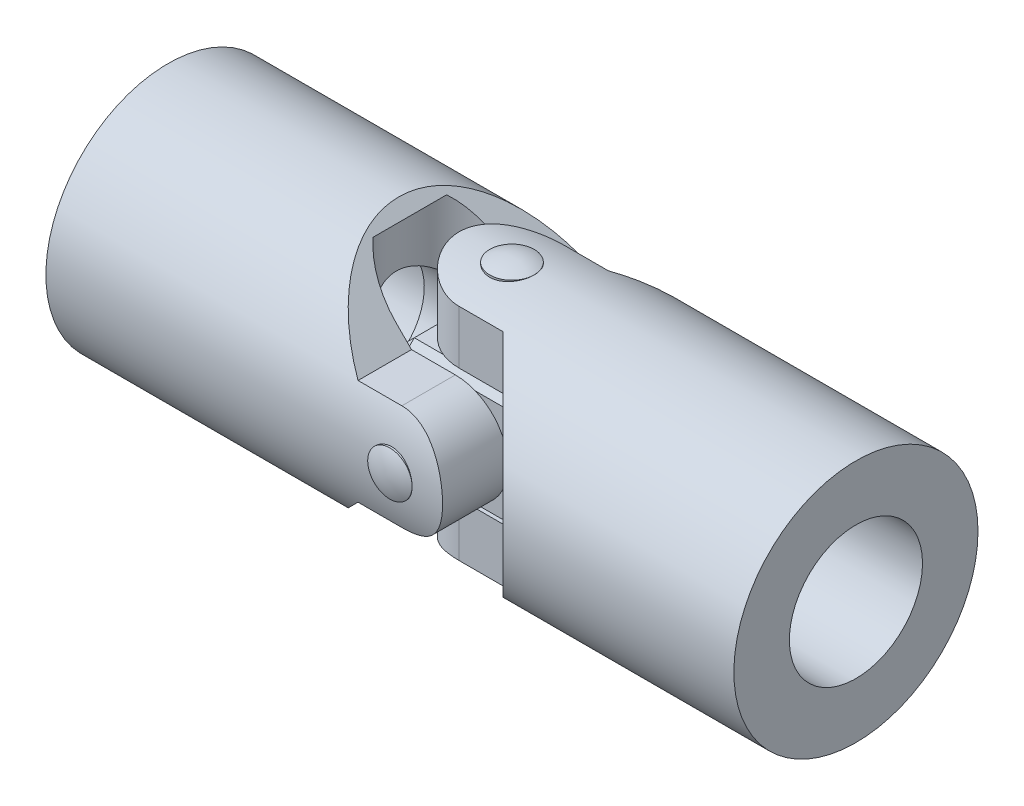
ISO-10303-21;
HEADER;
FILE_DESCRIPTION(('STEP AP214'),'2;1');
FILE_NAME('part.step','',(''),(''),'','','');
FILE_SCHEMA(('AUTOMOTIVE_DESIGN { 1 0 10303 214 1 1 1 1 }'));
ENDSEC;
DATA;
#1=APPLICATION_CONTEXT('core data for automotive mechanical design processes');
#2=APPLICATION_PROTOCOL_DEFINITION('international standard','automotive_design',2000,#1);
#3=PRODUCT_CONTEXT('',#1,'mechanical');
#4=PRODUCT('Part','Part','',(#3));
#5=PRODUCT_RELATED_PRODUCT_CATEGORY('part','',(#4));
#6=PRODUCT_DEFINITION_FORMATION('','',#4);
#7=PRODUCT_DEFINITION_CONTEXT('part definition',#1,'design');
#8=PRODUCT_DEFINITION('design','',#6,#7);
#9=PRODUCT_DEFINITION_SHAPE('','',#8);
#10=(LENGTH_UNIT() NAMED_UNIT(*) SI_UNIT(.MILLI.,.METRE.));
#11=(NAMED_UNIT(*) PLANE_ANGLE_UNIT() SI_UNIT($,.RADIAN.));
#12=(NAMED_UNIT(*) SI_UNIT($,.STERADIAN.) SOLID_ANGLE_UNIT());
#13=UNCERTAINTY_MEASURE_WITH_UNIT(LENGTH_MEASURE(1.E-05),#10,'distance_accuracy_value','');
#14=(GEOMETRIC_REPRESENTATION_CONTEXT(3) GLOBAL_UNCERTAINTY_ASSIGNED_CONTEXT((#13)) GLOBAL_UNIT_ASSIGNED_CONTEXT((#10,
#11,#12)) REPRESENTATION_CONTEXT('',''));
#15=CARTESIAN_POINT('',(0.,0.,0.));
#16=DIRECTION('',(0.,0.,1.));
#17=DIRECTION('',(1.,0.,0.));
#18=AXIS2_PLACEMENT_3D('',#15,#16,#17);
#19=CARTESIAN_POINT('',(0.,11.,0.));
#20=DIRECTION('',(0.,-1.,0.));
#21=DIRECTION('',(-1.,0.,0.));
#22=AXIS2_PLACEMENT_3D('',#19,#20,#21);
#23=CYLINDRICAL_SURFACE('',#22,2.);
#24=CARTESIAN_POINT('',(0.,11.,0.));
#25=DIRECTION('',(0.,1.,0.));
#26=DIRECTION('',(1.,0.,0.));
#27=AXIS2_PLACEMENT_3D('',#24,#25,#26);
#28=CIRCLE('',#27,2.);
#29=CARTESIAN_POINT('',(2.,11.,0.));
#30=VERTEX_POINT('',#29);
#31=EDGE_CURVE('P0_E10',#30,#30,#28,.T.);
#32=ORIENTED_EDGE('',*,*,#31,.F.);
#33=EDGE_LOOP('',(#32));
#34=FACE_BOUND('',#33,.T.);
#35=CARTESIAN_POINT('',(0.,-11.,0.));
#36=DIRECTION('',(0.,1.,0.));
#37=DIRECTION('',(0.,0.,1.));
#38=AXIS2_PLACEMENT_3D('',#35,#36,#37);
#39=CIRCLE('',#38,2.);
#40=CARTESIAN_POINT('',(0.,-11.,2.));
#41=VERTEX_POINT('',#40);
#42=EDGE_CURVE('P0_E20',#41,#41,#39,.T.);
#43=ORIENTED_EDGE('',*,*,#42,.T.);
#44=EDGE_LOOP('',(#43));
#45=FACE_BOUND('',#44,.T.);
#46=ADVANCED_FACE('P0_F14',(#34,#45),#23,.T.);
#47=CARTESIAN_POINT('',(0.,6.69157801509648,0.));
#48=DIRECTION('',(0.,1.,0.));
#49=DIRECTION('',(0.,0.,-1.));
#50=AXIS2_PLACEMENT_3D('',#47,#48,#49);
#51=SPHERICAL_SURFACE('',#50,4.75);
#52=ORIENTED_EDGE('',*,*,#31,.T.);
#53=EDGE_LOOP('',(#52));
#54=FACE_BOUND('',#53,.T.);
#55=ADVANCED_FACE('P0_F29',(#54),#51,.T.);
#56=CARTESIAN_POINT('',(0.,-6.69157801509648,0.));
#57=DIRECTION('',(0.,-1.,0.));
#58=DIRECTION('',(0.,0.,-1.));
#59=AXIS2_PLACEMENT_3D('',#56,#57,#58);
#60=SPHERICAL_SURFACE('',#59,4.75);
#61=ORIENTED_EDGE('',*,*,#42,.F.);
#62=EDGE_LOOP('',(#61));
#63=FACE_BOUND('',#62,.T.);
#64=ADVANCED_FACE('P0_F27',(#63),#60,.T.);
#65=CLOSED_SHELL('',(#46,#55,#64));
#66=MANIFOLD_SOLID_BREP('P0_B1',#65);
#67=CARTESIAN_POINT('',(0.,0.,11.));
#68=DIRECTION('',(0.,0.,-1.));
#69=DIRECTION('',(-1.,0.,0.));
#70=AXIS2_PLACEMENT_3D('',#67,#68,#69);
#71=CYLINDRICAL_SURFACE('',#70,2.);
#72=CARTESIAN_POINT('',(0.,0.,11.));
#73=DIRECTION('',(0.,0.,1.));
#74=DIRECTION('',(1.,0.,0.));
#75=AXIS2_PLACEMENT_3D('',#72,#73,#74);
#76=CIRCLE('',#75,2.);
#77=CARTESIAN_POINT('',(2.,0.,11.));
#78=VERTEX_POINT('',#77);
#79=EDGE_CURVE('P1_E10',#78,#78,#76,.T.);
#80=ORIENTED_EDGE('',*,*,#79,.F.);
#81=EDGE_LOOP('',(#80));
#82=FACE_BOUND('',#81,.T.);
#83=CARTESIAN_POINT('',(0.,0.,-11.));
#84=DIRECTION('',(0.,0.,1.));
#85=DIRECTION('',(0.,-1.,0.));
#86=AXIS2_PLACEMENT_3D('',#83,#84,#85);
#87=CIRCLE('',#86,2.);
#88=CARTESIAN_POINT('',(0.,-2.,-11.));
#89=VERTEX_POINT('',#88);
#90=EDGE_CURVE('P1_E20',#89,#89,#87,.T.);
#91=ORIENTED_EDGE('',*,*,#90,.T.);
#92=EDGE_LOOP('',(#91));
#93=FACE_BOUND('',#92,.T.);
#94=ADVANCED_FACE('P1_F14',(#82,#93),#71,.T.);
#95=CARTESIAN_POINT('',(0.,0.,6.69157801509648));
#96=DIRECTION('',(0.,0.,1.));
#97=DIRECTION('',(0.,1.,0.));
#98=AXIS2_PLACEMENT_3D('',#95,#96,#97);
#99=SPHERICAL_SURFACE('',#98,4.75);
#100=ORIENTED_EDGE('',*,*,#79,.T.);
#101=EDGE_LOOP('',(#100));
#102=FACE_BOUND('',#101,.T.);
#103=ADVANCED_FACE('P1_F29',(#102),#99,.T.);
#104=CARTESIAN_POINT('',(0.,0.,-6.69157801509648));
#105=DIRECTION('',(0.,0.,-1.));
#106=DIRECTION('',(0.,1.,0.));
#107=AXIS2_PLACEMENT_3D('',#104,#105,#106);
#108=SPHERICAL_SURFACE('',#107,4.75);
#109=ORIENTED_EDGE('',*,*,#90,.F.);
#110=EDGE_LOOP('',(#109));
#111=FACE_BOUND('',#110,.T.);
#112=ADVANCED_FACE('P1_F27',(#111),#108,.T.);
#113=CLOSED_SHELL('',(#94,#103,#112));
#114=MANIFOLD_SOLID_BREP('P1_B1',#113);
#115=CARTESIAN_POINT('',(0.,0.,5.1));
#116=DIRECTION('',(0.,0.,-1.));
#117=DIRECTION('',(-1.,0.,0.));
#118=AXIS2_PLACEMENT_3D('',#115,#116,#117);
#119=CYLINDRICAL_SURFACE('',#118,2.);
#120=CARTESIAN_POINT('',(0.,0.,0.));
#121=DIRECTION('',(0.,0.707106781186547,-0.707106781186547));
#122=DIRECTION('',(0.,-0.707106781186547,-0.707106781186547));
#123=AXIS2_PLACEMENT_3D('',#120,#121,#122);
#124=ELLIPSE('',#123,2.82842712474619,2.);
#125=CARTESIAN_POINT('',(2.,0.,0.));
#126=VERTEX_POINT('',#125);
#127=CARTESIAN_POINT('',(-2.,0.,0.));
#128=VERTEX_POINT('',#127);
#129=EDGE_CURVE('P2_E116',#126,#128,#124,.F.);
#130=ORIENTED_EDGE('',*,*,#129,.F.);
#131=CARTESIAN_POINT('',(0.,0.,0.));
#132=DIRECTION('',(0.,-0.707106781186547,-0.707106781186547));
#133=DIRECTION('',(0.,0.707106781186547,-0.707106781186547));
#134=AXIS2_PLACEMENT_3D('',#131,#132,#133);
#135=ELLIPSE('',#134,2.82842712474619,2.);
#136=EDGE_CURVE('P2_E120',#128,#126,#135,.F.);
#137=ORIENTED_EDGE('',*,*,#136,.F.);
#138=EDGE_LOOP('',(#130,#137));
#139=FACE_BOUND('',#138,.T.);
#140=CARTESIAN_POINT('',(0.,0.,5.1));
#141=DIRECTION('',(0.,0.,1.));
#142=DIRECTION('',(1.,0.,0.));
#143=AXIS2_PLACEMENT_3D('',#140,#141,#142);
#144=CIRCLE('',#143,2.);
#145=CARTESIAN_POINT('',(2.,0.,5.1));
#146=VERTEX_POINT('',#145);
#147=EDGE_CURVE('P2_E127',#146,#146,#144,.T.);
#148=ORIENTED_EDGE('',*,*,#147,.T.);
#149=EDGE_LOOP('',(#148));
#150=FACE_BOUND('',#149,.T.);
#151=ADVANCED_FACE('P2_F16',(#139,#150),#119,.F.);
#152=CARTESIAN_POINT('',(5.1,5.1,5.1));
#153=DIRECTION('',(0.,0.,1.));
#154=DIRECTION('',(1.,0.,0.));
#155=AXIS2_PLACEMENT_3D('',#152,#153,#154);
#156=PLANE('',#155);
#157=DIRECTION('',(0.,-1.,0.));
#158=VECTOR('',#157,1.);
#159=CARTESIAN_POINT('',(-4.4,-5.1,5.1));
#160=LINE('',#159,#158);
#161=CARTESIAN_POINT('',(-4.4,4.4,5.1));
#162=VERTEX_POINT('',#161);
#163=CARTESIAN_POINT('',(-4.4,-4.4,5.1));
#164=VERTEX_POINT('',#163);
#165=EDGE_CURVE('P2_E164',#162,#164,#160,.T.);
#166=ORIENTED_EDGE('',*,*,#165,.T.);
#167=DIRECTION('',(1.,0.,0.));
#168=VECTOR('',#167,1.);
#169=CARTESIAN_POINT('',(5.1,-4.4,5.1));
#170=LINE('',#169,#168);
#171=CARTESIAN_POINT('',(4.4,-4.4,5.1));
#172=VERTEX_POINT('',#171);
#173=EDGE_CURVE('P2_E168',#164,#172,#170,.T.);
#174=ORIENTED_EDGE('',*,*,#173,.T.);
#175=DIRECTION('',(0.,1.,0.));
#176=VECTOR('',#175,1.);
#177=CARTESIAN_POINT('',(4.4,5.1,5.1));
#178=LINE('',#177,#176);
#179=CARTESIAN_POINT('',(4.4,4.4,5.1));
#180=VERTEX_POINT('',#179);
#181=EDGE_CURVE('P2_E166',#172,#180,#178,.T.);
#182=ORIENTED_EDGE('',*,*,#181,.T.);
#183=DIRECTION('',(-1.,0.,0.));
#184=VECTOR('',#183,1.);
#185=CARTESIAN_POINT('',(-5.1,4.4,5.1));
#186=LINE('',#185,#184);
#187=EDGE_CURVE('P2_E162',#180,#162,#186,.T.);
#188=ORIENTED_EDGE('',*,*,#187,.T.);
#189=EDGE_LOOP('',(#166,#174,#182,#188));
#190=FACE_BOUND('',#189,.T.);
#191=ORIENTED_EDGE('',*,*,#147,.F.);
#192=EDGE_LOOP('',(#191));
#193=FACE_BOUND('',#192,.T.);
#194=ADVANCED_FACE('P2_F282',(#190,#193),#156,.T.);
#195=CARTESIAN_POINT('',(5.1,5.1,-5.1));
#196=DIRECTION('',(0.,0.,1.));
#197=DIRECTION('',(1.,0.,0.));
#198=AXIS2_PLACEMENT_3D('',#195,#196,#197);
#199=PLANE('',#198);
#200=DIRECTION('',(-1.,0.,0.));
#201=VECTOR('',#200,1.);
#202=CARTESIAN_POINT('',(5.1,-4.4,-5.1));
#203=LINE('',#202,#201);
#204=CARTESIAN_POINT('',(4.4,-4.4,-5.1));
#205=VERTEX_POINT('',#204);
#206=CARTESIAN_POINT('',(-4.4,-4.4,-5.1));
#207=VERTEX_POINT('',#206);
#208=EDGE_CURVE('P2_E157',#205,#207,#203,.T.);
#209=ORIENTED_EDGE('',*,*,#208,.T.);
#210=DIRECTION('',(0.,1.,0.));
#211=VECTOR('',#210,1.);
#212=CARTESIAN_POINT('',(-4.4,5.1,-5.1));
#213=LINE('',#212,#211);
#214=CARTESIAN_POINT('',(-4.4,4.4,-5.1));
#215=VERTEX_POINT('',#214);
#216=EDGE_CURVE('P2_E159',#207,#215,#213,.T.);
#217=ORIENTED_EDGE('',*,*,#216,.T.);
#218=DIRECTION('',(1.,0.,0.));
#219=VECTOR('',#218,1.);
#220=CARTESIAN_POINT('',(5.1,4.4,-5.1));
#221=LINE('',#220,#219);
#222=CARTESIAN_POINT('',(4.4,4.4,-5.1));
#223=VERTEX_POINT('',#222);
#224=EDGE_CURVE('P2_E153',#215,#223,#221,.T.);
#225=ORIENTED_EDGE('',*,*,#224,.T.);
#226=DIRECTION('',(0.,-1.,0.));
#227=VECTOR('',#226,1.);
#228=CARTESIAN_POINT('',(4.4,5.1,-5.1));
#229=LINE('',#228,#227);
#230=EDGE_CURVE('P2_E155',#223,#205,#229,.T.);
#231=ORIENTED_EDGE('',*,*,#230,.T.);
#232=EDGE_LOOP('',(#209,#217,#225,#231));
#233=FACE_BOUND('',#232,.T.);
#234=CARTESIAN_POINT('',(0.,0.,-5.1));
#235=DIRECTION('',(0.,0.,1.));
#236=DIRECTION('',(1.,0.,0.));
#237=AXIS2_PLACEMENT_3D('',#234,#235,#236);
#238=CIRCLE('',#237,2.);
#239=CARTESIAN_POINT('',(2.,0.,-5.1));
#240=VERTEX_POINT('',#239);
#241=EDGE_CURVE('P2_E259',#240,#240,#238,.T.);
#242=ORIENTED_EDGE('',*,*,#241,.T.);
#243=EDGE_LOOP('',(#242));
#244=FACE_BOUND('',#243,.T.);
#245=ADVANCED_FACE('P2_F267',(#233,#244),#199,.F.);
#246=CARTESIAN_POINT('',(-5.1,5.1,5.1));
#247=DIRECTION('',(0.,-1.,0.));
#248=DIRECTION('',(0.,0.,-1.));
#249=AXIS2_PLACEMENT_3D('',#246,#247,#248);
#250=PLANE('',#249);
#251=DIRECTION('',(-1.,0.,0.));
#252=VECTOR('',#251,1.);
#253=CARTESIAN_POINT('',(-5.1,5.1,-4.4));
#254=LINE('',#253,#252);
#255=CARTESIAN_POINT('',(4.4,5.1,-4.4));
#256=VERTEX_POINT('',#255);
#257=CARTESIAN_POINT('',(-4.4,5.1,-4.4));
#258=VERTEX_POINT('',#257);
#259=EDGE_CURVE('P2_E25',#256,#258,#254,.T.);
#260=ORIENTED_EDGE('',*,*,#259,.T.);
#261=DIRECTION('',(0.,0.,1.));
#262=VECTOR('',#261,1.);
#263=CARTESIAN_POINT('',(-4.4,5.1,5.1));
#264=LINE('',#263,#262);
#265=CARTESIAN_POINT('',(-4.4,5.1,4.4));
#266=VERTEX_POINT('',#265);
#267=EDGE_CURVE('P2_E11',#258,#266,#264,.T.);
#268=ORIENTED_EDGE('',*,*,#267,.T.);
#269=DIRECTION('',(1.,0.,0.));
#270=VECTOR('',#269,1.);
#271=CARTESIAN_POINT('',(5.1,5.1,4.4));
#272=LINE('',#271,#270);
#273=CARTESIAN_POINT('',(4.4,5.1,4.4));
#274=VERTEX_POINT('',#273);
#275=EDGE_CURVE('P2_E180',#266,#274,#272,.T.);
#276=ORIENTED_EDGE('',*,*,#275,.T.);
#277=DIRECTION('',(0.,0.,-1.));
#278=VECTOR('',#277,1.);
#279=CARTESIAN_POINT('',(4.4,5.1,5.1));
#280=LINE('',#279,#278);
#281=EDGE_CURVE('P2_E36',#274,#256,#280,.T.);
#282=ORIENTED_EDGE('',*,*,#281,.T.);
#283=EDGE_LOOP('',(#260,#268,#276,#282));
#284=FACE_BOUND('',#283,.T.);
#285=CARTESIAN_POINT('',(0.,5.1,0.));
#286=DIRECTION('',(0.,1.,0.));
#287=DIRECTION('',(0.,0.,1.));
#288=AXIS2_PLACEMENT_3D('',#285,#286,#287);
#289=CIRCLE('',#288,2.);
#290=CARTESIAN_POINT('',(0.,5.1,2.));
#291=VERTEX_POINT('',#290);
#292=EDGE_CURVE('P2_E249',#291,#291,#289,.T.);
#293=ORIENTED_EDGE('',*,*,#292,.F.);
#294=EDGE_LOOP('',(#293));
#295=FACE_BOUND('',#294,.T.);
#296=ADVANCED_FACE('P2_F290',(#284,#295),#250,.F.);
#297=CARTESIAN_POINT('',(-5.1,-5.1,5.1));
#298=DIRECTION('',(1.,0.,0.));
#299=DIRECTION('',(0.,0.,-1.));
#300=AXIS2_PLACEMENT_3D('',#297,#298,#299);
#301=PLANE('',#300);
#302=DIRECTION('',(0.,-1.,0.));
#303=VECTOR('',#302,1.);
#304=CARTESIAN_POINT('',(-5.1,-5.1,-4.4));
#305=LINE('',#304,#303);
#306=CARTESIAN_POINT('',(-5.1,4.4,-4.4));
#307=VERTEX_POINT('',#306);
#308=CARTESIAN_POINT('',(-5.1,-4.4,-4.4));
#309=VERTEX_POINT('',#308);
#310=EDGE_CURVE('P2_E148',#307,#309,#305,.T.);
#311=ORIENTED_EDGE('',*,*,#310,.T.);
#312=DIRECTION('',(0.,0.,1.));
#313=VECTOR('',#312,1.);
#314=CARTESIAN_POINT('',(-5.1,-4.4,5.1));
#315=LINE('',#314,#313);
#316=CARTESIAN_POINT('',(-5.1,-4.4,4.4));
#317=VERTEX_POINT('',#316);
#318=EDGE_CURVE('P2_E150',#309,#317,#315,.T.);
#319=ORIENTED_EDGE('',*,*,#318,.T.);
#320=DIRECTION('',(0.,1.,0.));
#321=VECTOR('',#320,1.);
#322=CARTESIAN_POINT('',(-5.1,5.1,4.4));
#323=LINE('',#322,#321);
#324=CARTESIAN_POINT('',(-5.1,4.4,4.4));
#325=VERTEX_POINT('',#324);
#326=EDGE_CURVE('P2_E146',#317,#325,#323,.T.);
#327=ORIENTED_EDGE('',*,*,#326,.T.);
#328=DIRECTION('',(0.,0.,-1.));
#329=VECTOR('',#328,1.);
#330=CARTESIAN_POINT('',(-5.1,4.4,5.1));
#331=LINE('',#330,#329);
#332=EDGE_CURVE('P2_E144',#325,#307,#331,.T.);
#333=ORIENTED_EDGE('',*,*,#332,.T.);
#334=EDGE_LOOP('',(#311,#319,#327,#333));
#335=FACE_BOUND('',#334,.T.);
#336=ADVANCED_FACE('P2_F297',(#335),#301,.F.);
#337=CARTESIAN_POINT('',(-5.1,-5.1,5.1));
#338=DIRECTION('',(0.,1.,0.));
#339=DIRECTION('',(0.,0.,1.));
#340=AXIS2_PLACEMENT_3D('',#337,#338,#339);
#341=PLANE('',#340);
#342=DIRECTION('',(-1.,0.,0.));
#343=VECTOR('',#342,1.);
#344=CARTESIAN_POINT('',(-5.1,-5.1,4.4));
#345=LINE('',#344,#343);
#346=CARTESIAN_POINT('',(4.4,-5.1,4.4));
#347=VERTEX_POINT('',#346);
#348=CARTESIAN_POINT('',(-4.4,-5.1,4.4));
#349=VERTEX_POINT('',#348);
#350=EDGE_CURVE('P2_E137',#347,#349,#345,.T.);
#351=ORIENTED_EDGE('',*,*,#350,.T.);
#352=DIRECTION('',(0.,0.,-1.));
#353=VECTOR('',#352,1.);
#354=CARTESIAN_POINT('',(-4.4,-5.1,5.1));
#355=LINE('',#354,#353);
#356=CARTESIAN_POINT('',(-4.4,-5.1,-4.4));
#357=VERTEX_POINT('',#356);
#358=EDGE_CURVE('P2_E141',#349,#357,#355,.T.);
#359=ORIENTED_EDGE('',*,*,#358,.T.);
#360=DIRECTION('',(1.,0.,0.));
#361=VECTOR('',#360,1.);
#362=CARTESIAN_POINT('',(-5.1,-5.1,-4.4));
#363=LINE('',#362,#361);
#364=CARTESIAN_POINT('',(4.4,-5.1,-4.4));
#365=VERTEX_POINT('',#364);
#366=EDGE_CURVE('P2_E139',#357,#365,#363,.T.);
#367=ORIENTED_EDGE('',*,*,#366,.T.);
#368=DIRECTION('',(0.,0.,1.));
#369=VECTOR('',#368,1.);
#370=CARTESIAN_POINT('',(4.4,-5.1,5.1));
#371=LINE('',#370,#369);
#372=EDGE_CURVE('P2_E130',#365,#347,#371,.T.);
#373=ORIENTED_EDGE('',*,*,#372,.T.);
#374=EDGE_LOOP('',(#351,#359,#367,#373));
#375=FACE_BOUND('',#374,.T.);
#376=CARTESIAN_POINT('',(0.,-5.1,0.));
#377=DIRECTION('',(0.,1.,0.));
#378=DIRECTION('',(0.,0.,1.));
#379=AXIS2_PLACEMENT_3D('',#376,#377,#378);
#380=CIRCLE('',#379,2.);
#381=CARTESIAN_POINT('',(0.,-5.1,2.));
#382=VERTEX_POINT('',#381);
#383=EDGE_CURVE('P2_E255',#382,#382,#380,.T.);
#384=ORIENTED_EDGE('',*,*,#383,.T.);
#385=EDGE_LOOP('',(#384));
#386=FACE_BOUND('',#385,.T.);
#387=ADVANCED_FACE('P2_F277',(#375,#386),#341,.F.);
#388=CARTESIAN_POINT('',(5.1,-5.1,5.1));
#389=DIRECTION('',(-1.,0.,0.));
#390=DIRECTION('',(0.,0.,1.));
#391=AXIS2_PLACEMENT_3D('',#388,#389,#390);
#392=PLANE('',#391);
#393=DIRECTION('',(0.,-1.,0.));
#394=VECTOR('',#393,1.);
#395=CARTESIAN_POINT('',(5.1,-5.1,4.4));
#396=LINE('',#395,#394);
#397=CARTESIAN_POINT('',(5.1,4.4,4.4));
#398=VERTEX_POINT('',#397);
#399=CARTESIAN_POINT('',(5.1,-4.4,4.4));
#400=VERTEX_POINT('',#399);
#401=EDGE_CURVE('P2_E173',#398,#400,#396,.T.);
#402=ORIENTED_EDGE('',*,*,#401,.T.);
#403=DIRECTION('',(0.,0.,-1.));
#404=VECTOR('',#403,1.);
#405=CARTESIAN_POINT('',(5.1,-4.4,5.1));
#406=LINE('',#405,#404);
#407=CARTESIAN_POINT('',(5.1,-4.4,-4.4));
#408=VERTEX_POINT('',#407);
#409=EDGE_CURVE('P2_E177',#400,#408,#406,.T.);
#410=ORIENTED_EDGE('',*,*,#409,.T.);
#411=DIRECTION('',(0.,1.,0.));
#412=VECTOR('',#411,1.);
#413=CARTESIAN_POINT('',(5.1,-5.1,-4.4));
#414=LINE('',#413,#412);
#415=CARTESIAN_POINT('',(5.1,4.4,-4.4));
#416=VERTEX_POINT('',#415);
#417=EDGE_CURVE('P2_E175',#408,#416,#414,.T.);
#418=ORIENTED_EDGE('',*,*,#417,.T.);
#419=DIRECTION('',(0.,0.,1.));
#420=VECTOR('',#419,1.);
#421=CARTESIAN_POINT('',(5.1,4.4,5.1));
#422=LINE('',#421,#420);
#423=EDGE_CURVE('P2_E171',#416,#398,#422,.T.);
#424=ORIENTED_EDGE('',*,*,#423,.T.);
#425=EDGE_LOOP('',(#402,#410,#418,#424));
#426=FACE_BOUND('',#425,.T.);
#427=ADVANCED_FACE('P2_F269',(#426),#392,.F.);
#428=CARTESIAN_POINT('',(0.,0.,0.));
#429=DIRECTION('',(0.,0.707106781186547,-0.707106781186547));
#430=DIRECTION('',(0.,-0.707106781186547,-0.707106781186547));
#431=AXIS2_PLACEMENT_3D('',#428,#429,#430);
#432=ELLIPSE('',#431,2.82842712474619,2.);
#433=EDGE_CURVE('P2_E119',#126,#128,#432,.T.);
#434=ORIENTED_EDGE('',*,*,#433,.F.);
#435=CARTESIAN_POINT('',(0.,0.,0.));
#436=DIRECTION('',(0.,-0.707106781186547,-0.707106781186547));
#437=DIRECTION('',(0.,0.707106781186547,-0.707106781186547));
#438=AXIS2_PLACEMENT_3D('',#435,#436,#437);
#439=ELLIPSE('',#438,2.82842712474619,2.);
#440=EDGE_CURVE('P2_E111',#128,#126,#439,.T.);
#441=ORIENTED_EDGE('',*,*,#440,.F.);
#442=EDGE_LOOP('',(#434,#441));
#443=FACE_BOUND('',#442,.T.);
#444=ORIENTED_EDGE('',*,*,#241,.F.);
#445=EDGE_LOOP('',(#444));
#446=FACE_BOUND('',#445,.T.);
#447=ADVANCED_FACE('P2_F132',(#443,#446),#119,.F.);
#448=CARTESIAN_POINT('',(0.,-5.1,0.));
#449=DIRECTION('',(0.,1.,0.));
#450=DIRECTION('',(0.,0.,1.));
#451=AXIS2_PLACEMENT_3D('',#448,#449,#450);
#452=CYLINDRICAL_SURFACE('',#451,2.);
#453=ORIENTED_EDGE('',*,*,#433,.T.);
#454=ORIENTED_EDGE('',*,*,#136,.T.);
#455=EDGE_LOOP('',(#453,#454));
#456=FACE_BOUND('',#455,.T.);
#457=ORIENTED_EDGE('',*,*,#383,.F.);
#458=EDGE_LOOP('',(#457));
#459=FACE_BOUND('',#458,.T.);
#460=ADVANCED_FACE('P2_F124',(#456,#459),#452,.F.);
#461=ORIENTED_EDGE('',*,*,#129,.T.);
#462=ORIENTED_EDGE('',*,*,#440,.T.);
#463=EDGE_LOOP('',(#461,#462));
#464=FACE_BOUND('',#463,.T.);
#465=ORIENTED_EDGE('',*,*,#292,.T.);
#466=EDGE_LOOP('',(#465));
#467=FACE_BOUND('',#466,.T.);
#468=ADVANCED_FACE('P2_F113',(#464,#467),#452,.F.);
#469=CARTESIAN_POINT('',(4.4,5.1,5.1));
#470=DIRECTION('',(-0.707106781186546,-0.707106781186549,0.));
#471=DIRECTION('',(0.707106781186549,-0.707106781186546,0.));
#472=AXIS2_PLACEMENT_3D('',#469,#470,#471);
#473=PLANE('',#472);
#474=DIRECTION('',(0.707106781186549,-0.707106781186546,0.));
#475=VECTOR('',#474,1.);
#476=CARTESIAN_POINT('',(4.75,4.75,4.4));
#477=LINE('',#476,#475);
#478=EDGE_CURVE('P2_E20',#398,#274,#477,.F.);
#479=ORIENTED_EDGE('',*,*,#478,.F.);
#480=ORIENTED_EDGE('',*,*,#423,.F.);
#481=DIRECTION('',(-0.707106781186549,0.707106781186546,0.));
#482=VECTOR('',#481,1.);
#483=CARTESIAN_POINT('',(5.1,4.4,-4.4));
#484=LINE('',#483,#482);
#485=EDGE_CURVE('P2_E243',#256,#416,#484,.F.);
#486=ORIENTED_EDGE('',*,*,#485,.F.);
#487=ORIENTED_EDGE('',*,*,#281,.F.);
#488=EDGE_LOOP('',(#479,#480,#486,#487));
#489=FACE_BOUND('',#488,.T.);
#490=ADVANCED_FACE('P2_F18',(#489),#473,.F.);
#491=CARTESIAN_POINT('',(4.4,4.4,5.1));
#492=DIRECTION('',(0.577350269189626,0.577350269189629,0.577350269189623));
#493=DIRECTION('',(-0.707106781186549,0.707106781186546,0.));
#494=AXIS2_PLACEMENT_3D('',#491,#492,#493);
#495=PLANE('',#494);
#496=DIRECTION('',(0.707106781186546,0.,-0.707106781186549));
#497=VECTOR('',#496,1.);
#498=CARTESIAN_POINT('',(4.4,4.4,5.1));
#499=LINE('',#498,#497);
#500=EDGE_CURVE('P2_E238',#398,#180,#499,.F.);
#501=ORIENTED_EDGE('',*,*,#500,.F.);
#502=ORIENTED_EDGE('',*,*,#478,.T.);
#503=DIRECTION('',(0.,-0.707106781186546,0.707106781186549));
#504=VECTOR('',#503,1.);
#505=CARTESIAN_POINT('',(4.4,4.4,5.1));
#506=LINE('',#505,#504);
#507=EDGE_CURVE('P2_E241',#180,#274,#506,.F.);
#508=ORIENTED_EDGE('',*,*,#507,.F.);
#509=EDGE_LOOP('',(#501,#502,#508));
#510=FACE_BOUND('',#509,.T.);
#511=ADVANCED_FACE('P2_F374',(#510),#495,.T.);
#512=CARTESIAN_POINT('',(5.1,4.4,-4.4));
#513=DIRECTION('',(0.577350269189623,0.577350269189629,-0.577350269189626));
#514=DIRECTION('',(0.,0.707106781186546,0.707106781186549));
#515=AXIS2_PLACEMENT_3D('',#512,#513,#514);
#516=PLANE('',#515);
#517=DIRECTION('',(0.,-0.707106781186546,-0.707106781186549));
#518=VECTOR('',#517,1.);
#519=CARTESIAN_POINT('',(4.4,4.75,-4.75));
#520=LINE('',#519,#518);
#521=EDGE_CURVE('P2_E232',#256,#223,#520,.T.);
#522=ORIENTED_EDGE('',*,*,#521,.F.);
#523=ORIENTED_EDGE('',*,*,#485,.T.);
#524=DIRECTION('',(0.707106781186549,0.,0.707106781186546));
#525=VECTOR('',#524,1.);
#526=CARTESIAN_POINT('',(5.1,4.4,-4.4));
#527=LINE('',#526,#525);
#528=EDGE_CURVE('P2_E235',#223,#416,#527,.T.);
#529=ORIENTED_EDGE('',*,*,#528,.F.);
#530=EDGE_LOOP('',(#522,#523,#529));
#531=FACE_BOUND('',#530,.T.);
#532=ADVANCED_FACE('P2_F371',(#531),#516,.T.);
#533=CARTESIAN_POINT('',(5.1,4.4,5.1));
#534=DIRECTION('',(0.,0.707106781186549,0.707106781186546));
#535=DIRECTION('',(0.,-0.707106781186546,0.707106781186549));
#536=AXIS2_PLACEMENT_3D('',#533,#534,#535);
#537=PLANE('',#536);
#538=ORIENTED_EDGE('',*,*,#507,.T.);
#539=ORIENTED_EDGE('',*,*,#275,.F.);
#540=DIRECTION('',(0.,0.707106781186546,-0.707106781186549));
#541=VECTOR('',#540,1.);
#542=CARTESIAN_POINT('',(-4.4,4.75,4.75));
#543=LINE('',#542,#541);
#544=EDGE_CURVE('P2_E227',#162,#266,#543,.T.);
#545=ORIENTED_EDGE('',*,*,#544,.F.);
#546=ORIENTED_EDGE('',*,*,#187,.F.);
#547=EDGE_LOOP('',(#538,#539,#545,#546));
#548=FACE_BOUND('',#547,.T.);
#549=ADVANCED_FACE('P2_F367',(#548),#537,.T.);
#550=CARTESIAN_POINT('',(4.4,5.1,5.1));
#551=DIRECTION('',(0.707106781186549,0.,0.707106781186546));
#552=DIRECTION('',(0.707106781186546,0.,-0.707106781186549));
#553=AXIS2_PLACEMENT_3D('',#550,#551,#552);
#554=PLANE('',#553);
#555=ORIENTED_EDGE('',*,*,#500,.T.);
#556=ORIENTED_EDGE('',*,*,#181,.F.);
#557=DIRECTION('',(-0.707106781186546,0.,0.707106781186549));
#558=VECTOR('',#557,1.);
#559=CARTESIAN_POINT('',(4.4,-4.4,5.1));
#560=LINE('',#559,#558);
#561=EDGE_CURVE('P2_E224',#400,#172,#560,.T.);
#562=ORIENTED_EDGE('',*,*,#561,.F.);
#563=ORIENTED_EDGE('',*,*,#401,.F.);
#564=EDGE_LOOP('',(#555,#556,#562,#563));
#565=FACE_BOUND('',#564,.T.);
#566=ADVANCED_FACE('P2_F363',(#565),#554,.T.);
#567=CARTESIAN_POINT('',(5.1,-4.4,5.1));
#568=DIRECTION('',(-0.707106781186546,0.707106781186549,0.));
#569=DIRECTION('',(-0.707106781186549,-0.707106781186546,0.));
#570=AXIS2_PLACEMENT_3D('',#567,#568,#569);
#571=PLANE('',#570);
#572=DIRECTION('',(0.707106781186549,0.707106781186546,0.));
#573=VECTOR('',#572,1.);
#574=CARTESIAN_POINT('',(4.4,-5.1,-4.4));
#575=LINE('',#574,#573);
#576=EDGE_CURVE('P2_E218',#408,#365,#575,.F.);
#577=ORIENTED_EDGE('',*,*,#576,.F.);
#578=ORIENTED_EDGE('',*,*,#409,.F.);
#579=DIRECTION('',(-0.707106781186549,-0.707106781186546,0.));
#580=VECTOR('',#579,1.);
#581=CARTESIAN_POINT('',(4.75,-4.75,4.4));
#582=LINE('',#581,#580);
#583=EDGE_CURVE('P2_E221',#347,#400,#582,.F.);
#584=ORIENTED_EDGE('',*,*,#583,.F.);
#585=ORIENTED_EDGE('',*,*,#372,.F.);
#586=EDGE_LOOP('',(#577,#578,#584,#585));
#587=FACE_BOUND('',#586,.T.);
#588=ADVANCED_FACE('P2_F359',(#587),#571,.F.);
#589=CARTESIAN_POINT('',(5.1,-5.1,-4.4));
#590=DIRECTION('',(-0.707106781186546,0.,0.707106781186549));
#591=DIRECTION('',(0.707106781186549,0.,0.707106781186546));
#592=AXIS2_PLACEMENT_3D('',#589,#590,#591);
#593=PLANE('',#592);
#594=ORIENTED_EDGE('',*,*,#528,.T.);
#595=ORIENTED_EDGE('',*,*,#417,.F.);
#596=DIRECTION('',(-0.707106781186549,0.,-0.707106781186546));
#597=VECTOR('',#596,1.);
#598=CARTESIAN_POINT('',(4.75,-4.4,-4.75));
#599=LINE('',#598,#597);
#600=EDGE_CURVE('P2_E216',#205,#408,#599,.F.);
#601=ORIENTED_EDGE('',*,*,#600,.F.);
#602=ORIENTED_EDGE('',*,*,#230,.F.);
#603=EDGE_LOOP('',(#594,#595,#601,#602));
#604=FACE_BOUND('',#603,.T.);
#605=ADVANCED_FACE('P2_F355',(#604),#593,.F.);
#606=CARTESIAN_POINT('',(-5.1,5.1,-4.4));
#607=DIRECTION('',(0.,-0.707106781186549,0.707106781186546));
#608=DIRECTION('',(0.,-0.707106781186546,-0.707106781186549));
#609=AXIS2_PLACEMENT_3D('',#606,#607,#608);
#610=PLANE('',#609);
#611=ORIENTED_EDGE('',*,*,#521,.T.);
#612=ORIENTED_EDGE('',*,*,#224,.F.);
#613=DIRECTION('',(0.,0.707106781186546,0.707106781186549));
#614=VECTOR('',#613,1.);
#615=CARTESIAN_POINT('',(-4.4,4.4,-5.1));
#616=LINE('',#615,#614);
#617=EDGE_CURVE('P2_E213',#258,#215,#616,.F.);
#618=ORIENTED_EDGE('',*,*,#617,.F.);
#619=ORIENTED_EDGE('',*,*,#259,.F.);
#620=EDGE_LOOP('',(#611,#612,#618,#619));
#621=FACE_BOUND('',#620,.T.);
#622=ADVANCED_FACE('P2_F351',(#621),#610,.F.);
#623=CARTESIAN_POINT('',(-5.1,4.4,5.1));
#624=DIRECTION('',(0.707106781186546,-0.707106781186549,0.));
#625=DIRECTION('',(0.707106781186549,0.707106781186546,0.));
#626=AXIS2_PLACEMENT_3D('',#623,#624,#625);
#627=PLANE('',#626);
#628=DIRECTION('',(0.707106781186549,0.707106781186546,0.));
#629=VECTOR('',#628,1.);
#630=CARTESIAN_POINT('',(-5.1,4.4,4.4));
#631=LINE('',#630,#629);
#632=EDGE_CURVE('P2_E229',#266,#325,#631,.F.);
#633=ORIENTED_EDGE('',*,*,#632,.F.);
#634=ORIENTED_EDGE('',*,*,#267,.F.);
#635=DIRECTION('',(-0.707106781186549,-0.707106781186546,0.));
#636=VECTOR('',#635,1.);
#637=CARTESIAN_POINT('',(-4.75,4.75,-4.4));
#638=LINE('',#637,#636);
#639=EDGE_CURVE('P2_E210',#307,#258,#638,.F.);
#640=ORIENTED_EDGE('',*,*,#639,.F.);
#641=ORIENTED_EDGE('',*,*,#332,.F.);
#642=EDGE_LOOP('',(#633,#634,#640,#641));
#643=FACE_BOUND('',#642,.T.);
#644=ADVANCED_FACE('P2_F347',(#643),#627,.F.);
#645=CARTESIAN_POINT('',(-5.1,4.4,4.4));
#646=DIRECTION('',(-0.577350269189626,0.577350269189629,0.577350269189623));
#647=DIRECTION('',(-0.707106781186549,-0.707106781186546,0.));
#648=AXIS2_PLACEMENT_3D('',#645,#646,#647);
#649=PLANE('',#648);
#650=ORIENTED_EDGE('',*,*,#544,.T.);
#651=ORIENTED_EDGE('',*,*,#632,.T.);
#652=DIRECTION('',(0.707106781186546,0.,0.707106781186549));
#653=VECTOR('',#652,1.);
#654=CARTESIAN_POINT('',(-5.1,4.4,4.4));
#655=LINE('',#654,#653);
#656=EDGE_CURVE('P2_E207',#162,#325,#655,.F.);
#657=ORIENTED_EDGE('',*,*,#656,.F.);
#658=EDGE_LOOP('',(#650,#651,#657));
#659=FACE_BOUND('',#658,.T.);
#660=ADVANCED_FACE('P2_F343',(#659),#649,.T.);
#661=CARTESIAN_POINT('',(4.4,-4.4,5.1));
#662=DIRECTION('',(0.577350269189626,-0.577350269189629,0.577350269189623));
#663=DIRECTION('',(0.707106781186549,0.707106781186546,0.));
#664=AXIS2_PLACEMENT_3D('',#661,#662,#663);
#665=PLANE('',#664);
#666=ORIENTED_EDGE('',*,*,#583,.T.);
#667=ORIENTED_EDGE('',*,*,#561,.T.);
#668=DIRECTION('',(0.,-0.707106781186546,-0.707106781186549));
#669=VECTOR('',#668,1.);
#670=CARTESIAN_POINT('',(4.4,-4.4,5.1));
#671=LINE('',#670,#669);
#672=EDGE_CURVE('P2_E205',#347,#172,#671,.F.);
#673=ORIENTED_EDGE('',*,*,#672,.F.);
#674=EDGE_LOOP('',(#666,#667,#673));
#675=FACE_BOUND('',#674,.T.);
#676=ADVANCED_FACE('P2_F339',(#675),#665,.T.);
#677=CARTESIAN_POINT('',(4.4,-5.1,-4.4));
#678=DIRECTION('',(0.577350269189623,-0.577350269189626,-0.577350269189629));
#679=DIRECTION('',(0.,0.707106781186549,-0.707106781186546));
#680=AXIS2_PLACEMENT_3D('',#677,#678,#679);
#681=PLANE('',#680);
#682=ORIENTED_EDGE('',*,*,#600,.T.);
#683=ORIENTED_EDGE('',*,*,#576,.T.);
#684=DIRECTION('',(0.,-0.707106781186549,0.707106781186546));
#685=VECTOR('',#684,1.);
#686=CARTESIAN_POINT('',(4.4,-5.1,-4.4));
#687=LINE('',#686,#685);
#688=EDGE_CURVE('P2_E202',#205,#365,#687,.T.);
#689=ORIENTED_EDGE('',*,*,#688,.F.);
#690=EDGE_LOOP('',(#682,#683,#689));
#691=FACE_BOUND('',#690,.T.);
#692=ADVANCED_FACE('P2_F335',(#691),#681,.T.);
#693=CARTESIAN_POINT('',(-4.4,4.4,-5.1));
#694=DIRECTION('',(-0.577350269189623,0.577350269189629,-0.577350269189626));
#695=DIRECTION('',(0.,0.707106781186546,0.707106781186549));
#696=AXIS2_PLACEMENT_3D('',#693,#694,#695);
#697=PLANE('',#696);
#698=ORIENTED_EDGE('',*,*,#639,.T.);
#699=ORIENTED_EDGE('',*,*,#617,.T.);
#700=DIRECTION('',(0.707106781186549,0.,-0.707106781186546));
#701=VECTOR('',#700,1.);
#702=CARTESIAN_POINT('',(-4.4,4.4,-5.1));
#703=LINE('',#702,#701);
#704=EDGE_CURVE('P2_E200',#307,#215,#703,.T.);
#705=ORIENTED_EDGE('',*,*,#704,.F.);
#706=EDGE_LOOP('',(#698,#699,#705));
#707=FACE_BOUND('',#706,.T.);
#708=ADVANCED_FACE('P2_F331',(#707),#697,.T.);
#709=CARTESIAN_POINT('',(-4.4,5.1,5.1));
#710=DIRECTION('',(-0.707106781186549,0.,0.707106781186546));
#711=DIRECTION('',(0.707106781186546,0.,0.707106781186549));
#712=AXIS2_PLACEMENT_3D('',#709,#710,#711);
#713=PLANE('',#712);
#714=ORIENTED_EDGE('',*,*,#656,.T.);
#715=ORIENTED_EDGE('',*,*,#326,.F.);
#716=DIRECTION('',(-0.707106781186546,0.,-0.707106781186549));
#717=VECTOR('',#716,1.);
#718=CARTESIAN_POINT('',(-5.1,-4.4,4.4));
#719=LINE('',#718,#717);
#720=EDGE_CURVE('P2_E197',#164,#317,#719,.T.);
#721=ORIENTED_EDGE('',*,*,#720,.F.);
#722=ORIENTED_EDGE('',*,*,#165,.F.);
#723=EDGE_LOOP('',(#714,#715,#721,#722));
#724=FACE_BOUND('',#723,.T.);
#725=ADVANCED_FACE('P2_F327',(#724),#713,.T.);
#726=CARTESIAN_POINT('',(5.1,-4.4,5.1));
#727=DIRECTION('',(0.,-0.707106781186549,0.707106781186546));
#728=DIRECTION('',(0.,-0.707106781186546,-0.707106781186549));
#729=AXIS2_PLACEMENT_3D('',#726,#727,#728);
#730=PLANE('',#729);
#731=ORIENTED_EDGE('',*,*,#672,.T.);
#732=ORIENTED_EDGE('',*,*,#173,.F.);
#733=DIRECTION('',(0.,0.707106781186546,0.707106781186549));
#734=VECTOR('',#733,1.);
#735=CARTESIAN_POINT('',(-4.4,-4.75,4.75));
#736=LINE('',#735,#734);
#737=EDGE_CURVE('P2_E194',#349,#164,#736,.T.);
#738=ORIENTED_EDGE('',*,*,#737,.F.);
#739=ORIENTED_EDGE('',*,*,#350,.F.);
#740=EDGE_LOOP('',(#731,#732,#738,#739));
#741=FACE_BOUND('',#740,.T.);
#742=ADVANCED_FACE('P2_F323',(#741),#730,.T.);
#743=CARTESIAN_POINT('',(-5.1,-5.1,-4.4));
#744=DIRECTION('',(0.,0.707106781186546,0.707106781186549));
#745=DIRECTION('',(0.,-0.707106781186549,0.707106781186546));
#746=AXIS2_PLACEMENT_3D('',#743,#744,#745);
#747=PLANE('',#746);
#748=ORIENTED_EDGE('',*,*,#688,.T.);
#749=ORIENTED_EDGE('',*,*,#366,.F.);
#750=DIRECTION('',(0.,0.707106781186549,-0.707106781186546));
#751=VECTOR('',#750,1.);
#752=CARTESIAN_POINT('',(-4.4,-5.1,-4.4));
#753=LINE('',#752,#751);
#754=EDGE_CURVE('P2_E191',#207,#357,#753,.F.);
#755=ORIENTED_EDGE('',*,*,#754,.F.);
#756=ORIENTED_EDGE('',*,*,#208,.F.);
#757=EDGE_LOOP('',(#748,#749,#755,#756));
#758=FACE_BOUND('',#757,.T.);
#759=ADVANCED_FACE('P2_F319',(#758),#747,.F.);
#760=CARTESIAN_POINT('',(-5.1,-5.1,-4.4));
#761=DIRECTION('',(0.707106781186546,0.,0.707106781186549));
#762=DIRECTION('',(0.707106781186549,0.,-0.707106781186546));
#763=AXIS2_PLACEMENT_3D('',#760,#761,#762);
#764=PLANE('',#763);
#765=ORIENTED_EDGE('',*,*,#704,.T.);
#766=ORIENTED_EDGE('',*,*,#216,.F.);
#767=DIRECTION('',(-0.707106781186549,0.,0.707106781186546));
#768=VECTOR('',#767,1.);
#769=CARTESIAN_POINT('',(-4.75,-4.4,-4.75));
#770=LINE('',#769,#768);
#771=EDGE_CURVE('P2_E188',#309,#207,#770,.F.);
#772=ORIENTED_EDGE('',*,*,#771,.F.);
#773=ORIENTED_EDGE('',*,*,#310,.F.);
#774=EDGE_LOOP('',(#765,#766,#772,#773));
#775=FACE_BOUND('',#774,.T.);
#776=ADVANCED_FACE('P2_F315',(#775),#764,.F.);
#777=CARTESIAN_POINT('',(-5.1,-4.4,4.4));
#778=DIRECTION('',(-0.577350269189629,-0.577350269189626,0.577350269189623));
#779=DIRECTION('',(0.707106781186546,-0.707106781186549,0.));
#780=AXIS2_PLACEMENT_3D('',#777,#778,#779);
#781=PLANE('',#780);
#782=ORIENTED_EDGE('',*,*,#737,.T.);
#783=ORIENTED_EDGE('',*,*,#720,.T.);
#784=DIRECTION('',(-0.707106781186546,0.707106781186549,0.));
#785=VECTOR('',#784,1.);
#786=CARTESIAN_POINT('',(-5.1,-4.4,4.4));
#787=LINE('',#786,#785);
#788=EDGE_CURVE('P2_E186',#349,#317,#787,.T.);
#789=ORIENTED_EDGE('',*,*,#788,.F.);
#790=EDGE_LOOP('',(#782,#783,#789));
#791=FACE_BOUND('',#790,.T.);
#792=ADVANCED_FACE('P2_F311',(#791),#781,.T.);
#793=CARTESIAN_POINT('',(-4.4,-5.1,-4.4));
#794=DIRECTION('',(-0.577350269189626,-0.577350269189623,-0.577350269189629));
#795=DIRECTION('',(-0.707106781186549,0.,0.707106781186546));
#796=AXIS2_PLACEMENT_3D('',#793,#794,#795);
#797=PLANE('',#796);
#798=ORIENTED_EDGE('',*,*,#771,.T.);
#799=ORIENTED_EDGE('',*,*,#754,.T.);
#800=DIRECTION('',(0.707106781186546,-0.707106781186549,0.));
#801=VECTOR('',#800,1.);
#802=CARTESIAN_POINT('',(-4.4,-5.1,-4.4));
#803=LINE('',#802,#801);
#804=EDGE_CURVE('P2_E184',#309,#357,#803,.T.);
#805=ORIENTED_EDGE('',*,*,#804,.F.);
#806=EDGE_LOOP('',(#798,#799,#805));
#807=FACE_BOUND('',#806,.T.);
#808=ADVANCED_FACE('P2_F307',(#807),#797,.T.);
#809=CARTESIAN_POINT('',(-4.4,-5.1,5.1));
#810=DIRECTION('',(0.707106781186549,0.707106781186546,0.));
#811=DIRECTION('',(-0.707106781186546,0.707106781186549,0.));
#812=AXIS2_PLACEMENT_3D('',#809,#810,#811);
#813=PLANE('',#812);
#814=ORIENTED_EDGE('',*,*,#788,.T.);
#815=ORIENTED_EDGE('',*,*,#318,.F.);
#816=ORIENTED_EDGE('',*,*,#804,.T.);
#817=ORIENTED_EDGE('',*,*,#358,.F.);
#818=EDGE_LOOP('',(#814,#815,#816,#817));
#819=FACE_BOUND('',#818,.T.);
#820=ADVANCED_FACE('P2_F304',(#819),#813,.F.);
#821=CLOSED_SHELL('',(#151,#194,#245,#296,#336,#387,#427,#447,#460,#468,#490,#511,#532,#549,
#566,#588,#605,#622,#644,#660,#676,#692,#708,#725,#742,#759,#776,#792,#808,#820));
#822=MANIFOLD_SOLID_BREP('P2_B1',#821);
#823=CARTESIAN_POINT('',(0.,0.,-11.));
#824=DIRECTION('',(0.,0.,1.));
#825=DIRECTION('',(0.,1.,0.));
#826=AXIS2_PLACEMENT_3D('',#823,#824,#825);
#827=CYLINDRICAL_SURFACE('',#826,2.);
#828=CARTESIAN_POINT('',(0.,0.,-5.1));
#829=DIRECTION('',(0.,0.,-1.));
#830=DIRECTION('',(-1.,0.,0.));
#831=AXIS2_PLACEMENT_3D('',#828,#829,#830);
#832=CIRCLE('',#831,2.);
#833=CARTESIAN_POINT('',(-2.,0.,-5.1));
#834=VERTEX_POINT('',#833);
#835=EDGE_CURVE('P3_E141',#834,#834,#832,.F.);
#836=ORIENTED_EDGE('',*,*,#835,.T.);
#837=EDGE_LOOP('',(#836));
#838=FACE_BOUND('',#837,.T.);
#839=CARTESIAN_POINT('',(2.,0.,-11.));
#840=CARTESIAN_POINT('',(1.99999568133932,0.11135727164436,-10.9999980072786));
#841=CARTESIAN_POINT('',(1.99066824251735,0.22277144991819,-10.9982915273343));
#842=CARTESIAN_POINT('',(1.95362653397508,0.442464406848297,-10.99164847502));
#843=CARTESIAN_POINT('',(1.92589635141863,0.550740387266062,-10.9867091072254));
#844=CARTESIAN_POINT('',(1.85292287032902,0.760947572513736,-10.9741532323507));
#845=CARTESIAN_POINT('',(1.80769496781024,0.862884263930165,-10.9665390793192));
#846=CARTESIAN_POINT('',(1.70105266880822,1.05771200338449,-10.949466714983));
#847=CARTESIAN_POINT('',(1.63963973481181,1.15060386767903,-10.9400086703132));
#848=CARTESIAN_POINT('',(1.5016340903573,1.32576444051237,-10.9201743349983));
#849=CARTESIAN_POINT('',(1.42489415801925,1.40791622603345,-10.9097897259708));
#850=CARTESIAN_POINT('',(1.25872964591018,1.55825357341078,-10.8893349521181));
#851=CARTESIAN_POINT('',(1.16930418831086,1.62643816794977,-10.8792648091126));
#852=CARTESIAN_POINT('',(0.979487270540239,1.74738695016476,-10.8604984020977));
#853=CARTESIAN_POINT('',(0.879019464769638,1.80003313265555,-10.851812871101));
#854=CARTESIAN_POINT('',(0.670481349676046,1.88765546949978,-10.836915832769));
#855=CARTESIAN_POINT('',(0.562411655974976,1.92263305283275,-10.8307041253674));
#856=CARTESIAN_POINT('',(0.342985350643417,1.97355197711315,-10.8215415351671));
#857=CARTESIAN_POINT('',(0.23167740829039,1.98969666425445,-10.8185558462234));
#858=CARTESIAN_POINT('',(0.00789559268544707,2.00312248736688,-10.8160783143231));
#859=CARTESIAN_POINT('',(-0.104578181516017,2.00040521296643,-10.8165861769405));
#860=CARTESIAN_POINT('',(-0.326031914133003,1.97634934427,-10.8210066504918));
#861=CARTESIAN_POINT('',(-0.435037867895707,1.95524117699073,-10.8248771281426));
#862=CARTESIAN_POINT('',(-0.647935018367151,1.89536523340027,-10.8355206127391));
#863=CARTESIAN_POINT('',(-0.751826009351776,1.85659674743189,-10.8422937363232));
#864=CARTESIAN_POINT('',(-0.952222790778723,1.76227297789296,-10.8580238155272));
#865=CARTESIAN_POINT('',(-1.04868344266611,1.70662390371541,-10.8669929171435));
#866=CARTESIAN_POINT('',(-1.23098473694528,1.58018503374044,-10.8860962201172));
#867=CARTESIAN_POINT('',(-1.31682436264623,1.50939379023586,-10.8962305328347));
#868=CARTESIAN_POINT('',(-1.47677899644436,1.35343399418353,-10.9167064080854));
#869=CARTESIAN_POINT('',(-1.5507016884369,1.26806817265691,-10.9270488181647));
#870=CARTESIAN_POINT('',(-1.68320513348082,1.08604454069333,-10.9466375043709));
#871=CARTESIAN_POINT('',(-1.74178574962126,0.989386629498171,-10.9558837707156));
#872=CARTESIAN_POINT('',(-1.84196738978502,0.787327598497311,-10.9722553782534));
#873=CARTESIAN_POINT('',(-1.88354926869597,0.681916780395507,-10.9793783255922));
#874=CARTESIAN_POINT('',(-1.9483631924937,0.465448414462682,-10.9906820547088));
#875=CARTESIAN_POINT('',(-1.97159706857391,0.35439143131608,-10.994863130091));
#876=CARTESIAN_POINT('',(-1.99878976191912,0.131438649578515,-10.9997719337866));
#877=CARTESIAN_POINT('',(-2.00301222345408,0.0195760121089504,-11.0005468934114));
#878=CARTESIAN_POINT('',(-1.99276820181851,-0.203257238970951,-10.998686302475));
#879=CARTESIAN_POINT('',(-1.97830257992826,-0.314227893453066,-10.9960509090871));
#880=CARTESIAN_POINT('',(-1.93131225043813,-0.531297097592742,-10.9876950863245));
#881=CARTESIAN_POINT('',(-1.89892013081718,-0.637425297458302,-10.9819973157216));
#882=CARTESIAN_POINT('',(-1.81713917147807,-0.842744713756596,-10.9681529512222));
#883=CARTESIAN_POINT('',(-1.76774923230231,-0.941935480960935,-10.9600061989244));
#884=CARTESIAN_POINT('',(-1.65278536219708,-1.13169524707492,-10.9420497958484));
#885=CARTESIAN_POINT('',(-1.58704931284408,-1.22216445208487,-10.932223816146));
#886=CARTESIAN_POINT('',(-1.44147962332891,-1.39088213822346,-10.9120428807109));
#887=CARTESIAN_POINT('',(-1.36164475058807,-1.46912954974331,-10.901687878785));
#888=CARTESIAN_POINT('',(-1.18895311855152,-1.61217737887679,-10.8814603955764));
#889=CARTESIAN_POINT('',(-1.09594669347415,-1.67679836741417,-10.8715955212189));
#890=CARTESIAN_POINT('',(-0.900243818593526,-1.78949986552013,-10.8536151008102));
#891=CARTESIAN_POINT('',(-0.79754771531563,-1.83758096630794,-10.8454994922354));
#892=CARTESIAN_POINT('',(-0.585849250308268,-1.91557945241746,-10.8319954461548));
#893=CARTESIAN_POINT('',(-0.476878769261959,-1.94558107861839,-10.8265943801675));
#894=CARTESIAN_POINT('',(-0.255337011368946,-1.98683040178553,-10.8191012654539));
#895=CARTESIAN_POINT('',(-0.142766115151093,-1.99808007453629,-10.8170088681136));
#896=CARTESIAN_POINT('',(0.0809853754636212,-2.00144313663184,-10.8163869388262));
#897=CARTESIAN_POINT('',(0.192161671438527,-1.99383937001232,-10.8178047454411));
#898=CARTESIAN_POINT('',(0.411623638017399,-1.96032846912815,-10.8239270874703));
#899=CARTESIAN_POINT('',(0.51990932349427,-1.93442142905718,-10.8286316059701));
#900=CARTESIAN_POINT('',(0.730376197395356,-1.86515567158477,-10.8407757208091));
#901=CARTESIAN_POINT('',(0.832567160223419,-1.82182581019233,-10.8482107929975));
#902=CARTESIAN_POINT('',(1.02827444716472,-1.71897473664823,-10.8649817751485));
#903=CARTESIAN_POINT('',(1.12179020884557,-1.65945247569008,-10.8743178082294));
#904=CARTESIAN_POINT('',(1.29891287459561,-1.524915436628,-10.8940032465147));
#905=CARTESIAN_POINT('',(1.38236156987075,-1.449694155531,-10.9043650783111));
#906=CARTESIAN_POINT('',(1.53554708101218,-1.28632651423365,-10.9248399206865));
#907=CARTESIAN_POINT('',(1.60528074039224,-1.19817718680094,-10.9349528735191));
#908=CARTESIAN_POINT('',(1.72960029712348,-1.01057118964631,-10.9538897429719));
#909=CARTESIAN_POINT('',(1.78405418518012,-0.911025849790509,-10.9627021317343));
#910=CARTESIAN_POINT('',(1.87537921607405,-0.704073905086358,-10.9779326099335));
#911=CARTESIAN_POINT('',(1.91226715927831,-0.596674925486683,-10.9843529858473));
#912=CARTESIAN_POINT('',(1.95977543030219,-0.407441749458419,-10.9927407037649));
#913=CARTESIAN_POINT('',(1.97483433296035,-0.326725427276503,-10.9954478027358));
#914=CARTESIAN_POINT('',(1.9949480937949,-0.164016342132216,-10.9990781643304));
#915=CARTESIAN_POINT('',(2.00000318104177,-0.0820236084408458,-11.0000014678));
#916=CARTESIAN_POINT('',(2.,0.,-11.));
#917=B_SPLINE_CURVE_WITH_KNOTS('',3,(#839,#840,#841,#842,#843,#844,#845,#846,#847,#848,#849,
#850,#851,#852,#853,#854,#855,#856,#857,#858,#859,#860,#861,#862,#863,#864,#865,#866,#867,#868,
#869,#870,#871,#872,#873,#874,#875,#876,#877,#878,#879,#880,#881,#882,#883,#884,#885,#886,#887,
#888,#889,#890,#891,#892,#893,#894,#895,#896,#897,#898,#899,#900,#901,#902,#903,#904,#905,#906,
#907,#908,#909,#910,#911,#912,#913,#914,#915,#916),.UNSPECIFIED.,.T.,.F.,(4,2,2,2,2,2,2,2,2,2,2,
2,2,2,2,2,2,2,2,2,2,2,2,2,2,2,2,2,2,2,2,2,2,2,2,2,2,2,4),(0.,0.333771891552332,
0.667832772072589,1.00160038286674,1.3353378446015,1.67245014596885,2.00958578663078,
2.3492195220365,2.6888257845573,3.02473021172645,3.36060633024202,3.69233367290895,
4.02407434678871,4.35769306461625,4.69134369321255,5.02993210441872,5.36852353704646,
5.70749527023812,6.04643316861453,6.38065600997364,6.71486344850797,7.0466314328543,
7.3784208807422,7.71364226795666,8.04889297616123,8.38831506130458,8.72772501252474,
9.06554101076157,9.40332141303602,9.73606509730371,10.0688070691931,10.4010002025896,
10.733214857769,11.0701111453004,11.4070848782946,11.7468860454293,12.0863615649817,
12.3322171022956,12.5780670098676),.UNSPECIFIED.);
#918=CARTESIAN_POINT('',(2.,0.,-11.));
#919=VERTEX_POINT('',#918);
#920=EDGE_CURVE('P3_E233',#919,#919,#917,.T.);
#921=ORIENTED_EDGE('',*,*,#920,.F.);
#922=EDGE_LOOP('',(#921));
#923=FACE_BOUND('',#922,.T.);
#924=ADVANCED_FACE('P3_F16',(#838,#923),#827,.F.);
#925=CARTESIAN_POINT('',(-3.9499999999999,4.75000000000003,-11.));
#926=DIRECTION('',(0.,-1.,0.));
#927=DIRECTION('',(1.,0.,0.));
#928=AXIS2_PLACEMENT_3D('',#925,#926,#927);
#929=PLANE('',#928);
#930=DIRECTION('',(0.,0.,1.));
#931=VECTOR('',#930,1.);
#932=CARTESIAN_POINT('',(0.,4.75,-11.));
#933=LINE('',#932,#931);
#934=CARTESIAN_POINT('',(0.,4.75,5.1));
#935=VERTEX_POINT('',#934);
#936=CARTESIAN_POINT('',(0.,4.75,9.92156741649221));
#937=VERTEX_POINT('',#936);
#938=EDGE_CURVE('P3_E190',#935,#937,#933,.T.);
#939=ORIENTED_EDGE('',*,*,#938,.F.);
#940=DIRECTION('',(-1.,0.,0.));
#941=VECTOR('',#940,1.);
#942=CARTESIAN_POINT('',(-3.9499999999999,4.75000000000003,5.1));
#943=LINE('',#942,#941);
#944=CARTESIAN_POINT('',(-3.9499999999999,4.75000000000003,5.1));
#945=VERTEX_POINT('',#944);
#946=EDGE_CURVE('P3_E167',#935,#945,#943,.T.);
#947=ORIENTED_EDGE('',*,*,#946,.T.);
#948=DIRECTION('',(0.,0.,1.));
#949=VECTOR('',#948,1.);
#950=CARTESIAN_POINT('',(-3.9499999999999,4.75000000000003,-11.));
#951=LINE('',#950,#949);
#952=CARTESIAN_POINT('',(-3.9499999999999,4.75000000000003,9.92156741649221));
#953=VERTEX_POINT('',#952);
#954=EDGE_CURVE('P3_E194',#945,#953,#951,.T.);
#955=ORIENTED_EDGE('',*,*,#954,.T.);
#956=DIRECTION('',(1.,0.,0.));
#957=VECTOR('',#956,1.);
#958=CARTESIAN_POINT('',(-31.,4.75000000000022,9.92156741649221));
#959=LINE('',#958,#957);
#960=EDGE_CURVE('P3_E250',#937,#953,#959,.F.);
#961=ORIENTED_EDGE('',*,*,#960,.F.);
#962=EDGE_LOOP('',(#939,#947,#955,#961));
#963=FACE_BOUND('',#962,.T.);
#964=ADVANCED_FACE('P3_F293',(#963),#929,.F.);
#965=CARTESIAN_POINT('',(0.,-4.75,-11.));
#966=DIRECTION('',(0.,1.,0.));
#967=DIRECTION('',(-1.,0.,0.));
#968=AXIS2_PLACEMENT_3D('',#965,#966,#967);
#969=PLANE('',#968);
#970=DIRECTION('',(0.,0.,1.));
#971=VECTOR('',#970,1.);
#972=CARTESIAN_POINT('',(0.,-4.75,-11.));
#973=LINE('',#972,#971);
#974=CARTESIAN_POINT('',(0.,-4.75,-9.92156741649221));
#975=VERTEX_POINT('',#974);
#976=CARTESIAN_POINT('',(0.,-4.75,-5.1));
#977=VERTEX_POINT('',#976);
#978=EDGE_CURVE('P3_E197',#975,#977,#973,.T.);
#979=ORIENTED_EDGE('',*,*,#978,.T.);
#980=DIRECTION('',(-1.,0.,0.));
#981=VECTOR('',#980,1.);
#982=CARTESIAN_POINT('',(0.,-4.75,-5.1));
#983=LINE('',#982,#981);
#984=CARTESIAN_POINT('',(-3.94999999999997,-4.74999999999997,-5.1));
#985=VERTEX_POINT('',#984);
#986=EDGE_CURVE('P3_E146',#977,#985,#983,.T.);
#987=ORIENTED_EDGE('',*,*,#986,.T.);
#988=DIRECTION('',(0.,0.,1.));
#989=VECTOR('',#988,1.);
#990=CARTESIAN_POINT('',(-3.94999999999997,-4.74999999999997,-11.));
#991=LINE('',#990,#989);
#992=CARTESIAN_POINT('',(-3.94999999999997,-4.74999999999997,-9.92156741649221));
#993=VERTEX_POINT('',#992);
#994=EDGE_CURVE('P3_E140',#993,#985,#991,.T.);
#995=ORIENTED_EDGE('',*,*,#994,.F.);
#996=DIRECTION('',(1.,0.,0.));
#997=VECTOR('',#996,1.);
#998=CARTESIAN_POINT('',(-31.,-4.74999999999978,-9.92156741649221));
#999=LINE('',#998,#997);
#1000=EDGE_CURVE('P3_E238',#975,#993,#999,.F.);
#1001=ORIENTED_EDGE('',*,*,#1000,.F.);
#1002=EDGE_LOOP('',(#979,#987,#995,#1001));
#1003=FACE_BOUND('',#1002,.T.);
#1004=ADVANCED_FACE('P3_F268',(#1003),#969,.F.);
#1005=CARTESIAN_POINT('',(0.,0.,-11.));
#1006=DIRECTION('',(0.,0.,1.));
#1007=DIRECTION('',(0.,1.,0.));
#1008=AXIS2_PLACEMENT_3D('',#1005,#1006,#1007);
#1009=CYLINDRICAL_SURFACE('',#1008,4.75);
#1010=CARTESIAN_POINT('',(0.,-4.75,5.1));
#1011=VERTEX_POINT('',#1010);
#1012=CARTESIAN_POINT('',(0.,-4.75,9.92156741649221));
#1013=VERTEX_POINT('',#1012);
#1014=EDGE_CURVE('P3_E184',#1011,#1013,#973,.T.);
#1015=ORIENTED_EDGE('',*,*,#1014,.F.);
#1016=CARTESIAN_POINT('',(0.,0.,5.1));
#1017=DIRECTION('',(0.,0.,1.));
#1018=DIRECTION('',(1.,0.,0.));
#1019=AXIS2_PLACEMENT_3D('',#1016,#1017,#1018);
#1020=CIRCLE('',#1019,4.75);
#1021=EDGE_CURVE('P3_E163',#1011,#935,#1020,.T.);
#1022=ORIENTED_EDGE('',*,*,#1021,.T.);
#1023=ORIENTED_EDGE('',*,*,#938,.T.);
#1024=CARTESIAN_POINT('',(0.,-4.75,9.92156741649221));
#1025=CARTESIAN_POINT('',(0.126798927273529,-4.75002107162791,9.92153753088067));
#1026=CARTESIAN_POINT('',(0.253584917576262,-4.74492372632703,9.92399720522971));
#1027=CARTESIAN_POINT('',(0.506111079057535,-4.72465187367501,9.93367480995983));
#1028=CARTESIAN_POINT('',(0.631851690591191,-4.70948185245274,9.9408906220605));
#1029=CARTESIAN_POINT('',(0.880825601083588,-4.66931378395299,9.95981772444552));
#1030=CARTESIAN_POINT('',(1.00406757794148,-4.64435984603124,9.97150883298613));
#1031=CARTESIAN_POINT('',(1.24776072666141,-4.58490173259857,9.99898767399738));
#1032=CARTESIAN_POINT('',(1.36821168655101,-4.55039683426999,10.0147757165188));
#1033=CARTESIAN_POINT('',(1.60535028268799,-4.47223744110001,10.0499214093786));
#1034=CARTESIAN_POINT('',(1.72204371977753,-4.42859791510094,10.0692732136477));
#1035=CARTESIAN_POINT('',(1.95121007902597,-4.33252110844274,10.1109843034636));
#1036=CARTESIAN_POINT('',(2.06368139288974,-4.28008051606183,10.13334472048));
#1037=CARTESIAN_POINT('',(2.39398414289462,-4.11006131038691,10.204041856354));
#1038=CARTESIAN_POINT('',(2.60467530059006,-3.97979493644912,10.2559899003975));
#1039=CARTESIAN_POINT('',(3.01448638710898,-3.6801826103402,10.3674149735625));
#1040=CARTESIAN_POINT('',(3.21214845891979,-3.50895760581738,10.4271569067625));
#1041=CARTESIAN_POINT('',(3.57711235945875,-3.13603580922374,10.5453027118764));
#1042=CARTESIAN_POINT('',(3.74440741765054,-2.93433224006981,10.6037062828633));
#1043=CARTESIAN_POINT('',(3.97281710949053,-2.60731546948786,10.6871628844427));
#1044=CARTESIAN_POINT('',(4.04658220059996,-2.49131196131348,10.7148636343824));
#1045=CARTESIAN_POINT('',(4.18400393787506,-2.25288995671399,10.767513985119));
#1046=CARTESIAN_POINT('',(4.24766474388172,-2.13047412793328,10.7924647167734));
#1047=CARTESIAN_POINT('',(4.36430255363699,-1.88001452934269,10.8389009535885));
#1048=CARTESIAN_POINT('',(4.41727879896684,-1.75197036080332,10.860386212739));
#1049=CARTESIAN_POINT('',(4.51197461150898,-1.49124309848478,10.8992453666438));
#1050=CARTESIAN_POINT('',(4.55369991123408,-1.35856240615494,10.9166213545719));
#1051=CARTESIAN_POINT('',(4.62347106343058,-1.0969601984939,10.9459142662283));
#1052=CARTESIAN_POINT('',(4.65214302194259,-0.968233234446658,10.9580788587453));
#1053=CARTESIAN_POINT('',(4.69870576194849,-0.708557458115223,10.9779274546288));
#1054=CARTESIAN_POINT('',(4.71660142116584,-0.577609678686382,10.9856134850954));
#1055=CARTESIAN_POINT('',(4.74141788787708,-0.314506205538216,10.9962911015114));
#1056=CARTESIAN_POINT('',(4.74834027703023,-0.182350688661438,10.999283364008));
#1057=CARTESIAN_POINT('',(4.75113071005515,0.0820961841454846,11.0004882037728));
#1058=CARTESIAN_POINT('',(4.74699922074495,0.214387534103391,10.9987009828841));
#1059=CARTESIAN_POINT('',(4.72836654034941,0.469365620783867,10.9906727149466));
#1060=CARTESIAN_POINT('',(4.71456283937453,0.592113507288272,10.9847312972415));
#1061=CARTESIAN_POINT('',(4.6774888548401,0.835949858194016,10.9688705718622));
#1062=CARTESIAN_POINT('',(4.65421545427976,0.957037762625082,10.9589499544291));
#1063=CARTESIAN_POINT('',(4.59843841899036,1.19665588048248,10.9353781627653));
#1064=CARTESIAN_POINT('',(4.5659380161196,1.31518697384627,10.9217282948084));
#1065=CARTESIAN_POINT('',(4.49201188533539,1.54899591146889,10.8910307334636));
#1066=CARTESIAN_POINT('',(4.45058275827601,1.66427249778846,10.8739817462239));
#1067=CARTESIAN_POINT('',(4.31203992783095,2.0075312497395,10.8177591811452));
#1068=CARTESIAN_POINT('',(4.20147976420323,2.22948637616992,10.773865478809));
#1069=CARTESIAN_POINT('',(3.94833615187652,2.65216300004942,10.6776962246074));
#1070=CARTESIAN_POINT('',(3.80574074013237,2.85287652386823,10.6254175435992));
#1071=CARTESIAN_POINT('',(3.48018581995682,3.2434838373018,10.5130450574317));
#1072=CARTESIAN_POINT('',(3.29500418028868,3.43144375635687,10.4526591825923));
#1073=CARTESIAN_POINT('',(2.89555508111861,3.77459371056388,10.3337071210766));
#1074=CARTESIAN_POINT('',(2.6812714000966,3.92976534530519,10.2751419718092));
#1075=CARTESIAN_POINT('',(2.33746049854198,4.13735154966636,10.192554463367));
#1076=CARTESIAN_POINT('',(2.21666504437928,4.2033211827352,10.1654528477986));
#1077=CARTESIAN_POINT('',(1.96928352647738,4.32474041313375,10.1143934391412));
#1078=CARTESIAN_POINT('',(1.84270002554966,4.38019461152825,10.0904342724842));
#1079=CARTESIAN_POINT('',(1.58474892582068,4.47997433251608,10.046531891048));
#1080=CARTESIAN_POINT('',(1.4533881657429,4.52431509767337,10.0265831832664));
#1081=CARTESIAN_POINT('',(1.1867665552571,4.60144969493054,9.99141913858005));
#1082=CARTESIAN_POINT('',(1.05150746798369,4.63424866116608,9.97620169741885));
#1083=CARTESIAN_POINT('',(0.76464226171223,4.6905453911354,9.94986734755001));
#1084=CARTESIAN_POINT('',(0.612737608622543,4.71280978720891,9.93930152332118));
#1085=CARTESIAN_POINT('',(0.383629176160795,4.73510607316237,9.92868713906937));
#1086=CARTESIAN_POINT('',(0.307041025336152,4.74068812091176,9.92602139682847));
#1087=CARTESIAN_POINT('',(0.153640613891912,4.74813543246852,9.92246034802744));
#1088=CARTESIAN_POINT('',(0.0768283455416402,4.75000056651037,9.92156510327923));
#1089=CARTESIAN_POINT('',(0.,4.75,9.92156741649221));
#1090=B_SPLINE_CURVE_WITH_KNOTS('',3,(#1024,#1025,#1026,#1027,#1028,#1029,#1030,#1031,#1032,
#1033,#1034,#1035,#1036,#1037,#1038,#1039,#1040,#1041,#1042,#1043,#1044,#1045,#1046,#1047,#1048,
#1049,#1050,#1051,#1052,#1053,#1054,#1055,#1056,#1057,#1058,#1059,#1060,#1061,#1062,#1063,#1064,
#1065,#1066,#1067,#1068,#1069,#1070,#1071,#1072,#1073,#1074,#1075,#1076,#1077,#1078,#1079,#1080,
#1081,#1082,#1083,#1084,#1085,#1086,#1087,#1088,#1089),.UNSPECIFIED.,.F.,.F.,(4,2,2,2,2,2,2,2,2,
2,2,2,2,2,2,2,2,2,2,2,2,2,2,2,2,2,2,2,2,2,2,2,4),(0.,0.380250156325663,0.760331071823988,
1.1387177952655,1.51713316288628,1.89493321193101,2.27287574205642,3.02885271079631,
3.83029272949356,4.63191121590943,5.0521651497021,5.47224561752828,5.89235589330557,
6.31225171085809,6.70905531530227,7.1056791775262,7.50224586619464,7.89879580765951,
8.26935175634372,8.64002977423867,9.01057811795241,9.38126777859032,10.1332229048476,
10.8854593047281,11.6939916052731,12.5029764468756,12.9233550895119,13.3435493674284,
13.763164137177,14.1825920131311,14.6433062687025,14.8737236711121,15.104149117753),.UNSPECIFIED.);
#1091=EDGE_CURVE('P3_E189',#1013,#937,#1090,.T.);
#1092=ORIENTED_EDGE('',*,*,#1091,.F.);
#1093=EDGE_LOOP('',(#1015,#1022,#1023,#1092));
#1094=FACE_BOUND('',#1093,.T.);
#1095=ADVANCED_FACE('P3_F218',(#1094),#1009,.T.);
#1096=CARTESIAN_POINT('',(-31.,2.16471968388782E-13,0.));
#1097=DIRECTION('',(1.,0.,0.));
#1098=DIRECTION('',(0.,1.,0.));
#1099=AXIS2_PLACEMENT_3D('',#1096,#1097,#1098);
#1100=CYLINDRICAL_SURFACE('',#1099,11.);
#1101=CARTESIAN_POINT('',(0.800000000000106,0.,0.));
#1102=DIRECTION('',(-0.707106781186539,0.707106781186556,0.));
#1103=DIRECTION('',(0.707106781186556,0.707106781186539,0.));
#1104=AXIS2_PLACEMENT_3D('',#1101,#1102,#1103);
#1105=ELLIPSE('',#1104,15.5563491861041,11.);
#1106=CARTESIAN_POINT('',(-3.94999999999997,-4.74999999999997,9.92156741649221));
#1107=VERTEX_POINT('',#1106);
#1108=EDGE_CURVE('P3_E241',#993,#1107,#1105,.T.);
#1109=ORIENTED_EDGE('',*,*,#1108,.T.);
#1110=DIRECTION('',(1.,0.,0.));
#1111=VECTOR('',#1110,1.);
#1112=CARTESIAN_POINT('',(-31.,-4.74999999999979,9.92156741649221));
#1113=LINE('',#1112,#1111);
#1114=EDGE_CURVE('P3_E253',#1107,#1013,#1113,.T.);
#1115=ORIENTED_EDGE('',*,*,#1114,.T.);
#1116=ORIENTED_EDGE('',*,*,#1091,.T.);
#1117=ORIENTED_EDGE('',*,*,#960,.T.);
#1118=CARTESIAN_POINT('',(0.80000000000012,0.,0.));
#1119=DIRECTION('',(-0.707106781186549,-0.707106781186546,0.));
#1120=DIRECTION('',(0.707106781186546,-0.707106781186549,0.));
#1121=AXIS2_PLACEMENT_3D('',#1118,#1119,#1120);
#1122=ELLIPSE('',#1121,15.5563491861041,11.);
#1123=CARTESIAN_POINT('',(-3.9499999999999,4.75000000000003,-9.92156741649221));
#1124=VERTEX_POINT('',#1123);
#1125=EDGE_CURVE('P3_E247',#953,#1124,#1122,.T.);
#1126=ORIENTED_EDGE('',*,*,#1125,.T.);
#1127=DIRECTION('',(1.,0.,0.));
#1128=VECTOR('',#1127,1.);
#1129=CARTESIAN_POINT('',(-31.,4.75000000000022,-9.92156741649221));
#1130=LINE('',#1129,#1128);
#1131=CARTESIAN_POINT('',(0.,4.75,-9.92156741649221));
#1132=VERTEX_POINT('',#1131);
#1133=EDGE_CURVE('P3_E244',#1124,#1132,#1130,.T.);
#1134=ORIENTED_EDGE('',*,*,#1133,.T.);
#1135=CARTESIAN_POINT('',(0.,4.75,-9.92156741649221));
#1136=CARTESIAN_POINT('',(0.126798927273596,4.75002107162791,-9.92153753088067));
#1137=CARTESIAN_POINT('',(0.253584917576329,4.74492372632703,-9.92399720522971));
#1138=CARTESIAN_POINT('',(0.506111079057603,4.72465187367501,-9.93367480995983));
#1139=CARTESIAN_POINT('',(0.631851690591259,4.70948185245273,-9.9408906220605));
#1140=CARTESIAN_POINT('',(0.880825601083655,4.66931378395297,-9.95981772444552));
#1141=CARTESIAN_POINT('',(1.00406757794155,4.64435984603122,-9.97150883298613));
#1142=CARTESIAN_POINT('',(1.24776072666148,4.58490173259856,-9.99898767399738));
#1143=CARTESIAN_POINT('',(1.36821168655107,4.55039683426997,-10.0147757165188));
#1144=CARTESIAN_POINT('',(1.60535028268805,4.47223744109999,-10.0499214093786));
#1145=CARTESIAN_POINT('',(1.72204371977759,4.42859791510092,-10.0692732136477));
#1146=CARTESIAN_POINT('',(1.95121007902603,4.33252110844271,-10.1109843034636));
#1147=CARTESIAN_POINT('',(2.0636813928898,4.2800805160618,-10.13334472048));
#1148=CARTESIAN_POINT('',(2.39398414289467,4.11006131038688,-10.204041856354));
#1149=CARTESIAN_POINT('',(2.60467530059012,3.97979493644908,-10.2559899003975));
#1150=CARTESIAN_POINT('',(3.01448638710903,3.68018261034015,-10.3674149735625));
#1151=CARTESIAN_POINT('',(3.21214845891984,3.50895760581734,-10.4271569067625));
#1152=CARTESIAN_POINT('',(3.57711235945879,3.13603580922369,-10.5453027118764));
#1153=CARTESIAN_POINT('',(3.74440741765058,2.93433224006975,-10.6037062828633));
#1154=CARTESIAN_POINT('',(3.97281710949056,2.6073154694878,-10.6871628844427));
#1155=CARTESIAN_POINT('',(4.0465822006,2.49131196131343,-10.7148636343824));
#1156=CARTESIAN_POINT('',(4.18400393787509,2.25288995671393,-10.767513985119));
#1157=CARTESIAN_POINT('',(4.24766474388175,2.13047412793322,-10.7924647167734));
#1158=CARTESIAN_POINT('',(4.36430255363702,1.88001452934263,-10.8389009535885));
#1159=CARTESIAN_POINT('',(4.41727879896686,1.75197036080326,-10.860386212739));
#1160=CARTESIAN_POINT('',(4.511974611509,1.49124309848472,-10.8992453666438));
#1161=CARTESIAN_POINT('',(4.5536999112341,1.35856240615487,-10.9166213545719));
#1162=CARTESIAN_POINT('',(4.62347106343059,1.09696019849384,-10.9459142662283));
#1163=CARTESIAN_POINT('',(4.65214302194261,0.968233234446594,-10.9580788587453));
#1164=CARTESIAN_POINT('',(4.6987057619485,0.708557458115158,-10.9779274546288));
#1165=CARTESIAN_POINT('',(4.71660142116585,0.577609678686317,-10.9856134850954));
#1166=CARTESIAN_POINT('',(4.74141788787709,0.314506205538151,-10.9962911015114));
#1167=CARTESIAN_POINT('',(4.74834027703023,0.182350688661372,-10.999283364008));
#1168=CARTESIAN_POINT('',(4.75113071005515,-0.0820961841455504,-11.0004882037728));
#1169=CARTESIAN_POINT('',(4.74699922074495,-0.214387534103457,-10.9987009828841));
#1170=CARTESIAN_POINT('',(4.7283665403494,-0.469365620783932,-10.9906727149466));
#1171=CARTESIAN_POINT('',(4.71456283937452,-0.592113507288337,-10.9847312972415));
#1172=CARTESIAN_POINT('',(4.67748885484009,-0.835949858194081,-10.9688705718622));
#1173=CARTESIAN_POINT('',(4.65421545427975,-0.957037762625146,-10.9589499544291));
#1174=CARTESIAN_POINT('',(4.59843841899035,-1.19665588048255,-10.9353781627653));
#1175=CARTESIAN_POINT('',(4.56593801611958,-1.31518697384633,-10.9217282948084));
#1176=CARTESIAN_POINT('',(4.49201188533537,-1.54899591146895,-10.8910307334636));
#1177=CARTESIAN_POINT('',(4.45058275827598,-1.66427249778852,-10.8739817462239));
#1178=CARTESIAN_POINT('',(4.31203992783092,-2.00753124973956,-10.8177591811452));
#1179=CARTESIAN_POINT('',(4.2014797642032,-2.22948637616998,-10.773865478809));
#1180=CARTESIAN_POINT('',(3.94833615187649,-2.65216300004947,-10.6776962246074));
#1181=CARTESIAN_POINT('',(3.80574074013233,-2.85287652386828,-10.6254175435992));
#1182=CARTESIAN_POINT('',(3.48018581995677,-3.24348383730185,-10.5130450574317));
#1183=CARTESIAN_POINT('',(3.29500418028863,-3.43144375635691,-10.4526591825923));
#1184=CARTESIAN_POINT('',(2.89555508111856,-3.77459371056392,-10.3337071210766));
#1185=CARTESIAN_POINT('',(2.68127140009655,-3.92976534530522,-10.2751419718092));
#1186=CARTESIAN_POINT('',(2.33746049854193,-4.13735154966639,-10.192554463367));
#1187=CARTESIAN_POINT('',(2.21666504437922,-4.20332118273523,-10.1654528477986));
#1188=CARTESIAN_POINT('',(1.96928352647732,-4.32474041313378,-10.1143934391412));
#1189=CARTESIAN_POINT('',(1.8427000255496,-4.38019461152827,-10.0904342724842));
#1190=CARTESIAN_POINT('',(1.58474892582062,-4.4799743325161,-10.046531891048));
#1191=CARTESIAN_POINT('',(1.45338816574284,-4.52431509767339,-10.0265831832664));
#1192=CARTESIAN_POINT('',(1.18676655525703,-4.60144969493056,-9.99141913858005));
#1193=CARTESIAN_POINT('',(1.05150746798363,-4.63424866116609,-9.97620169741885));
#1194=CARTESIAN_POINT('',(0.764642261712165,-4.69054539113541,-9.94986734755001));
#1195=CARTESIAN_POINT('',(0.612737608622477,-4.71280978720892,-9.93930152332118));
#1196=CARTESIAN_POINT('',(0.383629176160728,-4.73510607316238,-9.92868713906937));
#1197=CARTESIAN_POINT('',(0.307041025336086,-4.74068812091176,-9.92602139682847));
#1198=CARTESIAN_POINT('',(0.153640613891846,-4.74813543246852,-9.92246034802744));
#1199=CARTESIAN_POINT('',(0.0768283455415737,-4.75000056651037,-9.92156510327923));
#1200=CARTESIAN_POINT('',(0.,-4.75,-9.92156741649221));
#1201=B_SPLINE_CURVE_WITH_KNOTS('',3,(#1135,#1136,#1137,#1138,#1139,#1140,#1141,#1142,#1143,
#1144,#1145,#1146,#1147,#1148,#1149,#1150,#1151,#1152,#1153,#1154,#1155,#1156,#1157,#1158,#1159,
#1160,#1161,#1162,#1163,#1164,#1165,#1166,#1167,#1168,#1169,#1170,#1171,#1172,#1173,#1174,#1175,
#1176,#1177,#1178,#1179,#1180,#1181,#1182,#1183,#1184,#1185,#1186,#1187,#1188,#1189,#1190,#1191,
#1192,#1193,#1194,#1195,#1196,#1197,#1198,#1199,#1200),.UNSPECIFIED.,.F.,.F.,(4,2,2,2,2,2,2,2,2,
2,2,2,2,2,2,2,2,2,2,2,2,2,2,2,2,2,2,2,2,2,2,2,4),(0.,0.380250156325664,0.760331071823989,
1.1387177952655,1.51713316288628,1.89493321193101,2.27287574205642,3.02885271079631,
3.83029272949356,4.63191121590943,5.0521651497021,5.47224561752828,5.89235589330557,
6.31225171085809,6.70905531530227,7.1056791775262,7.50224586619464,7.89879580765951,
8.26935175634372,8.64002977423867,9.01057811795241,9.38126777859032,10.1332229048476,
10.8854593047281,11.6939916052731,12.5029764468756,12.9233550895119,13.3435493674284,
13.763164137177,14.1825920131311,14.6433062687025,14.8737236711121,15.104149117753),.UNSPECIFIED.);
#1202=EDGE_CURVE('P3_E206',#1132,#975,#1201,.T.);
#1203=ORIENTED_EDGE('',*,*,#1202,.T.);
#1204=ORIENTED_EDGE('',*,*,#1000,.T.);
#1205=EDGE_LOOP('',(#1109,#1115,#1116,#1117,#1126,#1134,#1203,#1204));
#1206=FACE_BOUND('',#1205,.T.);
#1207=ORIENTED_EDGE('',*,*,#920,.T.);
#1208=EDGE_LOOP('',(#1207));
#1209=FACE_BOUND('',#1208,.T.);
#1210=CARTESIAN_POINT('',(0.,2.,10.816653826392));
#1211=CARTESIAN_POINT('',(0.111340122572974,1.99999566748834,10.8166559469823));
#1212=CARTESIAN_POINT('',(0.222737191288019,1.9906710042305,10.818391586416));
#1213=CARTESIAN_POINT('',(0.442394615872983,1.953641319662,10.825138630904));
#1214=CARTESIAN_POINT('',(0.550652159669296,1.92592032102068,10.8301528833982));
#1215=CARTESIAN_POINT('',(0.760820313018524,1.85297369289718,10.8428709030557));
#1216=CARTESIAN_POINT('',(0.862736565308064,1.80776389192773,10.8505722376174));
#1217=CARTESIAN_POINT('',(1.05752989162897,1.70116425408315,10.8677937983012));
#1218=CARTESIAN_POINT('',(1.15040775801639,1.63977583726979,10.8773138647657));
#1219=CARTESIAN_POINT('',(1.32558344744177,1.50179524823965,10.8972247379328));
#1220=CARTESIAN_POINT('',(1.40776007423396,1.42505035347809,10.9076236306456));
#1221=CARTESIAN_POINT('',(1.55814556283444,1.2588653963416,10.9280489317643));
#1222=CARTESIAN_POINT('',(1.62635353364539,1.16942452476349,10.9380753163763));
#1223=CARTESIAN_POINT('',(1.74732731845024,0.979593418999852,10.9567122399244));
#1224=CARTESIAN_POINT('',(1.79997926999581,0.879129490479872,10.965312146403));
#1225=CARTESIAN_POINT('',(1.88761333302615,0.670599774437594,10.9800367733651));
#1226=CARTESIAN_POINT('',(1.92259681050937,0.562534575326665,10.98616168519));
#1227=CARTESIAN_POINT('',(1.97352723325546,0.343124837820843,10.9951891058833));
#1228=CARTESIAN_POINT('',(1.98967831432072,0.231829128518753,10.9981261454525));
#1229=CARTESIAN_POINT('',(2.0031211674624,0.00807147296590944,11.0005658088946));
#1230=CARTESIAN_POINT('',(2.00041445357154,-0.104390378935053,11.0000687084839));
#1231=CARTESIAN_POINT('',(1.97637585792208,-0.325889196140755,10.9957231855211));
#1232=CARTESIAN_POINT('',(1.95526374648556,-0.434950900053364,10.9919143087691));
#1233=CARTESIAN_POINT('',(1.89536080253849,-0.64795749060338,10.9814174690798));
#1234=CARTESIAN_POINT('',(1.85656935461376,-0.751902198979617,10.974729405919));
#1235=CARTESIAN_POINT('',(1.76219694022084,-0.95236622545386,10.9591592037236));
#1236=CARTESIAN_POINT('',(1.70652735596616,-1.04884289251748,10.9502655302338));
#1237=CARTESIAN_POINT('',(1.58004411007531,-1.23116763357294,10.9312689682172));
#1238=CARTESIAN_POINT('',(1.5092289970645,-1.31701468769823,10.9211659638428));
#1239=CARTESIAN_POINT('',(1.35325154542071,-1.47694445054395,10.9006990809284));
#1240=CARTESIAN_POINT('',(1.267896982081,-1.5508395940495,10.8903335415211));
#1241=CARTESIAN_POINT('',(1.08590593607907,-1.68329271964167,10.8706496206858));
#1242=CARTESIAN_POINT('',(0.98926930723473,-1.74185050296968,10.861331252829));
#1243=CARTESIAN_POINT('',(0.787217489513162,-1.84201538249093,10.8447947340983));
#1244=CARTESIAN_POINT('',(0.681789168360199,-1.88359655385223,10.8375798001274));
#1245=CARTESIAN_POINT('',(0.465282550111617,-1.94840376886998,10.8261173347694));
#1246=CARTESIAN_POINT('',(0.354204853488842,-1.97163175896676,10.8218694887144));
#1247=CARTESIAN_POINT('',(0.131240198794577,-1.99880217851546,10.8168840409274));
#1248=CARTESIAN_POINT('',(0.0193870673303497,-2.00301348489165,10.8160975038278));
#1249=CARTESIAN_POINT('',(-0.203424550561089,-1.99275054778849,10.8179929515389));
#1250=CARTESIAN_POINT('',(-0.314383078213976,-1.97827717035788,10.8206747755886));
#1251=CARTESIAN_POINT('',(-0.531380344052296,-1.93128609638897,10.8291592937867));
#1252=CARTESIAN_POINT('',(-0.637450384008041,-1.89890818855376,10.8349378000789));
#1253=CARTESIAN_POINT('',(-0.842659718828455,-1.81717497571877,10.8489439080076));
#1254=CARTESIAN_POINT('',(-0.94179852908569,-1.76781848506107,10.8571716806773));
#1255=CARTESIAN_POINT('',(-1.13151919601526,-1.65290586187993,10.8752613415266));
#1256=CARTESIAN_POINT('',(-1.22199611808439,-1.58717917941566,10.8851400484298));
#1257=CARTESIAN_POINT('',(-1.39073369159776,-1.44162304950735,10.9053706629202));
#1258=CARTESIAN_POINT('',(-1.46899331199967,-1.36179241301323,10.91572261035));
#1259=CARTESIAN_POINT('',(-1.61207284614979,-1.1890963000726,10.9358898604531));
#1260=CARTESIAN_POINT('',(-1.67671235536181,-1.09608023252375,10.9456968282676));
#1261=CARTESIAN_POINT('',(-1.789446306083,-0.900352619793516,10.9635308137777));
#1262=CARTESIAN_POINT('',(-1.83754135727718,-0.797641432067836,10.9715578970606));
#1263=CARTESIAN_POINT('',(-1.91554803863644,-0.58594821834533,10.9848917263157));
#1264=CARTESIAN_POINT('',(-1.94554990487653,-0.477000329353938,10.9902119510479));
#1265=CARTESIAN_POINT('',(-1.98680734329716,-0.255506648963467,10.9975899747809));
#1266=CARTESIAN_POINT('',(-1.99806476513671,-0.142961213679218,10.9996480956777));
#1267=CARTESIAN_POINT('',(-2.00145252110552,0.0807996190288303,11.0002641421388));
#1268=CARTESIAN_POINT('',(-1.99385588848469,0.192010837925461,10.9988720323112));
#1269=CARTESIAN_POINT('',(-1.96034705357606,0.41154453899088,10.9928473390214));
#1270=CARTESIAN_POINT('',(-1.93443500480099,0.51986704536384,10.9882147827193));
#1271=CARTESIAN_POINT('',(-1.86514309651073,0.730415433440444,10.9762290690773));
#1272=CARTESIAN_POINT('',(-1.82179065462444,0.832650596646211,10.96888018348));
#1273=CARTESIAN_POINT('',(-1.71888059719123,1.02843701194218,10.9522592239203));
#1274=CARTESIAN_POINT('',(-1.65932198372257,1.12198772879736,10.9429870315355));
#1275=CARTESIAN_POINT('',(-1.5247423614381,1.2991145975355,10.9233859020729));
#1276=CARTESIAN_POINT('',(-1.44952330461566,1.3825388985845,10.9130443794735));
#1277=CARTESIAN_POINT('',(-1.28617048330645,1.53567622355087,10.8925517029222));
#1278=CARTESIAN_POINT('',(-1.19803369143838,1.6053860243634,10.8824005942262));
#1279=CARTESIAN_POINT('',(-1.01044032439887,1.72967671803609,10.8633428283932));
#1280=CARTESIAN_POINT('',(-0.910892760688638,1.78412208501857,10.8544476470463));
#1281=CARTESIAN_POINT('',(-0.703936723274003,1.87543058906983,10.8390461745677));
#1282=CARTESIAN_POINT('',(-0.596535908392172,1.9123105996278,10.8325375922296));
#1283=CARTESIAN_POINT('',(-0.40732331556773,1.95979896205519,10.8240281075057));
#1284=CARTESIAN_POINT('',(-0.32663073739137,1.97484899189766,10.821278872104));
#1285=CARTESIAN_POINT('',(-0.163969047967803,1.99495098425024,10.8175909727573));
#1286=CARTESIAN_POINT('',(-0.0819999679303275,2.00000319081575,10.8166522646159));
#1287=CARTESIAN_POINT('',(0.,2.,10.816653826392));
#1288=B_SPLINE_CURVE_WITH_KNOTS('',3,(#1210,#1211,#1212,#1213,#1214,#1215,#1216,#1217,#1218,
#1219,#1220,#1221,#1222,#1223,#1224,#1225,#1226,#1227,#1228,#1229,#1230,#1231,#1232,#1233,#1234,
#1235,#1236,#1237,#1238,#1239,#1240,#1241,#1242,#1243,#1244,#1245,#1246,#1247,#1248,#1249,#1250,
#1251,#1252,#1253,#1254,#1255,#1256,#1257,#1258,#1259,#1260,#1261,#1262,#1263,#1264,#1265,#1266,
#1267,#1268,#1269,#1270,#1271,#1272,#1273,#1274,#1275,#1276,#1277,#1278,#1279,#1280,#1281,#1282,
#1283,#1284,#1285,#1286,#1287),.UNSPECIFIED.,.T.,.F.,(4,2,2,2,2,2,2,2,2,2,2,2,2,2,2,2,2,2,2,2,2,
2,2,2,2,2,2,2,2,2,2,2,2,2,2,2,2,2,4),(0.,0.333720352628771,0.667730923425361,1.00143989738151,
1.33511959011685,1.6722993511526,2.00950061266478,2.34911212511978,2.6886973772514,
3.02456639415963,3.3604084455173,3.69229445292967,4.02419201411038,4.35786328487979,
4.69156654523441,5.03008350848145,5.36860485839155,5.70764124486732,6.04664167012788,
6.38083364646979,6.71501013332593,7.04661365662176,7.37824034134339,7.71347820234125,
8.04874433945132,8.38820522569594,8.72765360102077,9.06539473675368,9.40310254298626,
9.73594847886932,10.0687916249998,10.4011135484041,10.7334559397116,11.0702887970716,
11.4072007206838,11.7470154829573,12.0865031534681,12.3322881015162,12.5780670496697),.UNSPECIFIED.);
#1289=CARTESIAN_POINT('',(0.,2.,10.816653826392));
#1290=VERTEX_POINT('',#1289);
#1291=EDGE_CURVE('P3_E229',#1290,#1290,#1288,.T.);
#1292=ORIENTED_EDGE('',*,*,#1291,.T.);
#1293=EDGE_LOOP('',(#1292));
#1294=FACE_BOUND('',#1293,.T.);
#1295=CARTESIAN_POINT('',(-31.,2.16471968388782E-13,0.));
#1296=DIRECTION('',(-1.,0.,0.));
#1297=DIRECTION('',(0.,-1.,0.));
#1298=AXIS2_PLACEMENT_3D('',#1295,#1296,#1297);
#1299=CIRCLE('',#1298,11.);
#1300=CARTESIAN_POINT('',(-31.0000000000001,-10.9999999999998,0.));
#1301=VERTEX_POINT('',#1300);
#1302=EDGE_CURVE('P3_E274',#1301,#1301,#1299,.T.);
#1303=ORIENTED_EDGE('',*,*,#1302,.F.);
#1304=EDGE_LOOP('',(#1303));
#1305=FACE_BOUND('',#1304,.T.);
#1306=ADVANCED_FACE('P3_F18',(#1206,#1209,#1294,#1305),#1100,.T.);
#1307=CARTESIAN_POINT('',(-31.,2.16471968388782E-13,0.));
#1308=DIRECTION('',(-1.,0.,0.));
#1309=DIRECTION('',(0.,-1.,0.));
#1310=AXIS2_PLACEMENT_3D('',#1307,#1308,#1309);
#1311=PLANE('',#1310);
#1312=CARTESIAN_POINT('',(-31.,2.16471968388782E-13,0.));
#1313=DIRECTION('',(-1.,0.,0.));
#1314=DIRECTION('',(0.,-1.,0.));
#1315=AXIS2_PLACEMENT_3D('',#1312,#1313,#1314);
#1316=CIRCLE('',#1315,6.);
#1317=CARTESIAN_POINT('',(-31.,-5.99999999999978,0.));
#1318=VERTEX_POINT('',#1317);
#1319=EDGE_CURVE('P3_E180',#1318,#1318,#1316,.T.);
#1320=ORIENTED_EDGE('',*,*,#1319,.F.);
#1321=EDGE_LOOP('',(#1320));
#1322=FACE_BOUND('',#1321,.T.);
#1323=ORIENTED_EDGE('',*,*,#1302,.T.);
#1324=EDGE_LOOP('',(#1323));
#1325=FACE_BOUND('',#1324,.T.);
#1326=ADVANCED_FACE('P3_F225',(#1322,#1325),#1311,.T.);
#1327=CARTESIAN_POINT('',(0.,0.,5.1));
#1328=DIRECTION('',(0.,0.,1.));
#1329=DIRECTION('',(1.,0.,0.));
#1330=AXIS2_PLACEMENT_3D('',#1327,#1328,#1329);
#1331=CIRCLE('',#1330,2.);
#1332=CARTESIAN_POINT('',(2.,0.,5.1));
#1333=VERTEX_POINT('',#1332);
#1334=EDGE_CURVE('P3_E159',#1333,#1333,#1331,.F.);
#1335=ORIENTED_EDGE('',*,*,#1334,.T.);
#1336=EDGE_LOOP('',(#1335));
#1337=FACE_BOUND('',#1336,.T.);
#1338=ORIENTED_EDGE('',*,*,#1291,.F.);
#1339=EDGE_LOOP('',(#1338));
#1340=FACE_BOUND('',#1339,.T.);
#1341=ADVANCED_FACE('P3_F220',(#1337,#1340),#827,.F.);
#1342=CARTESIAN_POINT('',(-3.9499999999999,4.75000000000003,-5.1));
#1343=VERTEX_POINT('',#1342);
#1344=EDGE_CURVE('P3_E191',#1124,#1343,#951,.T.);
#1345=ORIENTED_EDGE('',*,*,#1344,.T.);
#1346=DIRECTION('',(1.,0.,0.));
#1347=VECTOR('',#1346,1.);
#1348=CARTESIAN_POINT('',(-3.9499999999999,4.75000000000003,-5.1));
#1349=LINE('',#1348,#1347);
#1350=CARTESIAN_POINT('',(0.,4.75,-5.1));
#1351=VERTEX_POINT('',#1350);
#1352=EDGE_CURVE('P3_E143',#1343,#1351,#1349,.T.);
#1353=ORIENTED_EDGE('',*,*,#1352,.T.);
#1354=EDGE_CURVE('P3_E187',#1132,#1351,#933,.T.);
#1355=ORIENTED_EDGE('',*,*,#1354,.F.);
#1356=ORIENTED_EDGE('',*,*,#1133,.F.);
#1357=EDGE_LOOP('',(#1345,#1353,#1355,#1356));
#1358=FACE_BOUND('',#1357,.T.);
#1359=ADVANCED_FACE('P3_F224',(#1358),#929,.F.);
#1360=CARTESIAN_POINT('',(-10.1999999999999,11.0000000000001,-11.));
#1361=DIRECTION('',(-0.707106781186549,-0.707106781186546,0.));
#1362=DIRECTION('',(0.707106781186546,-0.707106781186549,0.));
#1363=AXIS2_PLACEMENT_3D('',#1360,#1361,#1362);
#1364=PLANE('',#1363);
#1365=CARTESIAN_POINT('',(-5.31999999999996,6.12000000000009,0.));
#1366=DIRECTION('',(-0.707106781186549,-0.707106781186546,0.));
#1367=DIRECTION('',(-0.707106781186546,0.707106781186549,0.));
#1368=AXIS2_PLACEMENT_3D('',#1365,#1366,#1367);
#1369=ELLIPSE('',#1368,7.21248916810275,5.1);
#1370=CARTESIAN_POINT('',(-9.19999999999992,10.0000000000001,-3.30992447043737));
#1371=VERTEX_POINT('',#1370);
#1372=CARTESIAN_POINT('',(-5.31999999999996,6.12000000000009,-5.1));
#1373=VERTEX_POINT('',#1372);
#1374=EDGE_CURVE('P3_E158',#1371,#1373,#1369,.T.);
#1375=ORIENTED_EDGE('',*,*,#1374,.T.);
#1376=DIRECTION('',(0.707106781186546,-0.707106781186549,0.));
#1377=VECTOR('',#1376,1.);
#1378=CARTESIAN_POINT('',(-10.1999999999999,11.0000000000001,-5.1));
#1379=LINE('',#1378,#1377);
#1380=EDGE_CURVE('P3_E152',#1373,#1343,#1379,.T.);
#1381=ORIENTED_EDGE('',*,*,#1380,.T.);
#1382=ORIENTED_EDGE('',*,*,#1344,.F.);
#1383=ORIENTED_EDGE('',*,*,#1125,.F.);
#1384=ORIENTED_EDGE('',*,*,#954,.F.);
#1385=DIRECTION('',(-0.707106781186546,0.707106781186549,0.));
#1386=VECTOR('',#1385,1.);
#1387=CARTESIAN_POINT('',(-10.1999999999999,11.0000000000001,5.1));
#1388=LINE('',#1387,#1386);
#1389=CARTESIAN_POINT('',(-5.31999999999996,6.12000000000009,5.1));
#1390=VERTEX_POINT('',#1389);
#1391=EDGE_CURVE('P3_E173',#945,#1390,#1388,.T.);
#1392=ORIENTED_EDGE('',*,*,#1391,.T.);
#1393=CARTESIAN_POINT('',(-9.19999999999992,10.0000000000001,3.30992447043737));
#1394=VERTEX_POINT('',#1393);
#1395=EDGE_CURVE('P3_E125',#1390,#1394,#1369,.T.);
#1396=ORIENTED_EDGE('',*,*,#1395,.T.);
#1397=DIRECTION('',(0.,0.,1.));
#1398=VECTOR('',#1397,1.);
#1399=CARTESIAN_POINT('',(-9.19999999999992,10.0000000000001,-11.));
#1400=LINE('',#1399,#1398);
#1401=EDGE_CURVE('P3_E11',#1371,#1394,#1400,.T.);
#1402=ORIENTED_EDGE('',*,*,#1401,.F.);
#1403=EDGE_LOOP('',(#1375,#1381,#1382,#1383,#1384,#1392,#1396,#1402));
#1404=FACE_BOUND('',#1403,.T.);
#1405=ADVANCED_FACE('P3_F326',(#1404),#1364,.F.);
#1406=CARTESIAN_POINT('',(-3.94999999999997,-4.74999999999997,-11.));
#1407=DIRECTION('',(-0.707106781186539,0.707106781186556,0.));
#1408=DIRECTION('',(-0.707106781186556,-0.707106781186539,0.));
#1409=AXIS2_PLACEMENT_3D('',#1406,#1407,#1408);
#1410=PLANE('',#1409);
#1411=ORIENTED_EDGE('',*,*,#994,.T.);
#1412=DIRECTION('',(-0.707106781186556,-0.707106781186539,0.));
#1413=VECTOR('',#1412,1.);
#1414=CARTESIAN_POINT('',(-3.94999999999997,-4.74999999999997,-5.1));
#1415=LINE('',#1414,#1413);
#1416=CARTESIAN_POINT('',(-5.32000000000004,-6.12000000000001,-5.1));
#1417=VERTEX_POINT('',#1416);
#1418=EDGE_CURVE('P3_E131',#985,#1417,#1415,.T.);
#1419=ORIENTED_EDGE('',*,*,#1418,.T.);
#1420=CARTESIAN_POINT('',(-5.32000000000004,-6.12000000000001,0.));
#1421=DIRECTION('',(-0.707106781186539,0.707106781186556,0.));
#1422=DIRECTION('',(0.707106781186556,0.707106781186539,0.));
#1423=AXIS2_PLACEMENT_3D('',#1420,#1421,#1422);
#1424=ELLIPSE('',#1423,7.21248916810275,5.1);
#1425=CARTESIAN_POINT('',(-9.20000000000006,-9.99999999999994,-3.30992447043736));
#1426=VERTEX_POINT('',#1425);
#1427=EDGE_CURVE('P3_E114',#1417,#1426,#1424,.T.);
#1428=ORIENTED_EDGE('',*,*,#1427,.T.);
#1429=DIRECTION('',(0.,0.,1.));
#1430=VECTOR('',#1429,1.);
#1431=CARTESIAN_POINT('',(-9.20000000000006,-9.99999999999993,-11.));
#1432=LINE('',#1431,#1430);
#1433=CARTESIAN_POINT('',(-9.20000000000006,-9.99999999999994,3.30992447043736));
#1434=VERTEX_POINT('',#1433);
#1435=EDGE_CURVE('P3_E25',#1426,#1434,#1432,.T.);
#1436=ORIENTED_EDGE('',*,*,#1435,.T.);
#1437=CARTESIAN_POINT('',(-5.32000000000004,-6.12000000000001,5.1));
#1438=VERTEX_POINT('',#1437);
#1439=EDGE_CURVE('P3_E126',#1434,#1438,#1424,.T.);
#1440=ORIENTED_EDGE('',*,*,#1439,.T.);
#1441=DIRECTION('',(0.707106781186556,0.707106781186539,0.));
#1442=VECTOR('',#1441,1.);
#1443=CARTESIAN_POINT('',(-3.94999999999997,-4.74999999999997,5.1));
#1444=LINE('',#1443,#1442);
#1445=CARTESIAN_POINT('',(-3.94999999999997,-4.74999999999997,5.1));
#1446=VERTEX_POINT('',#1445);
#1447=EDGE_CURVE('P3_E170',#1438,#1446,#1444,.T.);
#1448=ORIENTED_EDGE('',*,*,#1447,.T.);
#1449=EDGE_CURVE('P3_E196',#1446,#1107,#991,.T.);
#1450=ORIENTED_EDGE('',*,*,#1449,.T.);
#1451=ORIENTED_EDGE('',*,*,#1108,.F.);
#1452=EDGE_LOOP('',(#1411,#1419,#1428,#1436,#1440,#1448,#1450,#1451));
#1453=FACE_BOUND('',#1452,.T.);
#1454=ADVANCED_FACE('P3_F138',(#1453),#1410,.F.);
#1455=ORIENTED_EDGE('',*,*,#1449,.F.);
#1456=DIRECTION('',(1.,0.,0.));
#1457=VECTOR('',#1456,1.);
#1458=CARTESIAN_POINT('',(0.,-4.75,5.1));
#1459=LINE('',#1458,#1457);
#1460=EDGE_CURVE('P3_E162',#1446,#1011,#1459,.T.);
#1461=ORIENTED_EDGE('',*,*,#1460,.T.);
#1462=ORIENTED_EDGE('',*,*,#1014,.T.);
#1463=ORIENTED_EDGE('',*,*,#1114,.F.);
#1464=EDGE_LOOP('',(#1455,#1461,#1462,#1463));
#1465=FACE_BOUND('',#1464,.T.);
#1466=ADVANCED_FACE('P3_F217',(#1465),#969,.F.);
#1467=ORIENTED_EDGE('',*,*,#1354,.T.);
#1468=CARTESIAN_POINT('',(0.,0.,-5.1));
#1469=DIRECTION('',(0.,0.,-1.));
#1470=DIRECTION('',(-1.,0.,0.));
#1471=AXIS2_PLACEMENT_3D('',#1468,#1469,#1470);
#1472=CIRCLE('',#1471,4.75);
#1473=EDGE_CURVE('P3_E32',#1351,#977,#1472,.T.);
#1474=ORIENTED_EDGE('',*,*,#1473,.T.);
#1475=ORIENTED_EDGE('',*,*,#978,.F.);
#1476=ORIENTED_EDGE('',*,*,#1202,.F.);
#1477=EDGE_LOOP('',(#1467,#1474,#1475,#1476));
#1478=FACE_BOUND('',#1477,.T.);
#1479=ADVANCED_FACE('P3_F211',(#1478),#1009,.T.);
#1480=CARTESIAN_POINT('',(-13.,0.,0.));
#1481=DIRECTION('',(-1.,0.,0.));
#1482=DIRECTION('',(0.,-1.,0.));
#1483=AXIS2_PLACEMENT_3D('',#1480,#1481,#1482);
#1484=CYLINDRICAL_SURFACE('',#1483,6.);
#1485=CARTESIAN_POINT('',(-13.,0.,0.));
#1486=DIRECTION('',(-1.,0.,0.));
#1487=DIRECTION('',(0.,-1.,0.));
#1488=AXIS2_PLACEMENT_3D('',#1485,#1486,#1487);
#1489=CIRCLE('',#1488,6.);
#1490=CARTESIAN_POINT('',(-13.,-5.99999999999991,0.));
#1491=VERTEX_POINT('',#1490);
#1492=EDGE_CURVE('P3_E181',#1491,#1491,#1489,.T.);
#1493=ORIENTED_EDGE('',*,*,#1492,.F.);
#1494=EDGE_LOOP('',(#1493));
#1495=FACE_BOUND('',#1494,.T.);
#1496=ORIENTED_EDGE('',*,*,#1319,.T.);
#1497=EDGE_LOOP('',(#1496));
#1498=FACE_BOUND('',#1497,.T.);
#1499=ADVANCED_FACE('P3_F216',(#1495,#1498),#1484,.F.);
#1500=CARTESIAN_POINT('',(-13.,0.,0.));
#1501=DIRECTION('',(-1.,0.,0.));
#1502=DIRECTION('',(0.,-1.,0.));
#1503=AXIS2_PLACEMENT_3D('',#1500,#1501,#1502);
#1504=PLANE('',#1503);
#1505=CARTESIAN_POINT('',(-13.,0.,0.));
#1506=DIRECTION('',(-1.,0.,0.));
#1507=DIRECTION('',(0.,-1.,0.));
#1508=AXIS2_PLACEMENT_3D('',#1505,#1506,#1507);
#1509=CIRCLE('',#1508,5.1);
#1510=CARTESIAN_POINT('',(-13.,-5.09999999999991,0.));
#1511=VERTEX_POINT('',#1510);
#1512=EDGE_CURVE('P3_E166',#1511,#1511,#1509,.T.);
#1513=ORIENTED_EDGE('',*,*,#1512,.F.);
#1514=EDGE_LOOP('',(#1513));
#1515=FACE_BOUND('',#1514,.T.);
#1516=ORIENTED_EDGE('',*,*,#1492,.T.);
#1517=EDGE_LOOP('',(#1516));
#1518=FACE_BOUND('',#1517,.T.);
#1519=ADVANCED_FACE('P3_F317',(#1515,#1518),#1504,.T.);
#1520=CARTESIAN_POINT('',(4.75,0.,0.));
#1521=DIRECTION('',(-1.,0.,0.));
#1522=DIRECTION('',(0.,-1.,0.));
#1523=AXIS2_PLACEMENT_3D('',#1520,#1521,#1522);
#1524=CYLINDRICAL_SURFACE('',#1523,5.1);
#1525=ORIENTED_EDGE('',*,*,#1512,.T.);
#1526=EDGE_LOOP('',(#1525));
#1527=FACE_BOUND('',#1526,.T.);
#1528=CARTESIAN_POINT('',(-5.32,0.,0.));
#1529=DIRECTION('',(-0.707106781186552,-0.707106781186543,0.));
#1530=DIRECTION('',(-0.707106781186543,0.707106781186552,0.));
#1531=AXIS2_PLACEMENT_3D('',#1528,#1529,#1530);
#1532=ELLIPSE('',#1531,7.21248916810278,5.1);
#1533=CARTESIAN_POINT('',(-5.32,0.,-5.1));
#1534=VERTEX_POINT('',#1533);
#1535=CARTESIAN_POINT('',(-5.32,0.,5.1));
#1536=VERTEX_POINT('',#1535);
#1537=EDGE_CURVE('P3_E256',#1534,#1536,#1532,.F.);
#1538=ORIENTED_EDGE('',*,*,#1537,.T.);
#1539=CARTESIAN_POINT('',(-5.32,0.,0.));
#1540=DIRECTION('',(-0.707106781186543,0.707106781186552,0.));
#1541=DIRECTION('',(-0.707106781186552,-0.707106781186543,0.));
#1542=AXIS2_PLACEMENT_3D('',#1539,#1540,#1541);
#1543=ELLIPSE('',#1542,7.21248916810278,5.1);
#1544=EDGE_CURVE('P3_E259',#1536,#1534,#1543,.F.);
#1545=ORIENTED_EDGE('',*,*,#1544,.T.);
#1546=EDGE_LOOP('',(#1538,#1545));
#1547=FACE_BOUND('',#1546,.T.);
#1548=ADVANCED_FACE('P3_F313',(#1527,#1547),#1524,.F.);
#1549=CARTESIAN_POINT('',(-5.31999999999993,10.,0.));
#1550=DIRECTION('',(0.,-1.,0.));
#1551=DIRECTION('',(1.,0.,0.));
#1552=AXIS2_PLACEMENT_3D('',#1549,#1550,#1551);
#1553=PLANE('',#1552);
#1554=ORIENTED_EDGE('',*,*,#1401,.T.);
#1555=CARTESIAN_POINT('',(-5.31999999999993,10.,0.));
#1556=DIRECTION('',(0.,1.,0.));
#1557=DIRECTION('',(1.,0.,0.));
#1558=AXIS2_PLACEMENT_3D('',#1555,#1556,#1557);
#1559=CIRCLE('',#1558,5.1);
#1560=EDGE_CURVE('P3_E262',#1371,#1394,#1559,.T.);
#1561=ORIENTED_EDGE('',*,*,#1560,.F.);
#1562=EDGE_LOOP('',(#1554,#1561));
#1563=FACE_BOUND('',#1562,.T.);
#1564=ADVANCED_FACE('P3_F316',(#1563),#1553,.T.);
#1565=CARTESIAN_POINT('',(-5.32000000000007,-9.99999999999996,0.));
#1566=DIRECTION('',(0.,-1.,0.));
#1567=DIRECTION('',(1.,0.,0.));
#1568=AXIS2_PLACEMENT_3D('',#1565,#1566,#1567);
#1569=PLANE('',#1568);
#1570=CARTESIAN_POINT('',(-5.32000000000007,-9.99999999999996,0.));
#1571=DIRECTION('',(0.,1.,0.));
#1572=DIRECTION('',(1.,0.,0.));
#1573=AXIS2_PLACEMENT_3D('',#1570,#1571,#1572);
#1574=CIRCLE('',#1573,5.1);
#1575=EDGE_CURVE('P3_E121',#1426,#1434,#1574,.T.);
#1576=ORIENTED_EDGE('',*,*,#1575,.T.);
#1577=ORIENTED_EDGE('',*,*,#1435,.F.);
#1578=EDGE_LOOP('',(#1576,#1577));
#1579=FACE_BOUND('',#1578,.T.);
#1580=ADVANCED_FACE('P3_F261',(#1579),#1569,.F.);
#1581=CARTESIAN_POINT('',(4.74999999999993,-10.,5.1));
#1582=DIRECTION('',(0.,0.,1.));
#1583=DIRECTION('',(1.,0.,0.));
#1584=AXIS2_PLACEMENT_3D('',#1581,#1582,#1583);
#1585=PLANE('',#1584);
#1586=ORIENTED_EDGE('',*,*,#1334,.F.);
#1587=EDGE_LOOP('',(#1586));
#1588=FACE_BOUND('',#1587,.T.);
#1589=ORIENTED_EDGE('',*,*,#1021,.F.);
#1590=ORIENTED_EDGE('',*,*,#1460,.F.);
#1591=ORIENTED_EDGE('',*,*,#1447,.F.);
#1592=DIRECTION('',(0.,1.,0.));
#1593=VECTOR('',#1592,1.);
#1594=CARTESIAN_POINT('',(-5.32000000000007,-9.99999999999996,5.1));
#1595=LINE('',#1594,#1593);
#1596=EDGE_CURVE('P3_E40',#1438,#1536,#1595,.T.);
#1597=ORIENTED_EDGE('',*,*,#1596,.T.);
#1598=EDGE_CURVE('P3_E135',#1536,#1390,#1595,.T.);
#1599=ORIENTED_EDGE('',*,*,#1598,.T.);
#1600=ORIENTED_EDGE('',*,*,#1391,.F.);
#1601=ORIENTED_EDGE('',*,*,#946,.F.);
#1602=EDGE_LOOP('',(#1589,#1590,#1591,#1597,#1599,#1600,#1601));
#1603=FACE_BOUND('',#1602,.T.);
#1604=ADVANCED_FACE('P3_F429',(#1588,#1603),#1585,.F.);
#1605=CARTESIAN_POINT('',(-5.32000000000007,-9.99999999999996,0.));
#1606=DIRECTION('',(0.,1.,0.));
#1607=DIRECTION('',(-1.,0.,0.));
#1608=AXIS2_PLACEMENT_3D('',#1605,#1606,#1607);
#1609=CYLINDRICAL_SURFACE('',#1608,5.1);
#1610=ORIENTED_EDGE('',*,*,#1560,.T.);
#1611=ORIENTED_EDGE('',*,*,#1395,.F.);
#1612=ORIENTED_EDGE('',*,*,#1598,.F.);
#1613=ORIENTED_EDGE('',*,*,#1537,.F.);
#1614=DIRECTION('',(0.,1.,0.));
#1615=VECTOR('',#1614,1.);
#1616=CARTESIAN_POINT('',(-5.32000000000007,-9.99999999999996,-5.1));
#1617=LINE('',#1616,#1615);
#1618=EDGE_CURVE('P3_E134',#1534,#1373,#1617,.T.);
#1619=ORIENTED_EDGE('',*,*,#1618,.T.);
#1620=ORIENTED_EDGE('',*,*,#1374,.F.);
#1621=EDGE_LOOP('',(#1610,#1611,#1612,#1613,#1619,#1620));
#1622=FACE_BOUND('',#1621,.T.);
#1623=ADVANCED_FACE('P3_F309',(#1622),#1609,.F.);
#1624=EDGE_CURVE('P3_E118',#1417,#1534,#1617,.T.);
#1625=ORIENTED_EDGE('',*,*,#1624,.T.);
#1626=ORIENTED_EDGE('',*,*,#1544,.F.);
#1627=ORIENTED_EDGE('',*,*,#1596,.F.);
#1628=ORIENTED_EDGE('',*,*,#1439,.F.);
#1629=ORIENTED_EDGE('',*,*,#1575,.F.);
#1630=ORIENTED_EDGE('',*,*,#1427,.F.);
#1631=EDGE_LOOP('',(#1625,#1626,#1627,#1628,#1629,#1630));
#1632=FACE_BOUND('',#1631,.T.);
#1633=ADVANCED_FACE('P3_F116',(#1632),#1609,.F.);
#1634=CARTESIAN_POINT('',(4.74999999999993,-10.,-5.1));
#1635=DIRECTION('',(0.,0.,-1.));
#1636=DIRECTION('',(-1.,0.,0.));
#1637=AXIS2_PLACEMENT_3D('',#1634,#1635,#1636);
#1638=PLANE('',#1637);
#1639=ORIENTED_EDGE('',*,*,#835,.F.);
#1640=EDGE_LOOP('',(#1639));
#1641=FACE_BOUND('',#1640,.T.);
#1642=ORIENTED_EDGE('',*,*,#1618,.F.);
#1643=ORIENTED_EDGE('',*,*,#1624,.F.);
#1644=ORIENTED_EDGE('',*,*,#1418,.F.);
#1645=ORIENTED_EDGE('',*,*,#986,.F.);
#1646=ORIENTED_EDGE('',*,*,#1473,.F.);
#1647=ORIENTED_EDGE('',*,*,#1352,.F.);
#1648=ORIENTED_EDGE('',*,*,#1380,.F.);
#1649=EDGE_LOOP('',(#1642,#1643,#1644,#1645,#1646,#1647,#1648));
#1650=FACE_BOUND('',#1649,.T.);
#1651=ADVANCED_FACE('P3_F130',(#1641,#1650),#1638,.F.);
#1652=CLOSED_SHELL('',(#924,#964,#1004,#1095,#1306,#1326,#1341,#1359,#1405,#1454,#1466,#1479,
#1499,#1519,#1548,#1564,#1580,#1604,#1623,#1633,#1651));
#1653=MANIFOLD_SOLID_BREP('P3_B1',#1652);
#1654=CARTESIAN_POINT('',(0.,-11.,0.));
#1655=DIRECTION('',(0.,1.,0.));
#1656=DIRECTION('',(0.,0.,1.));
#1657=AXIS2_PLACEMENT_3D('',#1654,#1655,#1656);
#1658=CYLINDRICAL_SURFACE('',#1657,2.);
#1659=CARTESIAN_POINT('',(0.,-5.1,0.));
#1660=DIRECTION('',(0.,-1.,0.));
#1661=DIRECTION('',(1.,0.,0.));
#1662=AXIS2_PLACEMENT_3D('',#1659,#1660,#1661);
#1663=CIRCLE('',#1662,2.);
#1664=CARTESIAN_POINT('',(2.,-5.1,0.));
#1665=VERTEX_POINT('',#1664);
#1666=EDGE_CURVE('P4_E140',#1665,#1665,#1663,.F.);
#1667=ORIENTED_EDGE('',*,*,#1666,.T.);
#1668=EDGE_LOOP('',(#1667));
#1669=FACE_BOUND('',#1668,.T.);
#1670=CARTESIAN_POINT('',(-2.,-11.,0.));
#1671=CARTESIAN_POINT('',(-1.99999568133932,-10.9999980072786,0.111357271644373));
#1672=CARTESIAN_POINT('',(-1.99066824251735,-10.9982915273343,0.222771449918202));
#1673=CARTESIAN_POINT('',(-1.95362653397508,-10.99164847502,0.442464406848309));
#1674=CARTESIAN_POINT('',(-1.92589635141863,-10.9867091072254,0.550740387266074));
#1675=CARTESIAN_POINT('',(-1.85292287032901,-10.9741532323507,0.760947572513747));
#1676=CARTESIAN_POINT('',(-1.80769496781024,-10.9665390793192,0.862884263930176));
#1677=CARTESIAN_POINT('',(-1.70105266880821,-10.949466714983,1.0577120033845));
#1678=CARTESIAN_POINT('',(-1.63963973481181,-10.9400086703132,1.15060386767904));
#1679=CARTESIAN_POINT('',(-1.50163409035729,-10.9201743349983,1.32576444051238));
#1680=CARTESIAN_POINT('',(-1.42489415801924,-10.9097897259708,1.40791622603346));
#1681=CARTESIAN_POINT('',(-1.25872964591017,-10.8893349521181,1.55825357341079));
#1682=CARTESIAN_POINT('',(-1.16930418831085,-10.8792648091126,1.62643816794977));
#1683=CARTESIAN_POINT('',(-0.979487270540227,-10.8604984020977,1.74738695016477));
#1684=CARTESIAN_POINT('',(-0.879019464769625,-10.851812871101,1.80003313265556));
#1685=CARTESIAN_POINT('',(-0.670481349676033,-10.836915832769,1.88765546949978));
#1686=CARTESIAN_POINT('',(-0.562411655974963,-10.8307041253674,1.92263305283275));
#1687=CARTESIAN_POINT('',(-0.342985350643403,-10.8215415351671,1.97355197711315));
#1688=CARTESIAN_POINT('',(-0.231677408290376,-10.8185558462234,1.98969666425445));
#1689=CARTESIAN_POINT('',(-0.00789559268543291,-10.8160783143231,2.00312248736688));
#1690=CARTESIAN_POINT('',(0.104578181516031,-10.8165861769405,2.00040521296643));
#1691=CARTESIAN_POINT('',(0.326031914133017,-10.8210066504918,1.97634934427));
#1692=CARTESIAN_POINT('',(0.435037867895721,-10.8248771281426,1.95524117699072));
#1693=CARTESIAN_POINT('',(0.647935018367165,-10.8355206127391,1.89536523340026));
#1694=CARTESIAN_POINT('',(0.751826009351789,-10.8422937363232,1.85659674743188));
#1695=CARTESIAN_POINT('',(0.952222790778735,-10.8580238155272,1.76227297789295));
#1696=CARTESIAN_POINT('',(1.04868344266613,-10.8669929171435,1.7066239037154));
#1697=CARTESIAN_POINT('',(1.23098473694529,-10.8860962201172,1.58018503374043));
#1698=CARTESIAN_POINT('',(1.31682436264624,-10.8962305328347,1.50939379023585));
#1699=CARTESIAN_POINT('',(1.47677899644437,-10.9167064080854,1.35343399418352));
#1700=CARTESIAN_POINT('',(1.55070168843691,-10.9270488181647,1.2680681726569));
#1701=CARTESIAN_POINT('',(1.68320513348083,-10.9466375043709,1.08604454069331));
#1702=CARTESIAN_POINT('',(1.74178574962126,-10.9558837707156,0.989386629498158));
#1703=CARTESIAN_POINT('',(1.84196738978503,-10.9722553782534,0.787327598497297));
#1704=CARTESIAN_POINT('',(1.88354926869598,-10.9793783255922,0.681916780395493));
#1705=CARTESIAN_POINT('',(1.9483631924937,-10.9906820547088,0.465448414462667));
#1706=CARTESIAN_POINT('',(1.97159706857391,-10.994863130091,0.354391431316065));
#1707=CARTESIAN_POINT('',(1.99878976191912,-10.9997719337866,0.1314386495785));
#1708=CARTESIAN_POINT('',(2.00301222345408,-11.0005468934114,0.0195760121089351));
#1709=CARTESIAN_POINT('',(1.99276820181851,-10.998686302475,-0.203257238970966));
#1710=CARTESIAN_POINT('',(1.97830257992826,-10.9960509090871,-0.314227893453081));
#1711=CARTESIAN_POINT('',(1.93131225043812,-10.9876950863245,-0.531297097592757));
#1712=CARTESIAN_POINT('',(1.89892013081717,-10.9819973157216,-0.637425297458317));
#1713=CARTESIAN_POINT('',(1.81713917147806,-10.9681529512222,-0.84274471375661));
#1714=CARTESIAN_POINT('',(1.7677492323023,-10.9600061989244,-0.941935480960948));
#1715=CARTESIAN_POINT('',(1.65278536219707,-10.9420497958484,-1.13169524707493));
#1716=CARTESIAN_POINT('',(1.58704931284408,-10.932223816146,-1.22216445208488));
#1717=CARTESIAN_POINT('',(1.4414796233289,-10.9120428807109,-1.39088213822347));
#1718=CARTESIAN_POINT('',(1.36164475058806,-10.901687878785,-1.46912954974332));
#1719=CARTESIAN_POINT('',(1.1889531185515,-10.8814603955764,-1.6121773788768));
#1720=CARTESIAN_POINT('',(1.09594669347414,-10.8715955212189,-1.67679836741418));
#1721=CARTESIAN_POINT('',(0.900243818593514,-10.8536151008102,-1.78949986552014));
#1722=CARTESIAN_POINT('',(0.797547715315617,-10.8454994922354,-1.83758096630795));
#1723=CARTESIAN_POINT('',(0.585849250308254,-10.8319954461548,-1.91557945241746));
#1724=CARTESIAN_POINT('',(0.476878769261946,-10.8265943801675,-1.9455810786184));
#1725=CARTESIAN_POINT('',(0.255337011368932,-10.8191012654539,-1.98683040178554));
#1726=CARTESIAN_POINT('',(0.142766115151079,-10.8170088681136,-1.99808007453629));
#1727=CARTESIAN_POINT('',(-0.0809853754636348,-10.8163869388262,-2.00144313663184));
#1728=CARTESIAN_POINT('',(-0.19216167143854,-10.8178047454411,-1.99383937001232));
#1729=CARTESIAN_POINT('',(-0.411623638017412,-10.8239270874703,-1.96032846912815));
#1730=CARTESIAN_POINT('',(-0.519909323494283,-10.8286316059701,-1.93442142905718));
#1731=CARTESIAN_POINT('',(-0.730376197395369,-10.8407757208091,-1.86515567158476));
#1732=CARTESIAN_POINT('',(-0.832567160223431,-10.8482107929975,-1.82182581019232));
#1733=CARTESIAN_POINT('',(-1.02827444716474,-10.8649817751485,-1.71897473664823));
#1734=CARTESIAN_POINT('',(-1.12179020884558,-10.8743178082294,-1.65945247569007));
#1735=CARTESIAN_POINT('',(-1.29891287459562,-10.8940032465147,-1.52491543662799));
#1736=CARTESIAN_POINT('',(-1.38236156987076,-10.9043650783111,-1.44969415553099));
#1737=CARTESIAN_POINT('',(-1.53554708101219,-10.9248399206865,-1.28632651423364));
#1738=CARTESIAN_POINT('',(-1.60528074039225,-10.9349528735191,-1.19817718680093));
#1739=CARTESIAN_POINT('',(-1.72960029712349,-10.9538897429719,-1.0105711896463));
#1740=CARTESIAN_POINT('',(-1.78405418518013,-10.9627021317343,-0.911025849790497));
#1741=CARTESIAN_POINT('',(-1.87537921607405,-10.9779326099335,-0.704073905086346));
#1742=CARTESIAN_POINT('',(-1.91226715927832,-10.9843529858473,-0.596674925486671));
#1743=CARTESIAN_POINT('',(-1.95977543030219,-10.9927407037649,-0.407441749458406));
#1744=CARTESIAN_POINT('',(-1.97483433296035,-10.9954478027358,-0.32672542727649));
#1745=CARTESIAN_POINT('',(-1.9949480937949,-10.9990781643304,-0.164016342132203));
#1746=CARTESIAN_POINT('',(-2.00000318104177,-11.0000014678,-0.0820236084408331));
#1747=CARTESIAN_POINT('',(-2.,-11.,0.));
#1748=B_SPLINE_CURVE_WITH_KNOTS('',3,(#1670,#1671,#1672,#1673,#1674,#1675,#1676,#1677,#1678,
#1679,#1680,#1681,#1682,#1683,#1684,#1685,#1686,#1687,#1688,#1689,#1690,#1691,#1692,#1693,#1694,
#1695,#1696,#1697,#1698,#1699,#1700,#1701,#1702,#1703,#1704,#1705,#1706,#1707,#1708,#1709,#1710,
#1711,#1712,#1713,#1714,#1715,#1716,#1717,#1718,#1719,#1720,#1721,#1722,#1723,#1724,#1725,#1726,
#1727,#1728,#1729,#1730,#1731,#1732,#1733,#1734,#1735,#1736,#1737,#1738,#1739,#1740,#1741,#1742,
#1743,#1744,#1745,#1746,#1747),.UNSPECIFIED.,.T.,.F.,(4,2,2,2,2,2,2,2,2,2,2,2,2,2,2,2,2,2,2,2,2,
2,2,2,2,2,2,2,2,2,2,2,2,2,2,2,2,2,4),(0.,0.333771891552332,0.667832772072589,1.00160038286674,
1.3353378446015,1.67245014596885,2.00958578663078,2.3492195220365,2.6888257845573,
3.02473021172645,3.36060633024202,3.69233367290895,4.02407434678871,4.35769306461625,
4.69134369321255,5.02993210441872,5.36852353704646,5.70749527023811,6.04643316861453,
6.38065600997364,6.71486344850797,7.0466314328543,7.3784208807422,7.71364226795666,
8.04889297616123,8.38831506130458,8.72772501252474,9.06554101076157,9.40332141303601,
9.73606509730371,10.0688070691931,10.4010002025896,10.733214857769,11.0701111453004,
11.4070848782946,11.7468860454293,12.0863615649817,12.3322171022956,12.5780670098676),.UNSPECIFIED.);
#1749=CARTESIAN_POINT('',(-2.,-11.,0.));
#1750=VERTEX_POINT('',#1749);
#1751=EDGE_CURVE('P4_E232',#1750,#1750,#1748,.T.);
#1752=ORIENTED_EDGE('',*,*,#1751,.F.);
#1753=EDGE_LOOP('',(#1752));
#1754=FACE_BOUND('',#1753,.T.);
#1755=ADVANCED_FACE('P4_F15',(#1669,#1754),#1658,.F.);
#1756=CARTESIAN_POINT('',(3.94999999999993,-11.,4.75));
#1757=DIRECTION('',(0.,0.,-1.));
#1758=DIRECTION('',(-1.,0.,0.));
#1759=AXIS2_PLACEMENT_3D('',#1756,#1757,#1758);
#1760=PLANE('',#1759);
#1761=DIRECTION('',(0.,1.,0.));
#1762=VECTOR('',#1761,1.);
#1763=CARTESIAN_POINT('',(0.,-11.,4.75));
#1764=LINE('',#1763,#1762);
#1765=CARTESIAN_POINT('',(0.,5.1,4.75));
#1766=VERTEX_POINT('',#1765);
#1767=CARTESIAN_POINT('',(0.,9.92156741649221,4.75));
#1768=VERTEX_POINT('',#1767);
#1769=EDGE_CURVE('P4_E189',#1766,#1768,#1764,.T.);
#1770=ORIENTED_EDGE('',*,*,#1769,.F.);
#1771=DIRECTION('',(1.,0.,0.));
#1772=VECTOR('',#1771,1.);
#1773=CARTESIAN_POINT('',(3.94999999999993,5.1,4.75));
#1774=LINE('',#1773,#1772);
#1775=CARTESIAN_POINT('',(3.94999999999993,5.1,4.75));
#1776=VERTEX_POINT('',#1775);
#1777=EDGE_CURVE('P4_E166',#1766,#1776,#1774,.T.);
#1778=ORIENTED_EDGE('',*,*,#1777,.T.);
#1779=DIRECTION('',(0.,1.,0.));
#1780=VECTOR('',#1779,1.);
#1781=CARTESIAN_POINT('',(3.94999999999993,-11.,4.75));
#1782=LINE('',#1781,#1780);
#1783=CARTESIAN_POINT('',(3.94999999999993,9.92156741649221,4.75));
#1784=VERTEX_POINT('',#1783);
#1785=EDGE_CURVE('P4_E193',#1776,#1784,#1782,.T.);
#1786=ORIENTED_EDGE('',*,*,#1785,.T.);
#1787=DIRECTION('',(-1.,0.,0.));
#1788=VECTOR('',#1787,1.);
#1789=CARTESIAN_POINT('',(31.,9.92156741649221,4.75000000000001));
#1790=LINE('',#1789,#1788);
#1791=EDGE_CURVE('P4_E249',#1768,#1784,#1790,.F.);
#1792=ORIENTED_EDGE('',*,*,#1791,.F.);
#1793=EDGE_LOOP('',(#1770,#1778,#1786,#1792));
#1794=FACE_BOUND('',#1793,.T.);
#1795=ADVANCED_FACE('P4_F292',(#1794),#1760,.F.);
#1796=CARTESIAN_POINT('',(0.,-11.,-4.75));
#1797=DIRECTION('',(0.,0.,1.));
#1798=DIRECTION('',(1.,0.,0.));
#1799=AXIS2_PLACEMENT_3D('',#1796,#1797,#1798);
#1800=PLANE('',#1799);
#1801=DIRECTION('',(0.,1.,0.));
#1802=VECTOR('',#1801,1.);
#1803=CARTESIAN_POINT('',(0.,-11.,-4.75));
#1804=LINE('',#1803,#1802);
#1805=CARTESIAN_POINT('',(0.,-9.92156741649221,-4.75));
#1806=VERTEX_POINT('',#1805);
#1807=CARTESIAN_POINT('',(0.,-5.1,-4.75));
#1808=VERTEX_POINT('',#1807);
#1809=EDGE_CURVE('P4_E196',#1806,#1808,#1804,.T.);
#1810=ORIENTED_EDGE('',*,*,#1809,.T.);
#1811=DIRECTION('',(1.,0.,0.));
#1812=VECTOR('',#1811,1.);
#1813=CARTESIAN_POINT('',(0.,-5.1,-4.75));
#1814=LINE('',#1813,#1812);
#1815=CARTESIAN_POINT('',(3.94999999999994,-5.1,-4.75));
#1816=VERTEX_POINT('',#1815);
#1817=EDGE_CURVE('P4_E145',#1808,#1816,#1814,.T.);
#1818=ORIENTED_EDGE('',*,*,#1817,.T.);
#1819=DIRECTION('',(0.,1.,0.));
#1820=VECTOR('',#1819,1.);
#1821=CARTESIAN_POINT('',(3.94999999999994,-11.,-4.75));
#1822=LINE('',#1821,#1820);
#1823=CARTESIAN_POINT('',(3.94999999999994,-9.92156741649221,-4.75));
#1824=VERTEX_POINT('',#1823);
#1825=EDGE_CURVE('P4_E139',#1824,#1816,#1822,.T.);
#1826=ORIENTED_EDGE('',*,*,#1825,.F.);
#1827=DIRECTION('',(-1.,0.,0.));
#1828=VECTOR('',#1827,1.);
#1829=CARTESIAN_POINT('',(31.,-9.92156741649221,-4.75));
#1830=LINE('',#1829,#1828);
#1831=EDGE_CURVE('P4_E237',#1806,#1824,#1830,.F.);
#1832=ORIENTED_EDGE('',*,*,#1831,.F.);
#1833=EDGE_LOOP('',(#1810,#1818,#1826,#1832));
#1834=FACE_BOUND('',#1833,.T.);
#1835=ADVANCED_FACE('P4_F267',(#1834),#1800,.F.);
#1836=CARTESIAN_POINT('',(0.,-11.,0.));
#1837=DIRECTION('',(0.,1.,0.));
#1838=DIRECTION('',(0.,0.,1.));
#1839=AXIS2_PLACEMENT_3D('',#1836,#1837,#1838);
#1840=CYLINDRICAL_SURFACE('',#1839,4.75);
#1841=CARTESIAN_POINT('',(0.,5.1,-4.75));
#1842=VERTEX_POINT('',#1841);
#1843=CARTESIAN_POINT('',(0.,9.92156741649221,-4.75));
#1844=VERTEX_POINT('',#1843);
#1845=EDGE_CURVE('P4_E183',#1842,#1844,#1804,.T.);
#1846=ORIENTED_EDGE('',*,*,#1845,.F.);
#1847=CARTESIAN_POINT('',(0.,5.1,0.));
#1848=DIRECTION('',(0.,1.,0.));
#1849=DIRECTION('',(-1.,0.,0.));
#1850=AXIS2_PLACEMENT_3D('',#1847,#1848,#1849);
#1851=CIRCLE('',#1850,4.75);
#1852=EDGE_CURVE('P4_E162',#1842,#1766,#1851,.T.);
#1853=ORIENTED_EDGE('',*,*,#1852,.T.);
#1854=ORIENTED_EDGE('',*,*,#1769,.T.);
#1855=CARTESIAN_POINT('',(0.,9.92156741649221,-4.75));
#1856=CARTESIAN_POINT('',(-0.126798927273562,9.92153753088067,-4.75002107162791));
#1857=CARTESIAN_POINT('',(-0.253584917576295,9.92399720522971,-4.74492372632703));
#1858=CARTESIAN_POINT('',(-0.506111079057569,9.93367480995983,-4.72465187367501));
#1859=CARTESIAN_POINT('',(-0.631851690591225,9.9408906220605,-4.70948185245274));
#1860=CARTESIAN_POINT('',(-0.880825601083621,9.95981772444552,-4.66931378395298));
#1861=CARTESIAN_POINT('',(-1.00406757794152,9.97150883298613,-4.64435984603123));
#1862=CARTESIAN_POINT('',(-1.24776072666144,9.99898767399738,-4.58490173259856));
#1863=CARTESIAN_POINT('',(-1.36821168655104,10.0147757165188,-4.55039683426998));
#1864=CARTESIAN_POINT('',(-1.60535028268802,10.0499214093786,-4.4722374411));
#1865=CARTESIAN_POINT('',(-1.72204371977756,10.0692732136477,-4.42859791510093));
#1866=CARTESIAN_POINT('',(-1.951210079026,10.1109843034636,-4.33252110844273));
#1867=CARTESIAN_POINT('',(-2.06368139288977,10.13334472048,-4.28008051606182));
#1868=CARTESIAN_POINT('',(-2.39398414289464,10.204041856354,-4.11006131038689));
#1869=CARTESIAN_POINT('',(-2.60467530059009,10.2559899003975,-3.9797949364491));
#1870=CARTESIAN_POINT('',(-3.014486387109,10.3674149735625,-3.68018261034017));
#1871=CARTESIAN_POINT('',(-3.21214845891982,10.4271569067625,-3.50895760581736));
#1872=CARTESIAN_POINT('',(-3.57711235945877,10.5453027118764,-3.13603580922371));
#1873=CARTESIAN_POINT('',(-3.74440741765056,10.6037062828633,-2.93433224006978));
#1874=CARTESIAN_POINT('',(-3.97281710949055,10.6871628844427,-2.60731546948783));
#1875=CARTESIAN_POINT('',(-4.04658220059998,10.7148636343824,-2.49131196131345));
#1876=CARTESIAN_POINT('',(-4.18400393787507,10.767513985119,-2.25288995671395));
#1877=CARTESIAN_POINT('',(-4.24766474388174,10.7924647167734,-2.13047412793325));
#1878=CARTESIAN_POINT('',(-4.36430255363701,10.8389009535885,-1.88001452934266));
#1879=CARTESIAN_POINT('',(-4.41727879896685,10.860386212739,-1.75197036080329));
#1880=CARTESIAN_POINT('',(-4.51197461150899,10.8992453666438,-1.49124309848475));
#1881=CARTESIAN_POINT('',(-4.55369991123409,10.9166213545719,-1.3585624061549));
#1882=CARTESIAN_POINT('',(-4.62347106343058,10.9459142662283,-1.09696019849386));
#1883=CARTESIAN_POINT('',(-4.6521430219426,10.9580788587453,-0.968233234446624));
#1884=CARTESIAN_POINT('',(-4.69870576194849,10.9779274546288,-0.708557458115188));
#1885=CARTESIAN_POINT('',(-4.71660142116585,10.9856134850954,-0.577609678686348));
#1886=CARTESIAN_POINT('',(-4.74141788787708,10.9962911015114,-0.314506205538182));
#1887=CARTESIAN_POINT('',(-4.74834027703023,10.999283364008,-0.182350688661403));
#1888=CARTESIAN_POINT('',(-4.75113071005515,11.0004882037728,0.0820961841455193));
#1889=CARTESIAN_POINT('',(-4.74699922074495,10.9987009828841,0.214387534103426));
#1890=CARTESIAN_POINT('',(-4.72836654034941,10.9906727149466,0.469365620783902));
#1891=CARTESIAN_POINT('',(-4.71456283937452,10.9847312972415,0.592113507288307));
#1892=CARTESIAN_POINT('',(-4.6774888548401,10.9688705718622,0.835949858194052));
#1893=CARTESIAN_POINT('',(-4.65421545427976,10.9589499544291,0.957037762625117));
#1894=CARTESIAN_POINT('',(-4.59843841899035,10.9353781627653,1.19665588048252));
#1895=CARTESIAN_POINT('',(-4.56593801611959,10.9217282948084,1.3151869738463));
#1896=CARTESIAN_POINT('',(-4.49201188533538,10.8910307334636,1.54899591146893));
#1897=CARTESIAN_POINT('',(-4.45058275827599,10.8739817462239,1.66427249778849));
#1898=CARTESIAN_POINT('',(-4.31203992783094,10.8177591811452,2.00753124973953));
#1899=CARTESIAN_POINT('',(-4.20147976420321,10.773865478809,2.22948637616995));
#1900=CARTESIAN_POINT('',(-3.94833615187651,10.6776962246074,2.65216300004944));
#1901=CARTESIAN_POINT('',(-3.80574074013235,10.6254175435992,2.85287652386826));
#1902=CARTESIAN_POINT('',(-3.48018581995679,10.5130450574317,3.24348383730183));
#1903=CARTESIAN_POINT('',(-3.29500418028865,10.4526591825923,3.43144375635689));
#1904=CARTESIAN_POINT('',(-2.89555508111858,10.3337071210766,3.7745937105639));
#1905=CARTESIAN_POINT('',(-2.68127140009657,10.2751419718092,3.9297653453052));
#1906=CARTESIAN_POINT('',(-2.33746049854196,10.192554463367,4.13735154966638));
#1907=CARTESIAN_POINT('',(-2.21666504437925,10.1654528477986,4.20332118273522));
#1908=CARTESIAN_POINT('',(-1.96928352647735,10.1143934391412,4.32474041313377));
#1909=CARTESIAN_POINT('',(-1.84270002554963,10.0904342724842,4.38019461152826));
#1910=CARTESIAN_POINT('',(-1.58474892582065,10.046531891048,4.47997433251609));
#1911=CARTESIAN_POINT('',(-1.45338816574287,10.0265831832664,4.52431509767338));
#1912=CARTESIAN_POINT('',(-1.18676655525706,9.99141913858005,4.60144969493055));
#1913=CARTESIAN_POINT('',(-1.05150746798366,9.97620169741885,4.63424866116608));
#1914=CARTESIAN_POINT('',(-0.764642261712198,9.94986734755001,4.69054539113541));
#1915=CARTESIAN_POINT('',(-0.61273760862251,9.93930152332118,4.71280978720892));
#1916=CARTESIAN_POINT('',(-0.383629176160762,9.92868713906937,4.73510607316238));
#1917=CARTESIAN_POINT('',(-0.30704102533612,9.92602139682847,4.74068812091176));
#1918=CARTESIAN_POINT('',(-0.15364061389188,9.92246034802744,4.74813543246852));
#1919=CARTESIAN_POINT('',(-0.0768283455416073,9.92156510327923,4.75000056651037));
#1920=CARTESIAN_POINT('',(0.,9.92156741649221,4.75));
#1921=B_SPLINE_CURVE_WITH_KNOTS('',3,(#1855,#1856,#1857,#1858,#1859,#1860,#1861,#1862,#1863,
#1864,#1865,#1866,#1867,#1868,#1869,#1870,#1871,#1872,#1873,#1874,#1875,#1876,#1877,#1878,#1879,
#1880,#1881,#1882,#1883,#1884,#1885,#1886,#1887,#1888,#1889,#1890,#1891,#1892,#1893,#1894,#1895,
#1896,#1897,#1898,#1899,#1900,#1901,#1902,#1903,#1904,#1905,#1906,#1907,#1908,#1909,#1910,#1911,
#1912,#1913,#1914,#1915,#1916,#1917,#1918,#1919,#1920),.UNSPECIFIED.,.F.,.F.,(4,2,2,2,2,2,2,2,2,
2,2,2,2,2,2,2,2,2,2,2,2,2,2,2,2,2,2,2,2,2,2,2,4),(0.,0.380250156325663,0.760331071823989,
1.1387177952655,1.51713316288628,1.89493321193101,2.27287574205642,3.02885271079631,
3.83029272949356,4.63191121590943,5.0521651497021,5.47224561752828,5.89235589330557,
6.31225171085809,6.70905531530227,7.1056791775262,7.50224586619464,7.89879580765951,
8.26935175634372,8.64002977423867,9.01057811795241,9.38126777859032,10.1332229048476,
10.8854593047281,11.6939916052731,12.5029764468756,12.9233550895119,13.3435493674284,
13.763164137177,14.1825920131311,14.6433062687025,14.8737236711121,15.104149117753),.UNSPECIFIED.);
#1922=EDGE_CURVE('P4_E188',#1844,#1768,#1921,.T.);
#1923=ORIENTED_EDGE('',*,*,#1922,.F.);
#1924=EDGE_LOOP('',(#1846,#1853,#1854,#1923));
#1925=FACE_BOUND('',#1924,.T.);
#1926=ADVANCED_FACE('P4_F217',(#1925),#1840,.T.);
#1927=CARTESIAN_POINT('',(31.,0.,0.));
#1928=DIRECTION('',(-1.,0.,0.));
#1929=DIRECTION('',(0.,0.,1.));
#1930=AXIS2_PLACEMENT_3D('',#1927,#1928,#1929);
#1931=CYLINDRICAL_SURFACE('',#1930,11.);
#1932=CARTESIAN_POINT('',(-0.800000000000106,0.,0.));
#1933=DIRECTION('',(0.707106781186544,0.,0.707106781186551));
#1934=DIRECTION('',(-0.707106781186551,0.,0.707106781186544));
#1935=AXIS2_PLACEMENT_3D('',#1932,#1933,#1934);
#1936=ELLIPSE('',#1935,15.5563491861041,11.);
#1937=CARTESIAN_POINT('',(3.94999999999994,9.92156741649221,-4.75));
#1938=VERTEX_POINT('',#1937);
#1939=EDGE_CURVE('P4_E240',#1824,#1938,#1936,.T.);
#1940=ORIENTED_EDGE('',*,*,#1939,.T.);
#1941=DIRECTION('',(-1.,0.,0.));
#1942=VECTOR('',#1941,1.);
#1943=CARTESIAN_POINT('',(31.,9.92156741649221,-4.75));
#1944=LINE('',#1943,#1942);
#1945=EDGE_CURVE('P4_E252',#1938,#1844,#1944,.T.);
#1946=ORIENTED_EDGE('',*,*,#1945,.T.);
#1947=ORIENTED_EDGE('',*,*,#1922,.T.);
#1948=ORIENTED_EDGE('',*,*,#1791,.T.);
#1949=CARTESIAN_POINT('',(-0.80000000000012,0.,0.));
#1950=DIRECTION('',(0.707106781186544,0.,-0.707106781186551));
#1951=DIRECTION('',(-0.707106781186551,0.,-0.707106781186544));
#1952=AXIS2_PLACEMENT_3D('',#1949,#1950,#1951);
#1953=ELLIPSE('',#1952,15.5563491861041,11.);
#1954=CARTESIAN_POINT('',(3.94999999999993,-9.92156741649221,4.75));
#1955=VERTEX_POINT('',#1954);
#1956=EDGE_CURVE('P4_E246',#1784,#1955,#1953,.T.);
#1957=ORIENTED_EDGE('',*,*,#1956,.T.);
#1958=DIRECTION('',(-1.,0.,0.));
#1959=VECTOR('',#1958,1.);
#1960=CARTESIAN_POINT('',(31.,-9.92156741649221,4.75000000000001));
#1961=LINE('',#1960,#1959);
#1962=CARTESIAN_POINT('',(0.,-9.92156741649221,4.75));
#1963=VERTEX_POINT('',#1962);
#1964=EDGE_CURVE('P4_E243',#1955,#1963,#1961,.T.);
#1965=ORIENTED_EDGE('',*,*,#1964,.T.);
#1966=CARTESIAN_POINT('',(0.,-9.92156741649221,4.75));
#1967=CARTESIAN_POINT('',(-0.126798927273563,-9.92153753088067,4.75002107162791));
#1968=CARTESIAN_POINT('',(-0.253584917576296,-9.92399720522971,4.74492372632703));
#1969=CARTESIAN_POINT('',(-0.50611107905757,-9.93367480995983,4.72465187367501));
#1970=CARTESIAN_POINT('',(-0.631851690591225,-9.9408906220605,4.70948185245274));
#1971=CARTESIAN_POINT('',(-0.880825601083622,-9.95981772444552,4.66931378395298));
#1972=CARTESIAN_POINT('',(-1.00406757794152,-9.97150883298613,4.64435984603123));
#1973=CARTESIAN_POINT('',(-1.24776072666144,-9.99898767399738,4.58490173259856));
#1974=CARTESIAN_POINT('',(-1.36821168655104,-10.0147757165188,4.55039683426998));
#1975=CARTESIAN_POINT('',(-1.60535028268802,-10.0499214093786,4.4722374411));
#1976=CARTESIAN_POINT('',(-1.72204371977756,-10.0692732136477,4.42859791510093));
#1977=CARTESIAN_POINT('',(-1.951210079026,-10.1109843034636,4.33252110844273));
#1978=CARTESIAN_POINT('',(-2.06368139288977,-10.13334472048,4.28008051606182));
#1979=CARTESIAN_POINT('',(-2.39398414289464,-10.204041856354,4.11006131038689));
#1980=CARTESIAN_POINT('',(-2.60467530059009,-10.2559899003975,3.9797949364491));
#1981=CARTESIAN_POINT('',(-3.014486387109,-10.3674149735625,3.68018261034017));
#1982=CARTESIAN_POINT('',(-3.21214845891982,-10.4271569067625,3.50895760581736));
#1983=CARTESIAN_POINT('',(-3.57711235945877,-10.5453027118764,3.13603580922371));
#1984=CARTESIAN_POINT('',(-3.74440741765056,-10.6037062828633,2.93433224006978));
#1985=CARTESIAN_POINT('',(-3.97281710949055,-10.6871628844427,2.60731546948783));
#1986=CARTESIAN_POINT('',(-4.04658220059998,-10.7148636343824,2.49131196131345));
#1987=CARTESIAN_POINT('',(-4.18400393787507,-10.767513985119,2.25288995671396));
#1988=CARTESIAN_POINT('',(-4.24766474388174,-10.7924647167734,2.13047412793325));
#1989=CARTESIAN_POINT('',(-4.36430255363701,-10.8389009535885,1.88001452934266));
#1990=CARTESIAN_POINT('',(-4.41727879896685,-10.860386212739,1.75197036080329));
#1991=CARTESIAN_POINT('',(-4.51197461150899,-10.8992453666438,1.49124309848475));
#1992=CARTESIAN_POINT('',(-4.55369991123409,-10.9166213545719,1.3585624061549));
#1993=CARTESIAN_POINT('',(-4.62347106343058,-10.9459142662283,1.09696019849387));
#1994=CARTESIAN_POINT('',(-4.6521430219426,-10.9580788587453,0.968233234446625));
#1995=CARTESIAN_POINT('',(-4.69870576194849,-10.9779274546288,0.708557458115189));
#1996=CARTESIAN_POINT('',(-4.71660142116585,-10.9856134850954,0.577609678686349));
#1997=CARTESIAN_POINT('',(-4.74141788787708,-10.9962911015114,0.314506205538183));
#1998=CARTESIAN_POINT('',(-4.74834027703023,-10.999283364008,0.182350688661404));
#1999=CARTESIAN_POINT('',(-4.75113071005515,-11.0004882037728,-0.0820961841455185));
#2000=CARTESIAN_POINT('',(-4.74699922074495,-10.9987009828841,-0.214387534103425));
#2001=CARTESIAN_POINT('',(-4.72836654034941,-10.9906727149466,-0.469365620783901));
#2002=CARTESIAN_POINT('',(-4.71456283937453,-10.9847312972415,-0.592113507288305));
#2003=CARTESIAN_POINT('',(-4.6774888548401,-10.9688705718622,-0.83594985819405));
#2004=CARTESIAN_POINT('',(-4.65421545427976,-10.9589499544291,-0.957037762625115));
#2005=CARTESIAN_POINT('',(-4.59843841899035,-10.9353781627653,-1.19665588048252));
#2006=CARTESIAN_POINT('',(-4.56593801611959,-10.9217282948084,-1.3151869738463));
#2007=CARTESIAN_POINT('',(-4.49201188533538,-10.8910307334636,-1.54899591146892));
#2008=CARTESIAN_POINT('',(-4.45058275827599,-10.8739817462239,-1.66427249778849));
#2009=CARTESIAN_POINT('',(-4.31203992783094,-10.8177591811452,-2.00753124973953));
#2010=CARTESIAN_POINT('',(-4.20147976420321,-10.773865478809,-2.22948637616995));
#2011=CARTESIAN_POINT('',(-3.94833615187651,-10.6776962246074,-2.65216300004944));
#2012=CARTESIAN_POINT('',(-3.80574074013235,-10.6254175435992,-2.85287652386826));
#2013=CARTESIAN_POINT('',(-3.48018581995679,-10.5130450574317,-3.24348383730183));
#2014=CARTESIAN_POINT('',(-3.29500418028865,-10.4526591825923,-3.43144375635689));
#2015=CARTESIAN_POINT('',(-2.89555508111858,-10.3337071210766,-3.7745937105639));
#2016=CARTESIAN_POINT('',(-2.68127140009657,-10.2751419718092,-3.92976534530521));
#2017=CARTESIAN_POINT('',(-2.33746049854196,-10.192554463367,-4.13735154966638));
#2018=CARTESIAN_POINT('',(-2.21666504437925,-10.1654528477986,-4.20332118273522));
#2019=CARTESIAN_POINT('',(-1.96928352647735,-10.1143934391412,-4.32474041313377));
#2020=CARTESIAN_POINT('',(-1.84270002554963,-10.0904342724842,-4.38019461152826));
#2021=CARTESIAN_POINT('',(-1.58474892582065,-10.046531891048,-4.47997433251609));
#2022=CARTESIAN_POINT('',(-1.45338816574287,-10.0265831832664,-4.52431509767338));
#2023=CARTESIAN_POINT('',(-1.18676655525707,-9.99141913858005,-4.60144969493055));
#2024=CARTESIAN_POINT('',(-1.05150746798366,-9.97620169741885,-4.63424866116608));
#2025=CARTESIAN_POINT('',(-0.764642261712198,-9.94986734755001,-4.69054539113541));
#2026=CARTESIAN_POINT('',(-0.61273760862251,-9.93930152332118,-4.71280978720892));
#2027=CARTESIAN_POINT('',(-0.383629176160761,-9.92868713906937,-4.73510607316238));
#2028=CARTESIAN_POINT('',(-0.307041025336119,-9.92602139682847,-4.74068812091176));
#2029=CARTESIAN_POINT('',(-0.15364061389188,-9.92246034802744,-4.74813543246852));
#2030=CARTESIAN_POINT('',(-0.0768283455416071,-9.92156510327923,-4.75000056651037));
#2031=CARTESIAN_POINT('',(0.,-9.92156741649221,-4.75));
#2032=B_SPLINE_CURVE_WITH_KNOTS('',3,(#1966,#1967,#1968,#1969,#1970,#1971,#1972,#1973,#1974,
#1975,#1976,#1977,#1978,#1979,#1980,#1981,#1982,#1983,#1984,#1985,#1986,#1987,#1988,#1989,#1990,
#1991,#1992,#1993,#1994,#1995,#1996,#1997,#1998,#1999,#2000,#2001,#2002,#2003,#2004,#2005,#2006,
#2007,#2008,#2009,#2010,#2011,#2012,#2013,#2014,#2015,#2016,#2017,#2018,#2019,#2020,#2021,#2022,
#2023,#2024,#2025,#2026,#2027,#2028,#2029,#2030,#2031),.UNSPECIFIED.,.F.,.F.,(4,2,2,2,2,2,2,2,2,
2,2,2,2,2,2,2,2,2,2,2,2,2,2,2,2,2,2,2,2,2,2,2,4),(0.,0.380250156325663,0.760331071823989,
1.1387177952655,1.51713316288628,1.89493321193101,2.27287574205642,3.02885271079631,
3.83029272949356,4.63191121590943,5.0521651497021,5.47224561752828,5.89235589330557,
6.31225171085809,6.70905531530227,7.10567917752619,7.50224586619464,7.89879580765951,
8.26935175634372,8.64002977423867,9.01057811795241,9.38126777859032,10.1332229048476,
10.8854593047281,11.6939916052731,12.5029764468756,12.9233550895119,13.3435493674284,
13.763164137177,14.1825920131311,14.6433062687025,14.8737236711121,15.104149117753),.UNSPECIFIED.);
#2033=EDGE_CURVE('P4_E205',#1963,#1806,#2032,.T.);
#2034=ORIENTED_EDGE('',*,*,#2033,.T.);
#2035=ORIENTED_EDGE('',*,*,#1831,.T.);
#2036=EDGE_LOOP('',(#1940,#1946,#1947,#1948,#1957,#1965,#2034,#2035));
#2037=FACE_BOUND('',#2036,.T.);
#2038=ORIENTED_EDGE('',*,*,#1751,.T.);
#2039=EDGE_LOOP('',(#2038));
#2040=FACE_BOUND('',#2039,.T.);
#2041=CARTESIAN_POINT('',(0.,10.816653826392,2.));
#2042=CARTESIAN_POINT('',(-0.11134012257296,10.8166559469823,1.99999566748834));
#2043=CARTESIAN_POINT('',(-0.222737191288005,10.818391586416,1.9906710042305));
#2044=CARTESIAN_POINT('',(-0.442394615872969,10.825138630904,1.953641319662));
#2045=CARTESIAN_POINT('',(-0.550652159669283,10.8301528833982,1.92592032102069));
#2046=CARTESIAN_POINT('',(-0.760820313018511,10.8428709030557,1.85297369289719));
#2047=CARTESIAN_POINT('',(-0.862736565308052,10.8505722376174,1.80776389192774));
#2048=CARTESIAN_POINT('',(-1.05752989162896,10.8677937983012,1.70116425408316));
#2049=CARTESIAN_POINT('',(-1.15040775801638,10.8773138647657,1.6397758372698));
#2050=CARTESIAN_POINT('',(-1.32558344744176,10.8972247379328,1.50179524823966));
#2051=CARTESIAN_POINT('',(-1.40776007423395,10.9076236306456,1.4250503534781));
#2052=CARTESIAN_POINT('',(-1.55814556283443,10.9280489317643,1.25886539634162));
#2053=CARTESIAN_POINT('',(-1.62635353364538,10.9380753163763,1.1694245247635));
#2054=CARTESIAN_POINT('',(-1.74732731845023,10.9567122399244,0.979593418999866));
#2055=CARTESIAN_POINT('',(-1.7999792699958,10.965312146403,0.879129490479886));
#2056=CARTESIAN_POINT('',(-1.88761333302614,10.9800367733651,0.670599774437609));
#2057=CARTESIAN_POINT('',(-1.92259681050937,10.98616168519,0.56253457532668));
#2058=CARTESIAN_POINT('',(-1.97352723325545,10.9951891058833,0.343124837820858));
#2059=CARTESIAN_POINT('',(-1.98967831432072,10.9981261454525,0.231829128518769));
#2060=CARTESIAN_POINT('',(-2.0031211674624,11.0005658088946,0.0080714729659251));
#2061=CARTESIAN_POINT('',(-2.00041445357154,11.0000687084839,-0.104390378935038));
#2062=CARTESIAN_POINT('',(-1.97637585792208,10.9957231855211,-0.32588919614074));
#2063=CARTESIAN_POINT('',(-1.95526374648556,10.9919143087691,-0.43495090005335));
#2064=CARTESIAN_POINT('',(-1.8953608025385,10.9814174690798,-0.647957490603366));
#2065=CARTESIAN_POINT('',(-1.85656935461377,10.974729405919,-0.751902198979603));
#2066=CARTESIAN_POINT('',(-1.76219694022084,10.9591592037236,-0.952366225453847));
#2067=CARTESIAN_POINT('',(-1.70652735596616,10.9502655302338,-1.04884289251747));
#2068=CARTESIAN_POINT('',(-1.58004411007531,10.9312689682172,-1.23116763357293));
#2069=CARTESIAN_POINT('',(-1.50922899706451,10.9211659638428,-1.31701468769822));
#2070=CARTESIAN_POINT('',(-1.35325154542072,10.9006990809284,-1.47694445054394));
#2071=CARTESIAN_POINT('',(-1.26789698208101,10.8903335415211,-1.55083959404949));
#2072=CARTESIAN_POINT('',(-1.08590593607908,10.8706496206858,-1.68329271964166));
#2073=CARTESIAN_POINT('',(-0.989269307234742,10.861331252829,-1.74185050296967));
#2074=CARTESIAN_POINT('',(-0.787217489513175,10.8447947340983,-1.84201538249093));
#2075=CARTESIAN_POINT('',(-0.681789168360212,10.8375798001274,-1.88359655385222));
#2076=CARTESIAN_POINT('',(-0.465282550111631,10.8261173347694,-1.94840376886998));
#2077=CARTESIAN_POINT('',(-0.354204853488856,10.8218694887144,-1.97163175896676));
#2078=CARTESIAN_POINT('',(-0.13124019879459,10.8168840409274,-1.99880217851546));
#2079=CARTESIAN_POINT('',(-0.0193870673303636,10.8160975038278,-2.00301348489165));
#2080=CARTESIAN_POINT('',(0.203424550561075,10.8179929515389,-1.9927505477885));
#2081=CARTESIAN_POINT('',(0.314383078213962,10.8206747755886,-1.97827717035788));
#2082=CARTESIAN_POINT('',(0.531380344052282,10.8291592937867,-1.93128609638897));
#2083=CARTESIAN_POINT('',(0.637450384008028,10.8349378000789,-1.89890818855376));
#2084=CARTESIAN_POINT('',(0.842659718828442,10.8489439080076,-1.81717497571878));
#2085=CARTESIAN_POINT('',(0.941798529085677,10.8571716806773,-1.76781848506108));
#2086=CARTESIAN_POINT('',(1.13151919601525,10.8752613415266,-1.65290586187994));
#2087=CARTESIAN_POINT('',(1.22199611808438,10.8851400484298,-1.58717917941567));
#2088=CARTESIAN_POINT('',(1.39073369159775,10.9053706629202,-1.44162304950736));
#2089=CARTESIAN_POINT('',(1.46899331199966,10.91572261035,-1.36179241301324));
#2090=CARTESIAN_POINT('',(1.61207284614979,10.9358898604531,-1.18909630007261));
#2091=CARTESIAN_POINT('',(1.6767123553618,10.9456968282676,-1.09608023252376));
#2092=CARTESIAN_POINT('',(1.789446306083,10.9635308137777,-0.900352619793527));
#2093=CARTESIAN_POINT('',(1.83754135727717,10.9715578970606,-0.797641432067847));
#2094=CARTESIAN_POINT('',(1.91554803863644,10.9848917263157,-0.585948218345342));
#2095=CARTESIAN_POINT('',(1.94554990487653,10.9902119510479,-0.47700032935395));
#2096=CARTESIAN_POINT('',(1.98680734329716,10.9975899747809,-0.255506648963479));
#2097=CARTESIAN_POINT('',(1.99806476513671,10.9996480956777,-0.14296121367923));
#2098=CARTESIAN_POINT('',(2.00145252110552,11.0002641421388,0.0807996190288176));
#2099=CARTESIAN_POINT('',(1.99385588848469,10.9988720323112,0.192010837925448));
#2100=CARTESIAN_POINT('',(1.96034705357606,10.9928473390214,0.411544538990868));
#2101=CARTESIAN_POINT('',(1.93443500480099,10.9882147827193,0.519867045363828));
#2102=CARTESIAN_POINT('',(1.86514309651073,10.9762290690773,0.730415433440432));
#2103=CARTESIAN_POINT('',(1.82179065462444,10.96888018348,0.8326505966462));
#2104=CARTESIAN_POINT('',(1.71888059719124,10.9522592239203,1.02843701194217));
#2105=CARTESIAN_POINT('',(1.65932198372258,10.9429870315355,1.12198772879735));
#2106=CARTESIAN_POINT('',(1.52474236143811,10.9233859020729,1.29911459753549));
#2107=CARTESIAN_POINT('',(1.44952330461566,10.9130443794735,1.38253889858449));
#2108=CARTESIAN_POINT('',(1.28617048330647,10.8925517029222,1.53567622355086));
#2109=CARTESIAN_POINT('',(1.19803369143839,10.8824005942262,1.60538602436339));
#2110=CARTESIAN_POINT('',(1.01044032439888,10.8633428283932,1.72967671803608));
#2111=CARTESIAN_POINT('',(0.91089276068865,10.8544476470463,1.78412208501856));
#2112=CARTESIAN_POINT('',(0.703936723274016,10.8390461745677,1.87543058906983));
#2113=CARTESIAN_POINT('',(0.596535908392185,10.8325375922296,1.9123105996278));
#2114=CARTESIAN_POINT('',(0.407323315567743,10.8240281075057,1.95979896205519));
#2115=CARTESIAN_POINT('',(0.326630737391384,10.821278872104,1.97484899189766));
#2116=CARTESIAN_POINT('',(0.163969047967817,10.8175909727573,1.99495098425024));
#2117=CARTESIAN_POINT('',(0.0819999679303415,10.8166522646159,2.00000319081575));
#2118=CARTESIAN_POINT('',(0.,10.816653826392,2.));
#2119=B_SPLINE_CURVE_WITH_KNOTS('',3,(#2041,#2042,#2043,#2044,#2045,#2046,#2047,#2048,#2049,
#2050,#2051,#2052,#2053,#2054,#2055,#2056,#2057,#2058,#2059,#2060,#2061,#2062,#2063,#2064,#2065,
#2066,#2067,#2068,#2069,#2070,#2071,#2072,#2073,#2074,#2075,#2076,#2077,#2078,#2079,#2080,#2081,
#2082,#2083,#2084,#2085,#2086,#2087,#2088,#2089,#2090,#2091,#2092,#2093,#2094,#2095,#2096,#2097,
#2098,#2099,#2100,#2101,#2102,#2103,#2104,#2105,#2106,#2107,#2108,#2109,#2110,#2111,#2112,#2113,
#2114,#2115,#2116,#2117,#2118),.UNSPECIFIED.,.T.,.F.,(4,2,2,2,2,2,2,2,2,2,2,2,2,2,2,2,2,2,2,2,2,
2,2,2,2,2,2,2,2,2,2,2,2,2,2,2,2,2,4),(0.,0.333720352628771,0.667730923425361,1.00143989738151,
1.33511959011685,1.6722993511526,2.00950061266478,2.34911212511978,2.6886973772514,
3.02456639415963,3.3604084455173,3.69229445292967,4.02419201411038,4.35786328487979,
4.69156654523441,5.03008350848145,5.36860485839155,5.70764124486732,6.04664167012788,
6.38083364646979,6.71501013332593,7.04661365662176,7.37824034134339,7.71347820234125,
8.04874433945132,8.38820522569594,8.72765360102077,9.06539473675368,9.40310254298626,
9.73594847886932,10.0687916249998,10.4011135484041,10.7334559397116,11.0702887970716,
11.4072007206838,11.7470154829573,12.0865031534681,12.3322881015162,12.5780670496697),.UNSPECIFIED.);
#2120=CARTESIAN_POINT('',(0.,10.816653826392,2.));
#2121=VERTEX_POINT('',#2120);
#2122=EDGE_CURVE('P4_E228',#2121,#2121,#2119,.T.);
#2123=ORIENTED_EDGE('',*,*,#2122,.T.);
#2124=EDGE_LOOP('',(#2123));
#2125=FACE_BOUND('',#2124,.T.);
#2126=CARTESIAN_POINT('',(31.,0.,0.));
#2127=DIRECTION('',(1.,0.,0.));
#2128=DIRECTION('',(0.,0.,-1.));
#2129=AXIS2_PLACEMENT_3D('',#2126,#2127,#2128);
#2130=CIRCLE('',#2129,11.);
#2131=CARTESIAN_POINT('',(31.,0.,-11.));
#2132=VERTEX_POINT('',#2131);
#2133=EDGE_CURVE('P4_E273',#2132,#2132,#2130,.T.);
#2134=ORIENTED_EDGE('',*,*,#2133,.F.);
#2135=EDGE_LOOP('',(#2134));
#2136=FACE_BOUND('',#2135,.T.);
#2137=ADVANCED_FACE('P4_F17',(#2037,#2040,#2125,#2136),#1931,.T.);
#2138=CARTESIAN_POINT('',(31.,0.,0.));
#2139=DIRECTION('',(1.,0.,0.));
#2140=DIRECTION('',(0.,0.,-1.));
#2141=AXIS2_PLACEMENT_3D('',#2138,#2139,#2140);
#2142=PLANE('',#2141);
#2143=CARTESIAN_POINT('',(31.,0.,0.));
#2144=DIRECTION('',(1.,0.,0.));
#2145=DIRECTION('',(0.,0.,-1.));
#2146=AXIS2_PLACEMENT_3D('',#2143,#2144,#2145);
#2147=CIRCLE('',#2146,6.);
#2148=CARTESIAN_POINT('',(31.,0.,-6.));
#2149=VERTEX_POINT('',#2148);
#2150=EDGE_CURVE('P4_E179',#2149,#2149,#2147,.T.);
#2151=ORIENTED_EDGE('',*,*,#2150,.F.);
#2152=EDGE_LOOP('',(#2151));
#2153=FACE_BOUND('',#2152,.T.);
#2154=ORIENTED_EDGE('',*,*,#2133,.T.);
#2155=EDGE_LOOP('',(#2154));
#2156=FACE_BOUND('',#2155,.T.);
#2157=ADVANCED_FACE('P4_F224',(#2153,#2156),#2142,.T.);
#2158=CARTESIAN_POINT('',(0.,5.1,0.));
#2159=DIRECTION('',(0.,1.,0.));
#2160=DIRECTION('',(-1.,0.,0.));
#2161=AXIS2_PLACEMENT_3D('',#2158,#2159,#2160);
#2162=CIRCLE('',#2161,2.);
#2163=CARTESIAN_POINT('',(-2.,5.1,0.));
#2164=VERTEX_POINT('',#2163);
#2165=EDGE_CURVE('P4_E158',#2164,#2164,#2162,.F.);
#2166=ORIENTED_EDGE('',*,*,#2165,.T.);
#2167=EDGE_LOOP('',(#2166));
#2168=FACE_BOUND('',#2167,.T.);
#2169=ORIENTED_EDGE('',*,*,#2122,.F.);
#2170=EDGE_LOOP('',(#2169));
#2171=FACE_BOUND('',#2170,.T.);
#2172=ADVANCED_FACE('P4_F219',(#2168,#2171),#1658,.F.);
#2173=CARTESIAN_POINT('',(3.94999999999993,-5.1,4.75));
#2174=VERTEX_POINT('',#2173);
#2175=EDGE_CURVE('P4_E190',#1955,#2174,#1782,.T.);
#2176=ORIENTED_EDGE('',*,*,#2175,.T.);
#2177=DIRECTION('',(-1.,0.,0.));
#2178=VECTOR('',#2177,1.);
#2179=CARTESIAN_POINT('',(3.94999999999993,-5.1,4.75));
#2180=LINE('',#2179,#2178);
#2181=CARTESIAN_POINT('',(0.,-5.1,4.75));
#2182=VERTEX_POINT('',#2181);
#2183=EDGE_CURVE('P4_E142',#2174,#2182,#2180,.T.);
#2184=ORIENTED_EDGE('',*,*,#2183,.T.);
#2185=EDGE_CURVE('P4_E186',#1963,#2182,#1764,.T.);
#2186=ORIENTED_EDGE('',*,*,#2185,.F.);
#2187=ORIENTED_EDGE('',*,*,#1964,.F.);
#2188=EDGE_LOOP('',(#2176,#2184,#2186,#2187));
#2189=FACE_BOUND('',#2188,.T.);
#2190=ADVANCED_FACE('P4_F223',(#2189),#1760,.F.);
#2191=CARTESIAN_POINT('',(10.2,-11.,11.));
#2192=DIRECTION('',(0.707106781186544,0.,-0.707106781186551));
#2193=DIRECTION('',(-0.707106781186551,0.,-0.707106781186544));
#2194=AXIS2_PLACEMENT_3D('',#2191,#2192,#2193);
#2195=PLANE('',#2194);
#2196=CARTESIAN_POINT('',(5.32,0.,6.12000000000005));
#2197=DIRECTION('',(0.707106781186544,0.,-0.707106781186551));
#2198=DIRECTION('',(0.707106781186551,0.,0.707106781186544));
#2199=AXIS2_PLACEMENT_3D('',#2196,#2197,#2198);
#2200=ELLIPSE('',#2199,7.21248916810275,5.1);
#2201=CARTESIAN_POINT('',(9.19999999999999,-3.30992447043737,10.));
#2202=VERTEX_POINT('',#2201);
#2203=CARTESIAN_POINT('',(5.32,-5.1,6.12000000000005));
#2204=VERTEX_POINT('',#2203);
#2205=EDGE_CURVE('P4_E157',#2202,#2204,#2200,.T.);
#2206=ORIENTED_EDGE('',*,*,#2205,.T.);
#2207=DIRECTION('',(-0.707106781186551,0.,-0.707106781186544));
#2208=VECTOR('',#2207,1.);
#2209=CARTESIAN_POINT('',(10.2,-5.1,11.));
#2210=LINE('',#2209,#2208);
#2211=EDGE_CURVE('P4_E151',#2204,#2174,#2210,.T.);
#2212=ORIENTED_EDGE('',*,*,#2211,.T.);
#2213=ORIENTED_EDGE('',*,*,#2175,.F.);
#2214=ORIENTED_EDGE('',*,*,#1956,.F.);
#2215=ORIENTED_EDGE('',*,*,#1785,.F.);
#2216=DIRECTION('',(0.707106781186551,0.,0.707106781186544));
#2217=VECTOR('',#2216,1.);
#2218=CARTESIAN_POINT('',(10.2,5.1,11.));
#2219=LINE('',#2218,#2217);
#2220=CARTESIAN_POINT('',(5.32,5.1,6.12000000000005));
#2221=VERTEX_POINT('',#2220);
#2222=EDGE_CURVE('P4_E172',#1776,#2221,#2219,.T.);
#2223=ORIENTED_EDGE('',*,*,#2222,.T.);
#2224=CARTESIAN_POINT('',(9.19999999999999,3.30992447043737,10.));
#2225=VERTEX_POINT('',#2224);
#2226=EDGE_CURVE('P4_E124',#2221,#2225,#2200,.T.);
#2227=ORIENTED_EDGE('',*,*,#2226,.T.);
#2228=DIRECTION('',(0.,1.,0.));
#2229=VECTOR('',#2228,1.);
#2230=CARTESIAN_POINT('',(9.19999999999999,-11.,10.));
#2231=LINE('',#2230,#2229);
#2232=EDGE_CURVE('P4_E10',#2202,#2225,#2231,.T.);
#2233=ORIENTED_EDGE('',*,*,#2232,.F.);
#2234=EDGE_LOOP('',(#2206,#2212,#2213,#2214,#2215,#2223,#2227,#2233));
#2235=FACE_BOUND('',#2234,.T.);
#2236=ADVANCED_FACE('P4_F325',(#2235),#2195,.F.);
#2237=CARTESIAN_POINT('',(3.94999999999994,-11.,-4.75));
#2238=DIRECTION('',(0.707106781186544,0.,0.707106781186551));
#2239=DIRECTION('',(0.707106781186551,0.,-0.707106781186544));
#2240=AXIS2_PLACEMENT_3D('',#2237,#2238,#2239);
#2241=PLANE('',#2240);
#2242=ORIENTED_EDGE('',*,*,#1825,.T.);
#2243=DIRECTION('',(0.707106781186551,0.,-0.707106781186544));
#2244=VECTOR('',#2243,1.);
#2245=CARTESIAN_POINT('',(3.94999999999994,-5.1,-4.75));
#2246=LINE('',#2245,#2244);
#2247=CARTESIAN_POINT('',(5.32,-5.1,-6.12000000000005));
#2248=VERTEX_POINT('',#2247);
#2249=EDGE_CURVE('P4_E130',#1816,#2248,#2246,.T.);
#2250=ORIENTED_EDGE('',*,*,#2249,.T.);
#2251=CARTESIAN_POINT('',(5.32,0.,-6.12000000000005));
#2252=DIRECTION('',(0.707106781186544,0.,0.707106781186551));
#2253=DIRECTION('',(-0.707106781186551,0.,0.707106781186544));
#2254=AXIS2_PLACEMENT_3D('',#2251,#2252,#2253);
#2255=ELLIPSE('',#2254,7.21248916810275,5.1);
#2256=CARTESIAN_POINT('',(9.19999999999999,-3.30992447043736,-10.));
#2257=VERTEX_POINT('',#2256);
#2258=EDGE_CURVE('P4_E113',#2248,#2257,#2255,.T.);
#2259=ORIENTED_EDGE('',*,*,#2258,.T.);
#2260=DIRECTION('',(0.,1.,0.));
#2261=VECTOR('',#2260,1.);
#2262=CARTESIAN_POINT('',(9.19999999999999,-11.,-10.));
#2263=LINE('',#2262,#2261);
#2264=CARTESIAN_POINT('',(9.19999999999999,3.30992447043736,-10.));
#2265=VERTEX_POINT('',#2264);
#2266=EDGE_CURVE('P4_E24',#2257,#2265,#2263,.T.);
#2267=ORIENTED_EDGE('',*,*,#2266,.T.);
#2268=CARTESIAN_POINT('',(5.32,5.1,-6.12000000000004));
#2269=VERTEX_POINT('',#2268);
#2270=EDGE_CURVE('P4_E125',#2265,#2269,#2255,.T.);
#2271=ORIENTED_EDGE('',*,*,#2270,.T.);
#2272=DIRECTION('',(-0.707106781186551,0.,0.707106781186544));
#2273=VECTOR('',#2272,1.);
#2274=CARTESIAN_POINT('',(3.94999999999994,5.1,-4.75));
#2275=LINE('',#2274,#2273);
#2276=CARTESIAN_POINT('',(3.94999999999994,5.1,-4.75));
#2277=VERTEX_POINT('',#2276);
#2278=EDGE_CURVE('P4_E169',#2269,#2277,#2275,.T.);
#2279=ORIENTED_EDGE('',*,*,#2278,.T.);
#2280=EDGE_CURVE('P4_E195',#2277,#1938,#1822,.T.);
#2281=ORIENTED_EDGE('',*,*,#2280,.T.);
#2282=ORIENTED_EDGE('',*,*,#1939,.F.);
#2283=EDGE_LOOP('',(#2242,#2250,#2259,#2267,#2271,#2279,#2281,#2282));
#2284=FACE_BOUND('',#2283,.T.);
#2285=ADVANCED_FACE('P4_F137',(#2284),#2241,.F.);
#2286=ORIENTED_EDGE('',*,*,#2280,.F.);
#2287=DIRECTION('',(-1.,0.,0.));
#2288=VECTOR('',#2287,1.);
#2289=CARTESIAN_POINT('',(0.,5.1,-4.75));
#2290=LINE('',#2289,#2288);
#2291=EDGE_CURVE('P4_E161',#2277,#1842,#2290,.T.);
#2292=ORIENTED_EDGE('',*,*,#2291,.T.);
#2293=ORIENTED_EDGE('',*,*,#1845,.T.);
#2294=ORIENTED_EDGE('',*,*,#1945,.F.);
#2295=EDGE_LOOP('',(#2286,#2292,#2293,#2294));
#2296=FACE_BOUND('',#2295,.T.);
#2297=ADVANCED_FACE('P4_F216',(#2296),#1800,.F.);
#2298=ORIENTED_EDGE('',*,*,#2185,.T.);
#2299=CARTESIAN_POINT('',(0.,-5.1,0.));
#2300=DIRECTION('',(0.,-1.,0.));
#2301=DIRECTION('',(1.,0.,0.));
#2302=AXIS2_PLACEMENT_3D('',#2299,#2300,#2301);
#2303=CIRCLE('',#2302,4.75);
#2304=EDGE_CURVE('P4_E31',#2182,#1808,#2303,.T.);
#2305=ORIENTED_EDGE('',*,*,#2304,.T.);
#2306=ORIENTED_EDGE('',*,*,#1809,.F.);
#2307=ORIENTED_EDGE('',*,*,#2033,.F.);
#2308=EDGE_LOOP('',(#2298,#2305,#2306,#2307));
#2309=FACE_BOUND('',#2308,.T.);
#2310=ADVANCED_FACE('P4_F210',(#2309),#1840,.T.);
#2311=CARTESIAN_POINT('',(13.,0.,0.));
#2312=DIRECTION('',(1.,0.,0.));
#2313=DIRECTION('',(0.,0.,-1.));
#2314=AXIS2_PLACEMENT_3D('',#2311,#2312,#2313);
#2315=CYLINDRICAL_SURFACE('',#2314,6.);
#2316=CARTESIAN_POINT('',(13.,0.,0.));
#2317=DIRECTION('',(1.,0.,0.));
#2318=DIRECTION('',(0.,0.,-1.));
#2319=AXIS2_PLACEMENT_3D('',#2316,#2317,#2318);
#2320=CIRCLE('',#2319,6.);
#2321=CARTESIAN_POINT('',(13.,0.,-6.));
#2322=VERTEX_POINT('',#2321);
#2323=EDGE_CURVE('P4_E180',#2322,#2322,#2320,.T.);
#2324=ORIENTED_EDGE('',*,*,#2323,.F.);
#2325=EDGE_LOOP('',(#2324));
#2326=FACE_BOUND('',#2325,.T.);
#2327=ORIENTED_EDGE('',*,*,#2150,.T.);
#2328=EDGE_LOOP('',(#2327));
#2329=FACE_BOUND('',#2328,.T.);
#2330=ADVANCED_FACE('P4_F215',(#2326,#2329),#2315,.F.);
#2331=CARTESIAN_POINT('',(13.,0.,0.));
#2332=DIRECTION('',(1.,0.,0.));
#2333=DIRECTION('',(0.,0.,-1.));
#2334=AXIS2_PLACEMENT_3D('',#2331,#2332,#2333);
#2335=PLANE('',#2334);
#2336=CARTESIAN_POINT('',(13.,0.,0.));
#2337=DIRECTION('',(1.,0.,0.));
#2338=DIRECTION('',(0.,0.,-1.));
#2339=AXIS2_PLACEMENT_3D('',#2336,#2337,#2338);
#2340=CIRCLE('',#2339,5.1);
#2341=CARTESIAN_POINT('',(13.,0.,-5.1));
#2342=VERTEX_POINT('',#2341);
#2343=EDGE_CURVE('P4_E165',#2342,#2342,#2340,.T.);
#2344=ORIENTED_EDGE('',*,*,#2343,.F.);
#2345=EDGE_LOOP('',(#2344));
#2346=FACE_BOUND('',#2345,.T.);
#2347=ORIENTED_EDGE('',*,*,#2323,.T.);
#2348=EDGE_LOOP('',(#2347));
#2349=FACE_BOUND('',#2348,.T.);
#2350=ADVANCED_FACE('P4_F316',(#2346,#2349),#2335,.T.);
#2351=CARTESIAN_POINT('',(-4.75,0.,0.));
#2352=DIRECTION('',(1.,0.,0.));
#2353=DIRECTION('',(0.,0.,-1.));
#2354=AXIS2_PLACEMENT_3D('',#2351,#2352,#2353);
#2355=CYLINDRICAL_SURFACE('',#2354,5.1);
#2356=ORIENTED_EDGE('',*,*,#2343,.T.);
#2357=EDGE_LOOP('',(#2356));
#2358=FACE_BOUND('',#2357,.T.);
#2359=CARTESIAN_POINT('',(5.32,0.,0.));
#2360=DIRECTION('',(0.707106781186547,0.,-0.707106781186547));
#2361=DIRECTION('',(0.707106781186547,0.,0.707106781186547));
#2362=AXIS2_PLACEMENT_3D('',#2359,#2360,#2361);
#2363=ELLIPSE('',#2362,7.21248916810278,5.1);
#2364=CARTESIAN_POINT('',(5.32,-5.1,0.));
#2365=VERTEX_POINT('',#2364);
#2366=CARTESIAN_POINT('',(5.32,5.1,0.));
#2367=VERTEX_POINT('',#2366);
#2368=EDGE_CURVE('P4_E255',#2365,#2367,#2363,.F.);
#2369=ORIENTED_EDGE('',*,*,#2368,.T.);
#2370=CARTESIAN_POINT('',(5.32,0.,0.));
#2371=DIRECTION('',(0.707106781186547,0.,0.707106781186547));
#2372=DIRECTION('',(0.707106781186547,0.,-0.707106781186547));
#2373=AXIS2_PLACEMENT_3D('',#2370,#2371,#2372);
#2374=ELLIPSE('',#2373,7.21248916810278,5.1);
#2375=EDGE_CURVE('P4_E258',#2367,#2365,#2374,.F.);
#2376=ORIENTED_EDGE('',*,*,#2375,.T.);
#2377=EDGE_LOOP('',(#2369,#2376));
#2378=FACE_BOUND('',#2377,.T.);
#2379=ADVANCED_FACE('P4_F312',(#2358,#2378),#2355,.F.);
#2380=CARTESIAN_POINT('',(5.32,0.,10.));
#2381=DIRECTION('',(0.,0.,-1.));
#2382=DIRECTION('',(-1.,0.,0.));
#2383=AXIS2_PLACEMENT_3D('',#2380,#2381,#2382);
#2384=PLANE('',#2383);
#2385=ORIENTED_EDGE('',*,*,#2232,.T.);
#2386=CARTESIAN_POINT('',(5.32,0.,10.));
#2387=DIRECTION('',(0.,0.,1.));
#2388=DIRECTION('',(-1.,0.,0.));
#2389=AXIS2_PLACEMENT_3D('',#2386,#2387,#2388);
#2390=CIRCLE('',#2389,5.1);
#2391=EDGE_CURVE('P4_E261',#2202,#2225,#2390,.T.);
#2392=ORIENTED_EDGE('',*,*,#2391,.F.);
#2393=EDGE_LOOP('',(#2385,#2392));
#2394=FACE_BOUND('',#2393,.T.);
#2395=ADVANCED_FACE('P4_F315',(#2394),#2384,.T.);
#2396=CARTESIAN_POINT('',(5.32,0.,-10.));
#2397=DIRECTION('',(0.,0.,-1.));
#2398=DIRECTION('',(-1.,0.,0.));
#2399=AXIS2_PLACEMENT_3D('',#2396,#2397,#2398);
#2400=PLANE('',#2399);
#2401=CARTESIAN_POINT('',(5.32,0.,-10.));
#2402=DIRECTION('',(0.,0.,1.));
#2403=DIRECTION('',(-1.,0.,0.));
#2404=AXIS2_PLACEMENT_3D('',#2401,#2402,#2403);
#2405=CIRCLE('',#2404,5.1);
#2406=EDGE_CURVE('P4_E120',#2257,#2265,#2405,.T.);
#2407=ORIENTED_EDGE('',*,*,#2406,.T.);
#2408=ORIENTED_EDGE('',*,*,#2266,.F.);
#2409=EDGE_LOOP('',(#2407,#2408));
#2410=FACE_BOUND('',#2409,.T.);
#2411=ADVANCED_FACE('P4_F260',(#2410),#2400,.F.);
#2412=CARTESIAN_POINT('',(-4.75,5.1,-10.));
#2413=DIRECTION('',(0.,1.,0.));
#2414=DIRECTION('',(-1.,0.,0.));
#2415=AXIS2_PLACEMENT_3D('',#2412,#2413,#2414);
#2416=PLANE('',#2415);
#2417=ORIENTED_EDGE('',*,*,#2165,.F.);
#2418=EDGE_LOOP('',(#2417));
#2419=FACE_BOUND('',#2418,.T.);
#2420=ORIENTED_EDGE('',*,*,#1852,.F.);
#2421=ORIENTED_EDGE('',*,*,#2291,.F.);
#2422=ORIENTED_EDGE('',*,*,#2278,.F.);
#2423=DIRECTION('',(0.,0.,1.));
#2424=VECTOR('',#2423,1.);
#2425=CARTESIAN_POINT('',(5.32,5.1,-10.));
#2426=LINE('',#2425,#2424);
#2427=EDGE_CURVE('P4_E39',#2269,#2367,#2426,.T.);
#2428=ORIENTED_EDGE('',*,*,#2427,.T.);
#2429=EDGE_CURVE('P4_E134',#2367,#2221,#2426,.T.);
#2430=ORIENTED_EDGE('',*,*,#2429,.T.);
#2431=ORIENTED_EDGE('',*,*,#2222,.F.);
#2432=ORIENTED_EDGE('',*,*,#1777,.F.);
#2433=EDGE_LOOP('',(#2420,#2421,#2422,#2428,#2430,#2431,#2432));
#2434=FACE_BOUND('',#2433,.T.);
#2435=ADVANCED_FACE('P4_F432',(#2419,#2434),#2416,.F.);
#2436=CARTESIAN_POINT('',(5.32,0.,-10.));
#2437=DIRECTION('',(0.,0.,1.));
#2438=DIRECTION('',(1.,0.,0.));
#2439=AXIS2_PLACEMENT_3D('',#2436,#2437,#2438);
#2440=CYLINDRICAL_SURFACE('',#2439,5.1);
#2441=ORIENTED_EDGE('',*,*,#2391,.T.);
#2442=ORIENTED_EDGE('',*,*,#2226,.F.);
#2443=ORIENTED_EDGE('',*,*,#2429,.F.);
#2444=ORIENTED_EDGE('',*,*,#2368,.F.);
#2445=DIRECTION('',(0.,0.,1.));
#2446=VECTOR('',#2445,1.);
#2447=CARTESIAN_POINT('',(5.32,-5.1,-10.));
#2448=LINE('',#2447,#2446);
#2449=EDGE_CURVE('P4_E133',#2365,#2204,#2448,.T.);
#2450=ORIENTED_EDGE('',*,*,#2449,.T.);
#2451=ORIENTED_EDGE('',*,*,#2205,.F.);
#2452=EDGE_LOOP('',(#2441,#2442,#2443,#2444,#2450,#2451));
#2453=FACE_BOUND('',#2452,.T.);
#2454=ADVANCED_FACE('P4_F308',(#2453),#2440,.F.);
#2455=EDGE_CURVE('P4_E117',#2248,#2365,#2448,.T.);
#2456=ORIENTED_EDGE('',*,*,#2455,.T.);
#2457=ORIENTED_EDGE('',*,*,#2375,.F.);
#2458=ORIENTED_EDGE('',*,*,#2427,.F.);
#2459=ORIENTED_EDGE('',*,*,#2270,.F.);
#2460=ORIENTED_EDGE('',*,*,#2406,.F.);
#2461=ORIENTED_EDGE('',*,*,#2258,.F.);
#2462=EDGE_LOOP('',(#2456,#2457,#2458,#2459,#2460,#2461));
#2463=FACE_BOUND('',#2462,.T.);
#2464=ADVANCED_FACE('P4_F115',(#2463),#2440,.F.);
#2465=CARTESIAN_POINT('',(-4.75,-5.1,-10.));
#2466=DIRECTION('',(0.,-1.,0.));
#2467=DIRECTION('',(1.,0.,0.));
#2468=AXIS2_PLACEMENT_3D('',#2465,#2466,#2467);
#2469=PLANE('',#2468);
#2470=ORIENTED_EDGE('',*,*,#1666,.F.);
#2471=EDGE_LOOP('',(#2470));
#2472=FACE_BOUND('',#2471,.T.);
#2473=ORIENTED_EDGE('',*,*,#2449,.F.);
#2474=ORIENTED_EDGE('',*,*,#2455,.F.);
#2475=ORIENTED_EDGE('',*,*,#2249,.F.);
#2476=ORIENTED_EDGE('',*,*,#1817,.F.);
#2477=ORIENTED_EDGE('',*,*,#2304,.F.);
#2478=ORIENTED_EDGE('',*,*,#2183,.F.);
#2479=ORIENTED_EDGE('',*,*,#2211,.F.);
#2480=EDGE_LOOP('',(#2473,#2474,#2475,#2476,#2477,#2478,#2479));
#2481=FACE_BOUND('',#2480,.T.);
#2482=ADVANCED_FACE('P4_F129',(#2472,#2481),#2469,.F.);
#2483=CLOSED_SHELL('',(#1755,#1795,#1835,#1926,#2137,#2157,#2172,#2190,#2236,#2285,#2297,#2310,
#2330,#2350,#2379,#2395,#2411,#2435,#2454,#2464,#2482));
#2484=MANIFOLD_SOLID_BREP('P4_B1',#2483);
#2485=ADVANCED_BREP_SHAPE_REPRESENTATION('',(#18,#66,#114,#822,#1653,#2484),#14);
#2486=SHAPE_DEFINITION_REPRESENTATION(#9,#2485);
ENDSEC;
END-ISO-10303-21;
